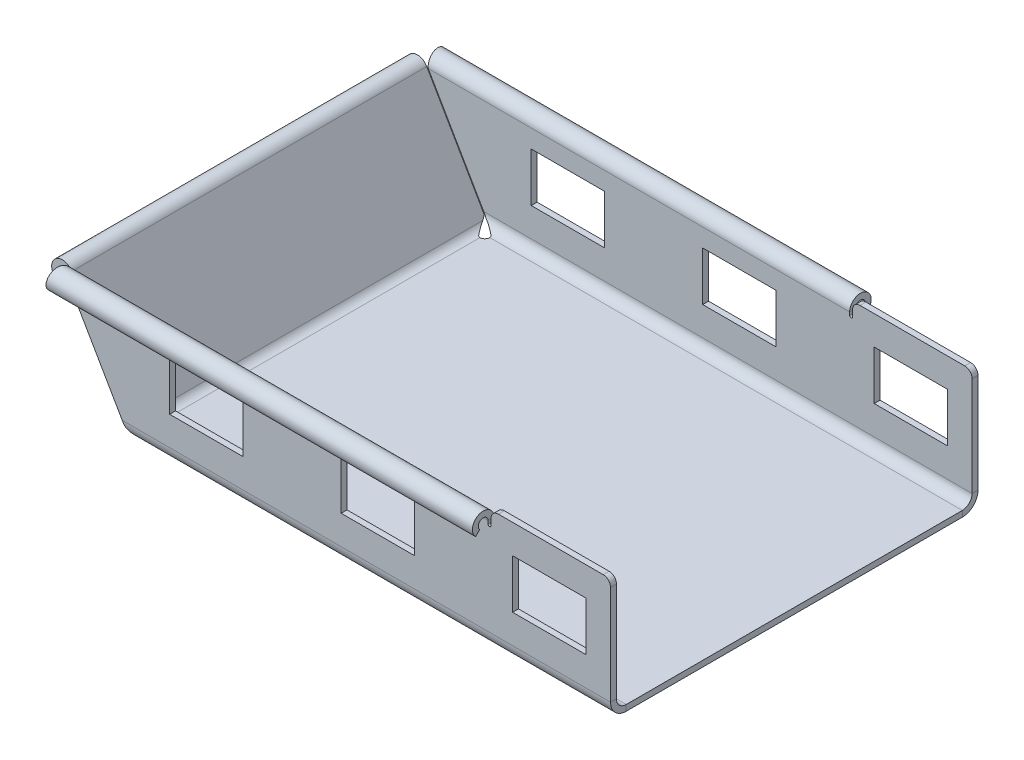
ISO-10303-21;
HEADER;
FILE_DESCRIPTION(('STEP AP214'),'2;1');
FILE_NAME('part.step','',(''),(''),'','','');
FILE_SCHEMA(('AUTOMOTIVE_DESIGN { 1 0 10303 214 1 1 1 1 }'));
ENDSEC;
DATA;
#1=APPLICATION_CONTEXT('core data for automotive mechanical design processes');
#2=APPLICATION_PROTOCOL_DEFINITION('international standard','automotive_design',2000,#1);
#3=PRODUCT_CONTEXT('',#1,'mechanical');
#4=PRODUCT('Part','Part','',(#3));
#5=PRODUCT_RELATED_PRODUCT_CATEGORY('part','',(#4));
#6=PRODUCT_DEFINITION_FORMATION('','',#4);
#7=PRODUCT_DEFINITION_CONTEXT('part definition',#1,'design');
#8=PRODUCT_DEFINITION('design','',#6,#7);
#9=PRODUCT_DEFINITION_SHAPE('','',#8);
#10=(LENGTH_UNIT() NAMED_UNIT(*) SI_UNIT(.MILLI.,.METRE.));
#11=(NAMED_UNIT(*) PLANE_ANGLE_UNIT() SI_UNIT($,.RADIAN.));
#12=(NAMED_UNIT(*) SI_UNIT($,.STERADIAN.) SOLID_ANGLE_UNIT());
#13=UNCERTAINTY_MEASURE_WITH_UNIT(LENGTH_MEASURE(1.E-05),#10,'distance_accuracy_value','');
#14=(GEOMETRIC_REPRESENTATION_CONTEXT(3) GLOBAL_UNCERTAINTY_ASSIGNED_CONTEXT((#13)) GLOBAL_UNIT_ASSIGNED_CONTEXT((#10,
#11,#12)) REPRESENTATION_CONTEXT('',''));
#15=CARTESIAN_POINT('',(0.,0.,0.));
#16=DIRECTION('',(0.,0.,1.));
#17=DIRECTION('',(1.,0.,0.));
#18=AXIS2_PLACEMENT_3D('',#15,#16,#17);
#19=CARTESIAN_POINT('',(-39.9999999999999,19.1,-40.7));
#20=DIRECTION('',(-1.,0.,0.));
#21=DIRECTION('',(0.,0.,1.));
#22=AXIS2_PLACEMENT_3D('',#19,#20,#21);
#23=PLANE('',#22);
#24=DIRECTION('',(0.,1.,0.));
#25=VECTOR('',#24,1.);
#26=CARTESIAN_POINT('',(-39.9999999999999,25.,-37.5));
#27=LINE('',#26,#25);
#28=CARTESIAN_POINT('',(-39.9999999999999,9.09999999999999,-37.5));
#29=VERTEX_POINT('',#28);
#30=CARTESIAN_POINT('',(-39.9999999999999,19.1,-37.5));
#31=VERTEX_POINT('',#30);
#32=EDGE_CURVE('E922',#29,#31,#27,.T.);
#33=ORIENTED_EDGE('',*,*,#32,.T.);
#34=DIRECTION('',(0.,0.,1.));
#35=VECTOR('',#34,1.);
#36=CARTESIAN_POINT('',(-39.9999999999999,19.1,-40.7));
#37=LINE('',#36,#35);
#38=CARTESIAN_POINT('',(-39.9999999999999,19.1,-36.3));
#39=VERTEX_POINT('',#38);
#40=EDGE_CURVE('E893',#31,#39,#37,.T.);
#41=ORIENTED_EDGE('',*,*,#40,.T.);
#42=DIRECTION('',(0.,1.,0.));
#43=VECTOR('',#42,1.);
#44=CARTESIAN_POINT('',(-39.9999999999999,25.,-36.3));
#45=LINE('',#44,#43);
#46=CARTESIAN_POINT('',(-39.9999999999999,9.09999999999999,-36.3));
#47=VERTEX_POINT('',#46);
#48=EDGE_CURVE('E916',#47,#39,#45,.T.);
#49=ORIENTED_EDGE('',*,*,#48,.F.);
#50=DIRECTION('',(0.,0.,1.));
#51=VECTOR('',#50,1.);
#52=CARTESIAN_POINT('',(-39.9999999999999,9.09999999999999,-40.7));
#53=LINE('',#52,#51);
#54=EDGE_CURVE('E905',#29,#47,#53,.T.);
#55=ORIENTED_EDGE('',*,*,#54,.F.);
#56=EDGE_LOOP('',(#33,#41,#49,#55));
#57=FACE_BOUND('',#56,.T.);
#58=ADVANCED_FACE('F148',(#57),#23,.F.);
#59=CARTESIAN_POINT('',(-39.9999999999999,19.1,-40.7));
#60=DIRECTION('',(0.,1.,0.));
#61=DIRECTION('',(0.,0.,1.));
#62=AXIS2_PLACEMENT_3D('',#59,#60,#61);
#63=PLANE('',#62);
#64=DIRECTION('',(1.,0.,0.));
#65=VECTOR('',#64,1.);
#66=CARTESIAN_POINT('',(-20.,19.1,-37.5));
#67=LINE('',#66,#65);
#68=CARTESIAN_POINT('',(-24.9999999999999,19.1,-37.5));
#69=VERTEX_POINT('',#68);
#70=EDGE_CURVE('E925',#31,#69,#67,.T.);
#71=ORIENTED_EDGE('',*,*,#70,.T.);
#72=DIRECTION('',(0.,0.,1.));
#73=VECTOR('',#72,1.);
#74=CARTESIAN_POINT('',(-24.9999999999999,19.1,-40.7));
#75=LINE('',#74,#73);
#76=CARTESIAN_POINT('',(-24.9999999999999,19.1,-36.3));
#77=VERTEX_POINT('',#76);
#78=EDGE_CURVE('E897',#69,#77,#75,.T.);
#79=ORIENTED_EDGE('',*,*,#78,.T.);
#80=DIRECTION('',(1.,0.,0.));
#81=VECTOR('',#80,1.);
#82=CARTESIAN_POINT('',(-20.,19.1,-36.3));
#83=LINE('',#82,#81);
#84=EDGE_CURVE('E913',#39,#77,#83,.T.);
#85=ORIENTED_EDGE('',*,*,#84,.F.);
#86=ORIENTED_EDGE('',*,*,#40,.F.);
#87=EDGE_LOOP('',(#71,#79,#85,#86));
#88=FACE_BOUND('',#87,.T.);
#89=ADVANCED_FACE('F814',(#88),#63,.F.);
#90=CARTESIAN_POINT('',(-24.9999999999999,19.1,-40.7));
#91=DIRECTION('',(1.,0.,0.));
#92=DIRECTION('',(0.,0.,-1.));
#93=AXIS2_PLACEMENT_3D('',#90,#91,#92);
#94=PLANE('',#93);
#95=DIRECTION('',(0.,-1.,0.));
#96=VECTOR('',#95,1.);
#97=CARTESIAN_POINT('',(-24.9999999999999,25.,-37.5));
#98=LINE('',#97,#96);
#99=CARTESIAN_POINT('',(-24.9999999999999,9.09999999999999,-37.5));
#100=VERTEX_POINT('',#99);
#101=EDGE_CURVE('E929',#69,#100,#98,.T.);
#102=ORIENTED_EDGE('',*,*,#101,.T.);
#103=DIRECTION('',(0.,0.,1.));
#104=VECTOR('',#103,1.);
#105=CARTESIAN_POINT('',(-24.9999999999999,9.09999999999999,-40.7));
#106=LINE('',#105,#104);
#107=CARTESIAN_POINT('',(-24.9999999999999,9.09999999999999,-36.3));
#108=VERTEX_POINT('',#107);
#109=EDGE_CURVE('E901',#100,#108,#106,.T.);
#110=ORIENTED_EDGE('',*,*,#109,.T.);
#111=DIRECTION('',(0.,-1.,0.));
#112=VECTOR('',#111,1.);
#113=CARTESIAN_POINT('',(-24.9999999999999,25.,-36.3));
#114=LINE('',#113,#112);
#115=EDGE_CURVE('E909',#77,#108,#114,.T.);
#116=ORIENTED_EDGE('',*,*,#115,.F.);
#117=ORIENTED_EDGE('',*,*,#78,.F.);
#118=EDGE_LOOP('',(#102,#110,#116,#117));
#119=FACE_BOUND('',#118,.T.);
#120=ADVANCED_FACE('F820',(#119),#94,.F.);
#121=CARTESIAN_POINT('',(-39.9999999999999,9.09999999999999,-40.7));
#122=DIRECTION('',(0.,-1.,0.));
#123=DIRECTION('',(0.,0.,-1.));
#124=AXIS2_PLACEMENT_3D('',#121,#122,#123);
#125=PLANE('',#124);
#126=DIRECTION('',(-1.,0.,0.));
#127=VECTOR('',#126,1.);
#128=CARTESIAN_POINT('',(-20.,9.09999999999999,-37.5));
#129=LINE('',#128,#127);
#130=EDGE_CURVE('E933',#100,#29,#129,.T.);
#131=ORIENTED_EDGE('',*,*,#130,.T.);
#132=ORIENTED_EDGE('',*,*,#54,.T.);
#133=DIRECTION('',(-1.,0.,0.));
#134=VECTOR('',#133,1.);
#135=CARTESIAN_POINT('',(-20.,9.09999999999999,-36.3));
#136=LINE('',#135,#134);
#137=EDGE_CURVE('E919',#108,#47,#136,.T.);
#138=ORIENTED_EDGE('',*,*,#137,.F.);
#139=ORIENTED_EDGE('',*,*,#109,.F.);
#140=EDGE_LOOP('',(#131,#132,#138,#139));
#141=FACE_BOUND('',#140,.T.);
#142=ADVANCED_FACE('F1413',(#141),#125,.F.);
#143=CARTESIAN_POINT('',(-39.9999999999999,9.09999999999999,-40.7));
#144=DIRECTION('',(0.,-1.,0.));
#145=DIRECTION('',(0.,0.,-1.));
#146=AXIS2_PLACEMENT_3D('',#143,#144,#145);
#147=PLANE('',#146);
#148=DIRECTION('',(0.,0.,1.));
#149=VECTOR('',#148,1.);
#150=CARTESIAN_POINT('',(-39.9999999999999,9.09999999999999,-40.7));
#151=LINE('',#150,#149);
#152=CARTESIAN_POINT('',(-39.9999999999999,9.09999999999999,36.3));
#153=VERTEX_POINT('',#152);
#154=CARTESIAN_POINT('',(-39.9999999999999,9.09999999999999,37.5));
#155=VERTEX_POINT('',#154);
#156=EDGE_CURVE('E944',#153,#155,#151,.T.);
#157=ORIENTED_EDGE('',*,*,#156,.T.);
#158=DIRECTION('',(1.,0.,0.));
#159=VECTOR('',#158,1.);
#160=CARTESIAN_POINT('',(-39.9999999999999,9.09999999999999,37.5));
#161=LINE('',#160,#159);
#162=CARTESIAN_POINT('',(-24.9999999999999,9.09999999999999,37.5));
#163=VERTEX_POINT('',#162);
#164=EDGE_CURVE('E965',#155,#163,#161,.T.);
#165=ORIENTED_EDGE('',*,*,#164,.T.);
#166=DIRECTION('',(0.,0.,1.));
#167=VECTOR('',#166,1.);
#168=CARTESIAN_POINT('',(-24.9999999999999,9.09999999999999,-40.7));
#169=LINE('',#168,#167);
#170=CARTESIAN_POINT('',(-24.9999999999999,9.09999999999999,36.3));
#171=VERTEX_POINT('',#170);
#172=EDGE_CURVE('E936',#171,#163,#169,.T.);
#173=ORIENTED_EDGE('',*,*,#172,.F.);
#174=DIRECTION('',(1.,0.,0.));
#175=VECTOR('',#174,1.);
#176=CARTESIAN_POINT('',(-19.9999999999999,9.09999999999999,36.3));
#177=LINE('',#176,#175);
#178=EDGE_CURVE('E959',#153,#171,#177,.T.);
#179=ORIENTED_EDGE('',*,*,#178,.F.);
#180=EDGE_LOOP('',(#157,#165,#173,#179));
#181=FACE_BOUND('',#180,.T.);
#182=ADVANCED_FACE('F2963',(#181),#147,.F.);
#183=CARTESIAN_POINT('',(-24.9999999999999,19.1,-40.7));
#184=DIRECTION('',(1.,0.,0.));
#185=DIRECTION('',(0.,0.,-1.));
#186=AXIS2_PLACEMENT_3D('',#183,#184,#185);
#187=PLANE('',#186);
#188=ORIENTED_EDGE('',*,*,#172,.T.);
#189=DIRECTION('',(0.,1.,0.));
#190=VECTOR('',#189,1.);
#191=CARTESIAN_POINT('',(-24.9999999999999,19.1,37.5));
#192=LINE('',#191,#190);
#193=CARTESIAN_POINT('',(-24.9999999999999,19.1,37.5));
#194=VERTEX_POINT('',#193);
#195=EDGE_CURVE('E969',#163,#194,#192,.T.);
#196=ORIENTED_EDGE('',*,*,#195,.T.);
#197=DIRECTION('',(0.,0.,1.));
#198=VECTOR('',#197,1.);
#199=CARTESIAN_POINT('',(-24.9999999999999,19.1,-40.7));
#200=LINE('',#199,#198);
#201=CARTESIAN_POINT('',(-24.9999999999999,19.1,36.3));
#202=VERTEX_POINT('',#201);
#203=EDGE_CURVE('E940',#202,#194,#200,.T.);
#204=ORIENTED_EDGE('',*,*,#203,.F.);
#205=DIRECTION('',(0.,1.,0.));
#206=VECTOR('',#205,1.);
#207=CARTESIAN_POINT('',(-24.9999999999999,25.,36.3));
#208=LINE('',#207,#206);
#209=EDGE_CURVE('E956',#171,#202,#208,.T.);
#210=ORIENTED_EDGE('',*,*,#209,.F.);
#211=EDGE_LOOP('',(#188,#196,#204,#210));
#212=FACE_BOUND('',#211,.T.);
#213=ADVANCED_FACE('F2951',(#212),#187,.F.);
#214=CARTESIAN_POINT('',(-39.9999999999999,19.1,-40.7));
#215=DIRECTION('',(0.,1.,0.));
#216=DIRECTION('',(0.,0.,1.));
#217=AXIS2_PLACEMENT_3D('',#214,#215,#216);
#218=PLANE('',#217);
#219=ORIENTED_EDGE('',*,*,#203,.T.);
#220=DIRECTION('',(-1.,0.,0.));
#221=VECTOR('',#220,1.);
#222=CARTESIAN_POINT('',(-39.9999999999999,19.1,37.5));
#223=LINE('',#222,#221);
#224=CARTESIAN_POINT('',(-39.9999999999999,19.1,37.5));
#225=VERTEX_POINT('',#224);
#226=EDGE_CURVE('E973',#194,#225,#223,.T.);
#227=ORIENTED_EDGE('',*,*,#226,.T.);
#228=DIRECTION('',(0.,0.,1.));
#229=VECTOR('',#228,1.);
#230=CARTESIAN_POINT('',(-39.9999999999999,19.1,-40.7));
#231=LINE('',#230,#229);
#232=CARTESIAN_POINT('',(-39.9999999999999,19.1,36.3));
#233=VERTEX_POINT('',#232);
#234=EDGE_CURVE('E948',#233,#225,#231,.T.);
#235=ORIENTED_EDGE('',*,*,#234,.F.);
#236=DIRECTION('',(-1.,0.,0.));
#237=VECTOR('',#236,1.);
#238=CARTESIAN_POINT('',(-19.9999999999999,19.1,36.3));
#239=LINE('',#238,#237);
#240=EDGE_CURVE('E952',#202,#233,#239,.T.);
#241=ORIENTED_EDGE('',*,*,#240,.F.);
#242=EDGE_LOOP('',(#219,#227,#235,#241));
#243=FACE_BOUND('',#242,.T.);
#244=ADVANCED_FACE('F2939',(#243),#218,.F.);
#245=CARTESIAN_POINT('',(-39.9999999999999,19.1,-40.7));
#246=DIRECTION('',(-1.,0.,0.));
#247=DIRECTION('',(0.,0.,1.));
#248=AXIS2_PLACEMENT_3D('',#245,#246,#247);
#249=PLANE('',#248);
#250=ORIENTED_EDGE('',*,*,#234,.T.);
#251=DIRECTION('',(0.,-1.,0.));
#252=VECTOR('',#251,1.);
#253=CARTESIAN_POINT('',(-39.9999999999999,19.1,37.5));
#254=LINE('',#253,#252);
#255=EDGE_CURVE('E977',#225,#155,#254,.T.);
#256=ORIENTED_EDGE('',*,*,#255,.T.);
#257=ORIENTED_EDGE('',*,*,#156,.F.);
#258=DIRECTION('',(0.,-1.,0.));
#259=VECTOR('',#258,1.);
#260=CARTESIAN_POINT('',(-39.9999999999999,25.,36.3));
#261=LINE('',#260,#259);
#262=EDGE_CURVE('E962',#233,#153,#261,.T.);
#263=ORIENTED_EDGE('',*,*,#262,.F.);
#264=EDGE_LOOP('',(#250,#256,#257,#263));
#265=FACE_BOUND('',#264,.T.);
#266=ADVANCED_FACE('F2444',(#265),#249,.F.);
#267=CARTESIAN_POINT('',(50.,25.,-36.3));
#268=DIRECTION('',(0.,1.,0.));
#269=DIRECTION('',(0.,0.,1.));
#270=AXIS2_PLACEMENT_3D('',#267,#268,#269);
#271=PLANE('',#270);
#272=DIRECTION('',(-1.,0.,0.));
#273=VECTOR('',#272,1.);
#274=CARTESIAN_POINT('',(50.,25.,-37.5));
#275=LINE('',#274,#273);
#276=CARTESIAN_POINT('',(48.5,25.,-37.5));
#277=VERTEX_POINT('',#276);
#278=CARTESIAN_POINT('',(27.1,25.,-37.5));
#279=VERTEX_POINT('',#278);
#280=EDGE_CURVE('E1058',#277,#279,#275,.T.);
#281=ORIENTED_EDGE('',*,*,#280,.T.);
#282=DIRECTION('',(0.,0.,1.));
#283=VECTOR('',#282,1.);
#284=CARTESIAN_POINT('',(27.1,25.,-36.3));
#285=LINE('',#284,#283);
#286=CARTESIAN_POINT('',(27.1,25.,-36.3));
#287=VERTEX_POINT('',#286);
#288=EDGE_CURVE('E885',#279,#287,#285,.T.);
#289=ORIENTED_EDGE('',*,*,#288,.T.);
#290=DIRECTION('',(-1.,0.,0.));
#291=VECTOR('',#290,1.);
#292=CARTESIAN_POINT('',(50.,25.,-36.3));
#293=LINE('',#292,#291);
#294=CARTESIAN_POINT('',(48.5,25.,-36.3));
#295=VERTEX_POINT('',#294);
#296=EDGE_CURVE('E1014',#295,#287,#293,.T.);
#297=ORIENTED_EDGE('',*,*,#296,.F.);
#298=DIRECTION('',(0.,0.,-1.));
#299=VECTOR('',#298,1.);
#300=CARTESIAN_POINT('',(48.5,25.,-37.5));
#301=LINE('',#300,#299);
#302=EDGE_CURVE('E889',#295,#277,#301,.T.);
#303=ORIENTED_EDGE('',*,*,#302,.T.);
#304=EDGE_LOOP('',(#281,#289,#297,#303));
#305=FACE_BOUND('',#304,.T.);
#306=ADVANCED_FACE('F2440',(#305),#271,.T.);
#307=CARTESIAN_POINT('',(1.4868997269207,-85.4365048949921,-37.5));
#308=DIRECTION('',(0.866025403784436,0.500000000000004,0.));
#309=DIRECTION('',(-0.480384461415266,0.832050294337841,0.277350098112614));
#310=AXIS2_PLACEMENT_3D('',#307,#308,#309);
#311=PLANE('',#310);
#312=DIRECTION('',(0.,0.,1.));
#313=VECTOR('',#312,1.);
#314=CARTESIAN_POINT('',(-61.003475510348,22.8,-37.5));
#315=LINE('',#314,#313);
#316=CARTESIAN_POINT('',(-61.003475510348,22.8,-37.5));
#317=VERTEX_POINT('',#316);
#318=CARTESIAN_POINT('',(-61.003475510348,22.8,-36.3));
#319=VERTEX_POINT('',#318);
#320=EDGE_CURVE('E768',#317,#319,#315,.T.);
#321=ORIENTED_EDGE('',*,*,#320,.F.);
#322=DIRECTION('',(-0.500000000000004,0.866025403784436,0.));
#323=VECTOR('',#322,1.);
#324=CARTESIAN_POINT('',(1.4868997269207,-85.4365048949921,-37.5));
#325=LINE('',#324,#323);
#326=CARTESIAN_POINT('',(-49.6874102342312,3.2,-37.5));
#327=VERTEX_POINT('',#326);
#328=EDGE_CURVE('E1052',#327,#317,#325,.T.);
#329=ORIENTED_EDGE('',*,*,#328,.F.);
#330=CARTESIAN_POINT('',(-49.6874102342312,3.20000000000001,-36.3));
#331=CARTESIAN_POINT('',(-49.6874102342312,3.20000000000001,-37.5));
#332=B_SPLINE_CURVE_WITH_KNOTS('',1,(#330,#331),.UNSPECIFIED.,.F.,.F.,(2,2),(0.,1.),.UNSPECIFIED.);
#333=CARTESIAN_POINT('',(-49.6874102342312,3.2,-36.3));
#334=VERTEX_POINT('',#333);
#335=EDGE_CURVE('E1814',#327,#334,#332,.F.);
#336=ORIENTED_EDGE('',*,*,#335,.T.);
#337=DIRECTION('',(0.500000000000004,-0.866025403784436,0.));
#338=VECTOR('',#337,1.);
#339=CARTESIAN_POINT('',(-34.2052345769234,-23.6159148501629,-36.3));
#340=LINE('',#339,#338);
#341=EDGE_CURVE('E1009',#319,#334,#340,.T.);
#342=ORIENTED_EDGE('',*,*,#341,.F.);
#343=EDGE_LOOP('',(#321,#329,#336,#342));
#344=FACE_BOUND('',#343,.T.);
#345=ADVANCED_FACE('F1429',(#344),#311,.F.);
#346=CARTESIAN_POINT('',(-50.2309401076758,1.59999999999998,-36.2292893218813));
#347=DIRECTION('',(0.,0.,-1.));
#348=DIRECTION('',(-1.,0.,0.));
#349=AXIS2_PLACEMENT_3D('',#346,#347,#348);
#350=PLANE('',#349);
#351=DIRECTION('',(-0.500000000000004,0.866025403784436,0.));
#352=VECTOR('',#351,1.);
#353=CARTESIAN_POINT('',(-50.2309401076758,1.59999999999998,-36.2292893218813));
#354=LINE('',#353,#352);
#355=CARTESIAN_POINT('',(-50.5413347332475,2.13761926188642,-36.2292893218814));
#356=VERTEX_POINT('',#355);
#357=CARTESIAN_POINT('',(-62.2945262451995,22.4947441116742,-36.2292893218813));
#358=VERTEX_POINT('',#357);
#359=EDGE_CURVE('E1067',#356,#358,#354,.T.);
#360=ORIENTED_EDGE('',*,*,#359,.T.);
#361=DIRECTION('',(0.866025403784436,0.500000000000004,0.));
#362=VECTOR('',#361,1.);
#363=CARTESIAN_POINT('',(-62.2945262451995,22.4947441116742,-36.2292893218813));
#364=LINE('',#363,#362);
#365=CARTESIAN_POINT('',(-61.2552957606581,23.0947441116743,-36.2292893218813));
#366=VERTEX_POINT('',#365);
#367=EDGE_CURVE('E1180',#358,#366,#364,.T.);
#368=ORIENTED_EDGE('',*,*,#367,.T.);
#369=DIRECTION('',(-0.500000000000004,0.866025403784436,0.));
#370=VECTOR('',#369,1.);
#371=CARTESIAN_POINT('',(-49.1917096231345,2.19999999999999,-36.2292893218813));
#372=LINE('',#371,#370);
#373=CARTESIAN_POINT('',(-49.5021042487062,2.73761926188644,-36.2292893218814));
#374=VERTEX_POINT('',#373);
#375=EDGE_CURVE('E1101',#374,#366,#372,.T.);
#376=ORIENTED_EDGE('',*,*,#375,.F.);
#377=DIRECTION('',(0.866025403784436,0.500000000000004,0.));
#378=VECTOR('',#377,1.);
#379=CARTESIAN_POINT('',(-50.5413347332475,2.13761926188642,-36.2292893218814));
#380=LINE('',#379,#378);
#381=EDGE_CURVE('E1686',#356,#374,#380,.T.);
#382=ORIENTED_EDGE('',*,*,#381,.F.);
#383=EDGE_LOOP('',(#360,#368,#376,#382));
#384=FACE_BOUND('',#383,.T.);
#385=ADVANCED_FACE('F2014',(#384),#350,.T.);
#386=CARTESIAN_POINT('',(50.0000000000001,25.,37.5));
#387=DIRECTION('',(0.,1.,0.));
#388=DIRECTION('',(0.,0.,1.));
#389=AXIS2_PLACEMENT_3D('',#386,#387,#388);
#390=PLANE('',#389);
#391=DIRECTION('',(-1.,0.,0.));
#392=VECTOR('',#391,1.);
#393=CARTESIAN_POINT('',(50.0000000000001,25.,36.3));
#394=LINE('',#393,#392);
#395=CARTESIAN_POINT('',(48.5000000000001,25.,36.3));
#396=VERTEX_POINT('',#395);
#397=CARTESIAN_POINT('',(27.1000000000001,25.,36.3));
#398=VERTEX_POINT('',#397);
#399=EDGE_CURVE('E1100',#396,#398,#394,.T.);
#400=ORIENTED_EDGE('',*,*,#399,.T.);
#401=DIRECTION('',(0.,0.,-1.));
#402=VECTOR('',#401,1.);
#403=CARTESIAN_POINT('',(27.1000000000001,25.,37.5));
#404=LINE('',#403,#402);
#405=CARTESIAN_POINT('',(27.1000000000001,25.,37.5));
#406=VERTEX_POINT('',#405);
#407=EDGE_CURVE('E170',#398,#406,#404,.F.);
#408=ORIENTED_EDGE('',*,*,#407,.T.);
#409=DIRECTION('',(-1.,0.,0.));
#410=VECTOR('',#409,1.);
#411=CARTESIAN_POINT('',(50.0000000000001,25.,37.5));
#412=LINE('',#411,#410);
#413=CARTESIAN_POINT('',(48.5000000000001,25.,37.5));
#414=VERTEX_POINT('',#413);
#415=EDGE_CURVE('E2398',#414,#406,#412,.T.);
#416=ORIENTED_EDGE('',*,*,#415,.F.);
#417=DIRECTION('',(0.,0.,-1.));
#418=VECTOR('',#417,1.);
#419=CARTESIAN_POINT('',(48.5000000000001,25.,37.5));
#420=LINE('',#419,#418);
#421=EDGE_CURVE('E855',#414,#396,#420,.T.);
#422=ORIENTED_EDGE('',*,*,#421,.T.);
#423=EDGE_LOOP('',(#400,#408,#416,#422));
#424=FACE_BOUND('',#423,.T.);
#425=ADVANCED_FACE('F2415',(#424),#390,.T.);
#426=CARTESIAN_POINT('',(1.48689972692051,-85.4365048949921,37.5));
#427=DIRECTION('',(-0.866025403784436,-0.500000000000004,0.));
#428=DIRECTION('',(-0.480384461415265,0.832050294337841,-0.277350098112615));
#429=AXIS2_PLACEMENT_3D('',#426,#427,#428);
#430=PLANE('',#429);
#431=DIRECTION('',(-0.500000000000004,0.866025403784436,0.));
#432=VECTOR('',#431,1.);
#433=CARTESIAN_POINT('',(1.48689972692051,-85.4365048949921,37.5));
#434=LINE('',#433,#432);
#435=CARTESIAN_POINT('',(-49.6874102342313,3.19999999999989,37.5));
#436=VERTEX_POINT('',#435);
#437=CARTESIAN_POINT('',(-61.0034755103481,22.8,37.5));
#438=VERTEX_POINT('',#437);
#439=EDGE_CURVE('E1082',#436,#438,#434,.T.);
#440=ORIENTED_EDGE('',*,*,#439,.T.);
#441=DIRECTION('',(0.,0.,-1.));
#442=VECTOR('',#441,1.);
#443=CARTESIAN_POINT('',(-61.0034755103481,22.8,37.5));
#444=LINE('',#443,#442);
#445=CARTESIAN_POINT('',(-61.0034755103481,22.8,36.3));
#446=VERTEX_POINT('',#445);
#447=EDGE_CURVE('E1161',#438,#446,#444,.T.);
#448=ORIENTED_EDGE('',*,*,#447,.T.);
#449=DIRECTION('',(0.500000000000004,-0.866025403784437,0.));
#450=VECTOR('',#449,1.);
#451=CARTESIAN_POINT('',(-34.2052345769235,-23.6159148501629,36.3));
#452=LINE('',#451,#450);
#453=CARTESIAN_POINT('',(-49.6874102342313,3.19999999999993,36.3));
#454=VERTEX_POINT('',#453);
#455=EDGE_CURVE('E1088',#446,#454,#452,.T.);
#456=ORIENTED_EDGE('',*,*,#455,.T.);
#457=CARTESIAN_POINT('',(-49.6874102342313,3.19999999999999,37.5));
#458=CARTESIAN_POINT('',(-49.6874102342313,3.19999999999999,36.3));
#459=B_SPLINE_CURVE_WITH_KNOTS('',1,(#457,#458),.UNSPECIFIED.,.F.,.F.,(2,2),(0.,1.),.UNSPECIFIED.);
#460=EDGE_CURVE('E2206',#436,#454,#459,.T.);
#461=ORIENTED_EDGE('',*,*,#460,.F.);
#462=EDGE_LOOP('',(#440,#448,#456,#461));
#463=FACE_BOUND('',#462,.T.);
#464=ADVANCED_FACE('F2305',(#463),#430,.T.);
#465=CARTESIAN_POINT('',(50.0000000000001,0.,37.5));
#466=DIRECTION('',(0.,-1.,0.));
#467=DIRECTION('',(0.,0.,-1.));
#468=AXIS2_PLACEMENT_3D('',#465,#466,#467);
#469=PLANE('',#468);
#470=DIRECTION('',(0.,0.,-1.));
#471=VECTOR('',#470,1.);
#472=CARTESIAN_POINT('',(-47.4596588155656,0.,34.3));
#473=LINE('',#472,#471);
#474=CARTESIAN_POINT('',(-47.4596588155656,0.,33.3));
#475=VERTEX_POINT('',#474);
#476=CARTESIAN_POINT('',(-47.4596588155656,0.,-33.3));
#477=VERTEX_POINT('',#476);
#478=EDGE_CURVE('E1026',#475,#477,#473,.T.);
#479=ORIENTED_EDGE('',*,*,#478,.T.);
#480=CARTESIAN_POINT('',(-47.4596588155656,0.,-34.3));
#481=DIRECTION('',(0.,-1.,0.));
#482=DIRECTION('',(0.,0.,-1.));
#483=AXIS2_PLACEMENT_3D('',#480,#481,#482);
#484=CIRCLE('',#483,0.999999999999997);
#485=CARTESIAN_POINT('',(-46.4596588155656,0.,-34.3));
#486=VERTEX_POINT('',#485);
#487=EDGE_CURVE('E1706',#486,#477,#484,.T.);
#488=ORIENTED_EDGE('',*,*,#487,.F.);
#489=DIRECTION('',(-1.,0.,0.));
#490=VECTOR('',#489,1.);
#491=CARTESIAN_POINT('',(50.0000000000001,0.,-34.3));
#492=LINE('',#491,#490);
#493=CARTESIAN_POINT('',(50.,0.,-34.3));
#494=VERTEX_POINT('',#493);
#495=EDGE_CURVE('E1025',#494,#486,#492,.T.);
#496=ORIENTED_EDGE('',*,*,#495,.F.);
#497=DIRECTION('',(0.,0.,1.));
#498=VECTOR('',#497,1.);
#499=CARTESIAN_POINT('',(50.0000000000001,0.,37.5));
#500=LINE('',#499,#498);
#501=CARTESIAN_POINT('',(50.0000000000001,0.,34.3));
#502=VERTEX_POINT('',#501);
#503=EDGE_CURVE('E2388',#494,#502,#500,.T.);
#504=ORIENTED_EDGE('',*,*,#503,.T.);
#505=DIRECTION('',(-1.,0.,0.));
#506=VECTOR('',#505,1.);
#507=CARTESIAN_POINT('',(50.0000000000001,0.,34.3));
#508=LINE('',#507,#506);
#509=CARTESIAN_POINT('',(-46.4596588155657,0.,34.3));
#510=VERTEX_POINT('',#509);
#511=EDGE_CURVE('E2169',#502,#510,#508,.T.);
#512=ORIENTED_EDGE('',*,*,#511,.T.);
#513=CARTESIAN_POINT('',(-47.4596588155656,0.,34.3));
#514=DIRECTION('',(0.,1.,0.));
#515=DIRECTION('',(0.,0.,1.));
#516=AXIS2_PLACEMENT_3D('',#513,#514,#515);
#517=CIRCLE('',#516,0.999999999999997);
#518=EDGE_CURVE('E1884',#510,#475,#517,.T.);
#519=ORIENTED_EDGE('',*,*,#518,.T.);
#520=EDGE_LOOP('',(#479,#488,#496,#504,#512,#519));
#521=FACE_BOUND('',#520,.T.);
#522=ADVANCED_FACE('F2167',(#521),#469,.T.);
#523=CARTESIAN_POINT('',(50.,1.20000000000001,37.5));
#524=DIRECTION('',(0.,-1.,0.));
#525=DIRECTION('',(0.,0.,-1.));
#526=AXIS2_PLACEMENT_3D('',#523,#524,#525);
#527=PLANE('',#526);
#528=DIRECTION('',(-1.,0.,0.));
#529=VECTOR('',#528,1.);
#530=CARTESIAN_POINT('',(50.,1.20000000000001,-34.3));
#531=LINE('',#530,#529);
#532=CARTESIAN_POINT('',(50.,1.20000000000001,-34.3));
#533=VERTEX_POINT('',#532);
#534=CARTESIAN_POINT('',(-46.4596588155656,1.20000000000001,-34.3));
#535=VERTEX_POINT('',#534);
#536=EDGE_CURVE('E1035',#533,#535,#531,.T.);
#537=ORIENTED_EDGE('',*,*,#536,.T.);
#538=CARTESIAN_POINT('',(-47.4596588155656,1.20000000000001,-34.3));
#539=DIRECTION('',(0.,-1.,0.));
#540=DIRECTION('',(0.,0.,-1.));
#541=AXIS2_PLACEMENT_3D('',#538,#539,#540);
#542=CIRCLE('',#541,0.999999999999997);
#543=CARTESIAN_POINT('',(-47.4596588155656,1.2,-33.3));
#544=VERTEX_POINT('',#543);
#545=EDGE_CURVE('E1694',#535,#544,#542,.T.);
#546=ORIENTED_EDGE('',*,*,#545,.T.);
#547=DIRECTION('',(0.,0.,-1.));
#548=VECTOR('',#547,1.);
#549=CARTESIAN_POINT('',(-47.4596588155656,1.20000000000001,34.3));
#550=LINE('',#549,#548);
#551=CARTESIAN_POINT('',(-47.4596588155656,1.2,33.3));
#552=VERTEX_POINT('',#551);
#553=EDGE_CURVE('E1021',#552,#544,#550,.T.);
#554=ORIENTED_EDGE('',*,*,#553,.F.);
#555=CARTESIAN_POINT('',(-47.4596588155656,1.20000000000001,34.3));
#556=DIRECTION('',(0.,1.,0.));
#557=DIRECTION('',(0.,0.,1.));
#558=AXIS2_PLACEMENT_3D('',#555,#556,#557);
#559=CIRCLE('',#558,0.999999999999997);
#560=CARTESIAN_POINT('',(-46.4596588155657,1.19999999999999,34.3));
#561=VERTEX_POINT('',#560);
#562=EDGE_CURVE('E2164',#561,#552,#559,.T.);
#563=ORIENTED_EDGE('',*,*,#562,.F.);
#564=DIRECTION('',(-1.,0.,0.));
#565=VECTOR('',#564,1.);
#566=CARTESIAN_POINT('',(50.,1.20000000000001,34.3));
#567=LINE('',#566,#565);
#568=CARTESIAN_POINT('',(50.,1.20000000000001,34.3));
#569=VERTEX_POINT('',#568);
#570=EDGE_CURVE('E2371',#569,#561,#567,.T.);
#571=ORIENTED_EDGE('',*,*,#570,.F.);
#572=DIRECTION('',(0.,0.,-1.));
#573=VECTOR('',#572,1.);
#574=CARTESIAN_POINT('',(50.,1.20000000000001,37.5));
#575=LINE('',#574,#573);
#576=EDGE_CURVE('E2373',#533,#569,#575,.F.);
#577=ORIENTED_EDGE('',*,*,#576,.F.);
#578=EDGE_LOOP('',(#537,#546,#554,#563,#571,#577));
#579=FACE_BOUND('',#578,.T.);
#580=ADVANCED_FACE('F2368',(#579),#527,.F.);
#581=CARTESIAN_POINT('',(50.,3.20000000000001,-36.3));
#582=DIRECTION('',(1.,0.,0.));
#583=DIRECTION('',(0.,0.,-1.));
#584=AXIS2_PLACEMENT_3D('',#581,#582,#583);
#585=PLANE('',#584);
#586=ORIENTED_EDGE('',*,*,#503,.F.);
#587=DIRECTION('',(0.,1.,0.));
#588=VECTOR('',#587,1.);
#589=CARTESIAN_POINT('',(50.0000000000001,0.,-34.3));
#590=LINE('',#589,#588);
#591=EDGE_CURVE('E1040',#494,#533,#590,.T.);
#592=ORIENTED_EDGE('',*,*,#591,.T.);
#593=ORIENTED_EDGE('',*,*,#576,.T.);
#594=DIRECTION('',(0.,-1.,0.));
#595=VECTOR('',#594,1.);
#596=CARTESIAN_POINT('',(50.,1.20000000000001,34.3));
#597=LINE('',#596,#595);
#598=EDGE_CURVE('E2375',#569,#502,#597,.T.);
#599=ORIENTED_EDGE('',*,*,#598,.T.);
#600=EDGE_LOOP('',(#586,#592,#593,#599));
#601=FACE_BOUND('',#600,.T.);
#602=ADVANCED_FACE('F3373',(#601),#585,.T.);
#603=CARTESIAN_POINT('',(50.,3.2,34.3));
#604=DIRECTION('',(1.,0.,0.));
#605=DIRECTION('',(0.,0.,-1.));
#606=AXIS2_PLACEMENT_3D('',#603,#604,#605);
#607=PLANE('',#606);
#608=CARTESIAN_POINT('',(50.,3.2,34.3));
#609=DIRECTION('',(-1.,0.,0.));
#610=DIRECTION('',(0.,0.,1.));
#611=AXIS2_PLACEMENT_3D('',#608,#609,#610);
#612=CIRCLE('',#611,2.);
#613=CARTESIAN_POINT('',(50.,3.19999999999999,36.3));
#614=VERTEX_POINT('',#613);
#615=EDGE_CURVE('E1087',#569,#614,#612,.T.);
#616=ORIENTED_EDGE('',*,*,#615,.T.);
#617=DIRECTION('',(0.,0.,-1.));
#618=VECTOR('',#617,1.);
#619=CARTESIAN_POINT('',(50.,3.19999999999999,37.5));
#620=LINE('',#619,#618);
#621=CARTESIAN_POINT('',(50.0000000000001,3.19999999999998,37.5));
#622=VERTEX_POINT('',#621);
#623=EDGE_CURVE('E2403',#622,#614,#620,.T.);
#624=ORIENTED_EDGE('',*,*,#623,.F.);
#625=CARTESIAN_POINT('',(50.,3.2,34.3));
#626=DIRECTION('',(-1.,0.,0.));
#627=DIRECTION('',(0.,0.,1.));
#628=AXIS2_PLACEMENT_3D('',#625,#626,#627);
#629=CIRCLE('',#628,3.2);
#630=EDGE_CURVE('E2391',#502,#622,#629,.T.);
#631=ORIENTED_EDGE('',*,*,#630,.F.);
#632=ORIENTED_EDGE('',*,*,#598,.F.);
#633=EDGE_LOOP('',(#616,#624,#631,#632));
#634=FACE_BOUND('',#633,.T.);
#635=ADVANCED_FACE('F2304',(#634),#607,.T.);
#636=CARTESIAN_POINT('',(101.048421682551,3.19999999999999,34.3));
#637=DIRECTION('',(-1.,0.,0.));
#638=DIRECTION('',(0.,0.,1.));
#639=AXIS2_PLACEMENT_3D('',#636,#637,#638);
#640=CYLINDRICAL_SURFACE('',#639,3.2);
#641=DIRECTION('',(-1.,0.,0.));
#642=VECTOR('',#641,1.);
#643=CARTESIAN_POINT('',(50.,3.19999999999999,37.5));
#644=LINE('',#643,#642);
#645=EDGE_CURVE('E1096',#622,#436,#644,.T.);
#646=ORIENTED_EDGE('',*,*,#645,.T.);
#647=CARTESIAN_POINT('',(-49.0834829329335,1.9470258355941,37.2444958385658));
#648=CARTESIAN_POINT('',(-49.2849019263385,2.3421182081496,37.4126198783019));
#649=CARTESIAN_POINT('',(-49.4859912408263,2.77062408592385,37.5));
#650=CARTESIAN_POINT('',(-49.6874102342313,3.19999999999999,37.5));
#651=B_SPLINE_CURVE_WITH_KNOTS('',3,(#647,#648,#649,#650),.UNSPECIFIED.,.F.,.F.,(4,4),(0.,1.),.UNSPECIFIED.);
#652=CARTESIAN_POINT('',(-49.0834817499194,1.94702449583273,37.2444952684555));
#653=VERTEX_POINT('',#652);
#654=EDGE_CURVE('E2171',#436,#653,#651,.F.);
#655=ORIENTED_EDGE('',*,*,#654,.T.);
#656=CARTESIAN_POINT('',(-46.7525520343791,0.117615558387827,35.1595965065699));
#657=CARTESIAN_POINT('',(-47.1411117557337,0.246078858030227,35.620246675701));
#658=CARTESIAN_POINT('',(-47.5295286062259,0.479328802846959,36.0511612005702));
#659=CARTESIAN_POINT('',(-48.3065051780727,1.11004247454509,36.7699584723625));
#660=CARTESIAN_POINT('',(-48.6949220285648,1.50698131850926,37.0572430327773));
#661=CARTESIAN_POINT('',(-49.0834817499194,1.94702449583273,37.2444952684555));
#662=B_SPLINE_CURVE_WITH_KNOTS('',3,(#656,#657,#658,#659,#660,#661),.UNSPECIFIED.,.F.,.F.,(4,2,
4),(5.07528578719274E-07,0.500000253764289,1.),.UNSPECIFIED.);
#663=CARTESIAN_POINT('',(-46.7525520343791,0.117615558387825,35.1595965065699));
#664=VERTEX_POINT('',#663);
#665=EDGE_CURVE('E2176',#653,#664,#662,.F.);
#666=ORIENTED_EDGE('',*,*,#665,.T.);
#667=CARTESIAN_POINT('',(-46.4596588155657,0.,34.3));
#668=CARTESIAN_POINT('',(-46.4596588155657,0.,34.4634706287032));
#669=CARTESIAN_POINT('',(-46.4850323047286,0.0125201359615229,34.6203718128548));
#670=CARTESIAN_POINT('',(-46.5865262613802,0.056678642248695,34.9182206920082));
#671=CARTESIAN_POINT('',(-46.6591319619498,0.0867295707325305,35.0488439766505));
#672=CARTESIAN_POINT('',(-46.7525520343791,0.117615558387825,35.1595965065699));
#673=B_SPLINE_CURVE_WITH_KNOTS('',3,(#667,#668,#669,#670,#671,#672),.UNSPECIFIED.,.F.,.F.,(4,2,
4),(0.,0.5,1.),.UNSPECIFIED.);
#674=EDGE_CURVE('E2321',#664,#510,#673,.F.);
#675=ORIENTED_EDGE('',*,*,#674,.T.);
#676=ORIENTED_EDGE('',*,*,#511,.F.);
#677=ORIENTED_EDGE('',*,*,#630,.T.);
#678=EDGE_LOOP('',(#646,#655,#666,#675,#676,#677));
#679=FACE_BOUND('',#678,.T.);
#680=ADVANCED_FACE('F2281',(#679),#640,.T.);
#681=CARTESIAN_POINT('',(101.048421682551,3.19999999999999,34.3));
#682=DIRECTION('',(-1.,0.,0.));
#683=DIRECTION('',(0.,0.,1.));
#684=AXIS2_PLACEMENT_3D('',#681,#682,#683);
#685=CYLINDRICAL_SURFACE('',#684,2.);
#686=ORIENTED_EDGE('',*,*,#570,.T.);
#687=CARTESIAN_POINT('',(-46.7525520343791,1.27350972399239,34.8372478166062));
#688=CARTESIAN_POINT('',(-46.6590891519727,1.25419713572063,34.7679957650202));
#689=CARTESIAN_POINT('',(-46.5865262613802,1.23542415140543,34.6863879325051));
#690=CARTESIAN_POINT('',(-46.4850323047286,1.20782508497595,34.5002323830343));
#691=CARTESIAN_POINT('',(-46.4596588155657,1.19999999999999,34.4021691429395));
#692=CARTESIAN_POINT('',(-46.4596588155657,1.19999999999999,34.3));
#693=B_SPLINE_CURVE_WITH_KNOTS('',3,(#687,#688,#689,#690,#691,#692),.UNSPECIFIED.,.F.,.F.,(4,2,
4),(0.,0.5,1.),.UNSPECIFIED.);
#694=CARTESIAN_POINT('',(-46.7525520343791,1.27350972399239,34.8372478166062));
#695=VERTEX_POINT('',#694);
#696=EDGE_CURVE('E2183',#695,#561,#693,.T.);
#697=ORIENTED_EDGE('',*,*,#696,.F.);
#698=CARTESIAN_POINT('',(-49.0834817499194,2.41689030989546,36.1403095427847));
#699=CARTESIAN_POINT('',(-48.6949493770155,2.14188268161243,36.0232851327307));
#700=CARTESIAN_POINT('',(-48.3065051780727,1.89377654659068,35.8437240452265));
#701=CARTESIAN_POINT('',(-47.5295286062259,1.49958050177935,35.3944757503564));
#702=CARTESIAN_POINT('',(-47.141084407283,1.35379363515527,35.1251339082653));
#703=CARTESIAN_POINT('',(-46.7525520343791,1.27350972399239,34.8372478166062));
#704=B_SPLINE_CURVE_WITH_KNOTS('',3,(#698,#699,#700,#701,#702,#703),.UNSPECIFIED.,.F.,.F.,(4,2,
4),(5.07528578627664E-07,0.500000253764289,1.),.UNSPECIFIED.);
#705=CARTESIAN_POINT('',(-49.0834817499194,2.41689030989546,36.1403095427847));
#706=VERTEX_POINT('',#705);
#707=EDGE_CURVE('E2188',#706,#695,#704,.T.);
#708=ORIENTED_EDGE('',*,*,#707,.F.);
#709=CARTESIAN_POINT('',(-49.6874102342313,3.19999999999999,36.3));
#710=CARTESIAN_POINT('',(-49.4860121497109,2.93166791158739,36.3));
#711=CARTESIAN_POINT('',(-49.2848810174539,2.66379824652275,36.2453765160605));
#712=CARTESIAN_POINT('',(-49.0834829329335,2.41689114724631,36.1403098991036));
#713=B_SPLINE_CURVE_WITH_KNOTS('',3,(#709,#710,#711,#712),.UNSPECIFIED.,.F.,.F.,(4,4),(0.,1.),.UNSPECIFIED.);
#714=EDGE_CURVE('E2192',#454,#706,#713,.T.);
#715=ORIENTED_EDGE('',*,*,#714,.F.);
#716=DIRECTION('',(-1.,0.,0.));
#717=VECTOR('',#716,1.);
#718=CARTESIAN_POINT('',(50.,3.19999999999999,36.3));
#719=LINE('',#718,#717);
#720=EDGE_CURVE('E1106',#614,#454,#719,.T.);
#721=ORIENTED_EDGE('',*,*,#720,.F.);
#722=ORIENTED_EDGE('',*,*,#615,.F.);
#723=EDGE_LOOP('',(#686,#697,#708,#715,#721,#722));
#724=FACE_BOUND('',#723,.T.);
#725=ADVANCED_FACE('F2303',(#724),#685,.F.);
#726=CARTESIAN_POINT('',(50.0000000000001,25.,37.5));
#727=DIRECTION('',(0.,0.,1.));
#728=DIRECTION('',(1.,0.,0.));
#729=AXIS2_PLACEMENT_3D('',#726,#727,#728);
#730=PLANE('',#729);
#731=DIRECTION('',(0.,-1.,0.));
#732=VECTOR('',#731,1.);
#733=CARTESIAN_POINT('',(-4.99999999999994,19.1,37.5));
#734=LINE('',#733,#732);
#735=CARTESIAN_POINT('',(-4.99999999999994,19.1,37.5));
#736=VERTEX_POINT('',#735);
#737=CARTESIAN_POINT('',(-4.99999999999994,9.09999999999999,37.5));
#738=VERTEX_POINT('',#737);
#739=EDGE_CURVE('E665',#736,#738,#734,.T.);
#740=ORIENTED_EDGE('',*,*,#739,.F.);
#741=DIRECTION('',(-1.,0.,0.));
#742=VECTOR('',#741,1.);
#743=CARTESIAN_POINT('',(-4.99999999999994,19.1,37.5));
#744=LINE('',#743,#742);
#745=CARTESIAN_POINT('',(10.0000000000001,19.1,37.5));
#746=VERTEX_POINT('',#745);
#747=EDGE_CURVE('E654',#746,#736,#744,.T.);
#748=ORIENTED_EDGE('',*,*,#747,.F.);
#749=DIRECTION('',(0.,1.,0.));
#750=VECTOR('',#749,1.);
#751=CARTESIAN_POINT('',(10.0000000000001,19.1,37.5));
#752=LINE('',#751,#750);
#753=CARTESIAN_POINT('',(10.0000000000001,9.09999999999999,37.5));
#754=VERTEX_POINT('',#753);
#755=EDGE_CURVE('E643',#754,#746,#752,.T.);
#756=ORIENTED_EDGE('',*,*,#755,.F.);
#757=DIRECTION('',(1.,0.,0.));
#758=VECTOR('',#757,1.);
#759=CARTESIAN_POINT('',(-4.99999999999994,9.09999999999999,37.5));
#760=LINE('',#759,#758);
#761=EDGE_CURVE('E628',#738,#754,#760,.T.);
#762=ORIENTED_EDGE('',*,*,#761,.F.);
#763=EDGE_LOOP('',(#740,#748,#756,#762));
#764=FACE_BOUND('',#763,.T.);
#765=DIRECTION('',(0.,-1.,0.));
#766=VECTOR('',#765,1.);
#767=CARTESIAN_POINT('',(30.0000000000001,19.1,37.5));
#768=LINE('',#767,#766);
#769=CARTESIAN_POINT('',(30.0000000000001,19.1,37.5));
#770=VERTEX_POINT('',#769);
#771=CARTESIAN_POINT('',(30.0000000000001,9.09999999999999,37.5));
#772=VERTEX_POINT('',#771);
#773=EDGE_CURVE('E672',#770,#772,#768,.T.);
#774=ORIENTED_EDGE('',*,*,#773,.F.);
#775=DIRECTION('',(-1.,0.,0.));
#776=VECTOR('',#775,1.);
#777=CARTESIAN_POINT('',(30.0000000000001,19.1,37.5));
#778=LINE('',#777,#776);
#779=CARTESIAN_POINT('',(45.0000000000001,19.1,37.5));
#780=VERTEX_POINT('',#779);
#781=EDGE_CURVE('E683',#780,#770,#778,.T.);
#782=ORIENTED_EDGE('',*,*,#781,.F.);
#783=DIRECTION('',(0.,1.,0.));
#784=VECTOR('',#783,1.);
#785=CARTESIAN_POINT('',(45.0000000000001,19.1,37.5));
#786=LINE('',#785,#784);
#787=CARTESIAN_POINT('',(45.0000000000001,9.09999999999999,37.5));
#788=VERTEX_POINT('',#787);
#789=EDGE_CURVE('E679',#788,#780,#786,.T.);
#790=ORIENTED_EDGE('',*,*,#789,.F.);
#791=DIRECTION('',(1.,0.,0.));
#792=VECTOR('',#791,1.);
#793=CARTESIAN_POINT('',(30.0000000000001,9.09999999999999,37.5));
#794=LINE('',#793,#792);
#795=EDGE_CURVE('E675',#772,#788,#794,.T.);
#796=ORIENTED_EDGE('',*,*,#795,.F.);
#797=EDGE_LOOP('',(#774,#782,#790,#796));
#798=FACE_BOUND('',#797,.T.);
#799=ORIENTED_EDGE('',*,*,#415,.T.);
#800=CARTESIAN_POINT('',(27.1000000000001,23.5,37.5));
#801=DIRECTION('',(0.,0.,1.));
#802=DIRECTION('',(1.,0.,0.));
#803=AXIS2_PLACEMENT_3D('',#800,#801,#802);
#804=CIRCLE('',#803,1.5);
#805=CARTESIAN_POINT('',(25.6000000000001,23.5,37.5));
#806=VERTEX_POINT('',#805);
#807=EDGE_CURVE('E157',#406,#806,#804,.T.);
#808=ORIENTED_EDGE('',*,*,#807,.T.);
#809=DIRECTION('',(0.,1.,0.));
#810=VECTOR('',#809,1.);
#811=CARTESIAN_POINT('',(25.6000000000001,22.2,37.5));
#812=LINE('',#811,#810);
#813=CARTESIAN_POINT('',(25.6000000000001,22.2,37.5));
#814=VERTEX_POINT('',#813);
#815=EDGE_CURVE('E1136',#814,#806,#812,.T.);
#816=ORIENTED_EDGE('',*,*,#815,.F.);
#817=CARTESIAN_POINT('',(25.3000000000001,22.2,37.5));
#818=DIRECTION('',(0.,0.,1.));
#819=DIRECTION('',(1.,0.,0.));
#820=AXIS2_PLACEMENT_3D('',#817,#818,#819);
#821=CIRCLE('',#820,0.3);
#822=CARTESIAN_POINT('',(25.0000000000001,22.2,37.5));
#823=VERTEX_POINT('',#822);
#824=EDGE_CURVE('E1134',#823,#814,#821,.T.);
#825=ORIENTED_EDGE('',*,*,#824,.F.);
#826=DIRECTION('',(0.,-1.,0.));
#827=VECTOR('',#826,1.);
#828=CARTESIAN_POINT('',(25.0000000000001,22.8,37.5));
#829=LINE('',#828,#827);
#830=CARTESIAN_POINT('',(25.0000000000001,22.8,37.5));
#831=VERTEX_POINT('',#830);
#832=EDGE_CURVE('E1200',#831,#823,#829,.T.);
#833=ORIENTED_EDGE('',*,*,#832,.F.);
#834=DIRECTION('',(-1.,0.,0.));
#835=VECTOR('',#834,1.);
#836=CARTESIAN_POINT('',(-62.2736461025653,22.8,37.5));
#837=LINE('',#836,#835);
#838=EDGE_CURVE('E1184',#438,#831,#837,.F.);
#839=ORIENTED_EDGE('',*,*,#838,.F.);
#840=ORIENTED_EDGE('',*,*,#439,.F.);
#841=ORIENTED_EDGE('',*,*,#645,.F.);
#842=DIRECTION('',(0.,1.,0.));
#843=VECTOR('',#842,1.);
#844=CARTESIAN_POINT('',(50.0000000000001,25.,37.5));
#845=LINE('',#844,#843);
#846=CARTESIAN_POINT('',(50.0000000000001,23.5,37.5));
#847=VERTEX_POINT('',#846);
#848=EDGE_CURVE('E2401',#622,#847,#845,.T.);
#849=ORIENTED_EDGE('',*,*,#848,.T.);
#850=CARTESIAN_POINT('',(48.5000000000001,23.5,37.5));
#851=DIRECTION('',(0.,0.,1.));
#852=DIRECTION('',(1.,0.,0.));
#853=AXIS2_PLACEMENT_3D('',#850,#851,#852);
#854=CIRCLE('',#853,1.5);
#855=EDGE_CURVE('E848',#847,#414,#854,.T.);
#856=ORIENTED_EDGE('',*,*,#855,.T.);
#857=EDGE_LOOP('',(#799,#808,#816,#825,#833,#839,#840,#841,#849,#856));
#858=FACE_BOUND('',#857,.T.);
#859=ORIENTED_EDGE('',*,*,#255,.F.);
#860=ORIENTED_EDGE('',*,*,#226,.F.);
#861=ORIENTED_EDGE('',*,*,#195,.F.);
#862=ORIENTED_EDGE('',*,*,#164,.F.);
#863=EDGE_LOOP('',(#859,#860,#861,#862));
#864=FACE_BOUND('',#863,.T.);
#865=ADVANCED_FACE('F2416',(#764,#798,#858,#864),#730,.T.);
#866=CARTESIAN_POINT('',(50.0000000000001,1.19999999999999,34.3));
#867=DIRECTION('',(1.,0.,0.));
#868=DIRECTION('',(0.,0.,-1.));
#869=AXIS2_PLACEMENT_3D('',#866,#867,#868);
#870=PLANE('',#869);
#871=DIRECTION('',(0.,1.,0.));
#872=VECTOR('',#871,1.);
#873=CARTESIAN_POINT('',(50.0000000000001,25.,36.3));
#874=LINE('',#873,#872);
#875=CARTESIAN_POINT('',(50.0000000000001,23.5,36.3));
#876=VERTEX_POINT('',#875);
#877=EDGE_CURVE('E1077',#614,#876,#874,.T.);
#878=ORIENTED_EDGE('',*,*,#877,.T.);
#879=DIRECTION('',(0.,0.,-1.));
#880=VECTOR('',#879,1.);
#881=CARTESIAN_POINT('',(50.0000000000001,23.5,34.3));
#882=LINE('',#881,#880);
#883=EDGE_CURVE('E15',#876,#847,#882,.F.);
#884=ORIENTED_EDGE('',*,*,#883,.T.);
#885=ORIENTED_EDGE('',*,*,#848,.F.);
#886=ORIENTED_EDGE('',*,*,#623,.T.);
#887=EDGE_LOOP('',(#878,#884,#885,#886));
#888=FACE_BOUND('',#887,.T.);
#889=ADVANCED_FACE('F2418',(#888),#870,.T.);
#890=CARTESIAN_POINT('',(50.0000000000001,25.,36.3));
#891=DIRECTION('',(0.,0.,1.));
#892=DIRECTION('',(1.,0.,0.));
#893=AXIS2_PLACEMENT_3D('',#890,#891,#892);
#894=PLANE('',#893);
#895=DIRECTION('',(-1.,0.,0.));
#896=VECTOR('',#895,1.);
#897=CARTESIAN_POINT('',(15.0000000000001,19.1,36.3));
#898=LINE('',#897,#896);
#899=CARTESIAN_POINT('',(10.0000000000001,19.1,36.3));
#900=VERTEX_POINT('',#899);
#901=CARTESIAN_POINT('',(-4.99999999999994,19.1,36.3));
#902=VERTEX_POINT('',#901);
#903=EDGE_CURVE('E661',#900,#902,#898,.T.);
#904=ORIENTED_EDGE('',*,*,#903,.T.);
#905=DIRECTION('',(0.,-1.,0.));
#906=VECTOR('',#905,1.);
#907=CARTESIAN_POINT('',(-4.99999999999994,25.,36.3));
#908=LINE('',#907,#906);
#909=CARTESIAN_POINT('',(-4.99999999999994,9.09999999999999,36.3));
#910=VERTEX_POINT('',#909);
#911=EDGE_CURVE('E668',#902,#910,#908,.T.);
#912=ORIENTED_EDGE('',*,*,#911,.T.);
#913=DIRECTION('',(1.,0.,0.));
#914=VECTOR('',#913,1.);
#915=CARTESIAN_POINT('',(15.0000000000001,9.09999999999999,36.3));
#916=LINE('',#915,#914);
#917=CARTESIAN_POINT('',(10.0000000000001,9.09999999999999,36.3));
#918=VERTEX_POINT('',#917);
#919=EDGE_CURVE('E631',#910,#918,#916,.T.);
#920=ORIENTED_EDGE('',*,*,#919,.T.);
#921=DIRECTION('',(0.,1.,0.));
#922=VECTOR('',#921,1.);
#923=CARTESIAN_POINT('',(10.0000000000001,25.,36.3));
#924=LINE('',#923,#922);
#925=EDGE_CURVE('E650',#918,#900,#924,.T.);
#926=ORIENTED_EDGE('',*,*,#925,.T.);
#927=EDGE_LOOP('',(#904,#912,#920,#926));
#928=FACE_BOUND('',#927,.T.);
#929=DIRECTION('',(-1.,0.,0.));
#930=VECTOR('',#929,1.);
#931=CARTESIAN_POINT('',(50.0000000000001,19.1,36.3));
#932=LINE('',#931,#930);
#933=CARTESIAN_POINT('',(45.0000000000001,19.1,36.3));
#934=VERTEX_POINT('',#933);
#935=CARTESIAN_POINT('',(30.0000000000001,19.1,36.3));
#936=VERTEX_POINT('',#935);
#937=EDGE_CURVE('E722',#934,#936,#932,.T.);
#938=ORIENTED_EDGE('',*,*,#937,.T.);
#939=DIRECTION('',(0.,-1.,0.));
#940=VECTOR('',#939,1.);
#941=CARTESIAN_POINT('',(30.0000000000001,25.,36.3));
#942=LINE('',#941,#940);
#943=CARTESIAN_POINT('',(30.0000000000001,9.09999999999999,36.3));
#944=VERTEX_POINT('',#943);
#945=EDGE_CURVE('E729',#936,#944,#942,.T.);
#946=ORIENTED_EDGE('',*,*,#945,.T.);
#947=DIRECTION('',(1.,0.,0.));
#948=VECTOR('',#947,1.);
#949=CARTESIAN_POINT('',(50.0000000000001,9.09999999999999,36.3));
#950=LINE('',#949,#948);
#951=CARTESIAN_POINT('',(45.0000000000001,9.09999999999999,36.3));
#952=VERTEX_POINT('',#951);
#953=EDGE_CURVE('E707',#944,#952,#950,.T.);
#954=ORIENTED_EDGE('',*,*,#953,.T.);
#955=DIRECTION('',(0.,1.,0.));
#956=VECTOR('',#955,1.);
#957=CARTESIAN_POINT('',(45.0000000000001,25.,36.3));
#958=LINE('',#957,#956);
#959=EDGE_CURVE('E715',#952,#934,#958,.T.);
#960=ORIENTED_EDGE('',*,*,#959,.T.);
#961=EDGE_LOOP('',(#938,#946,#954,#960));
#962=FACE_BOUND('',#961,.T.);
#963=DIRECTION('',(0.,-1.,0.));
#964=VECTOR('',#963,1.);
#965=CARTESIAN_POINT('',(25.6000000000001,25.,36.3));
#966=LINE('',#965,#964);
#967=CARTESIAN_POINT('',(25.6000000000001,23.5,36.3));
#968=VERTEX_POINT('',#967);
#969=CARTESIAN_POINT('',(25.6000000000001,22.2,36.3));
#970=VERTEX_POINT('',#969);
#971=EDGE_CURVE('E1008',#968,#970,#966,.T.);
#972=ORIENTED_EDGE('',*,*,#971,.F.);
#973=CARTESIAN_POINT('',(27.1000000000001,23.5,36.3));
#974=DIRECTION('',(0.,0.,1.));
#975=DIRECTION('',(1.,0.,0.));
#976=AXIS2_PLACEMENT_3D('',#973,#974,#975);
#977=CIRCLE('',#976,1.5);
#978=EDGE_CURVE('E859',#968,#398,#977,.F.);
#979=ORIENTED_EDGE('',*,*,#978,.T.);
#980=ORIENTED_EDGE('',*,*,#399,.F.);
#981=CARTESIAN_POINT('',(48.5000000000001,23.5,36.3));
#982=DIRECTION('',(0.,0.,1.));
#983=DIRECTION('',(1.,0.,0.));
#984=AXIS2_PLACEMENT_3D('',#981,#982,#983);
#985=CIRCLE('',#984,1.5);
#986=EDGE_CURVE('E862',#396,#876,#985,.F.);
#987=ORIENTED_EDGE('',*,*,#986,.T.);
#988=ORIENTED_EDGE('',*,*,#877,.F.);
#989=ORIENTED_EDGE('',*,*,#720,.T.);
#990=ORIENTED_EDGE('',*,*,#455,.F.);
#991=DIRECTION('',(-1.,0.,0.));
#992=VECTOR('',#991,1.);
#993=CARTESIAN_POINT('',(-62.2736461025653,22.8,36.3));
#994=LINE('',#993,#992);
#995=CARTESIAN_POINT('',(25.0000000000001,22.8,36.3));
#996=VERTEX_POINT('',#995);
#997=EDGE_CURVE('E1143',#446,#996,#994,.F.);
#998=ORIENTED_EDGE('',*,*,#997,.T.);
#999=DIRECTION('',(0.,1.,0.));
#1000=VECTOR('',#999,1.);
#1001=CARTESIAN_POINT('',(25.0000000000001,25.,36.3));
#1002=LINE('',#1001,#1000);
#1003=CARTESIAN_POINT('',(25.0000000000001,22.2,36.3));
#1004=VERTEX_POINT('',#1003);
#1005=EDGE_CURVE('E1046',#1004,#996,#1002,.T.);
#1006=ORIENTED_EDGE('',*,*,#1005,.F.);
#1007=CARTESIAN_POINT('',(25.3000000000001,22.2,36.3));
#1008=DIRECTION('',(0.,0.,1.));
#1009=DIRECTION('',(1.,0.,0.));
#1010=AXIS2_PLACEMENT_3D('',#1007,#1008,#1009);
#1011=CIRCLE('',#1010,0.3);
#1012=EDGE_CURVE('E1117',#970,#1004,#1011,.F.);
#1013=ORIENTED_EDGE('',*,*,#1012,.F.);
#1014=EDGE_LOOP('',(#972,#979,#980,#987,#988,#989,#990,#998,#1006,#1013));
#1015=FACE_BOUND('',#1014,.T.);
#1016=ORIENTED_EDGE('',*,*,#262,.T.);
#1017=ORIENTED_EDGE('',*,*,#178,.T.);
#1018=ORIENTED_EDGE('',*,*,#209,.T.);
#1019=ORIENTED_EDGE('',*,*,#240,.T.);
#1020=EDGE_LOOP('',(#1016,#1017,#1018,#1019));
#1021=FACE_BOUND('',#1020,.T.);
#1022=ADVANCED_FACE('F1139',(#928,#962,#1015,#1021),#894,.F.);
#1023=CARTESIAN_POINT('',(-50.2309401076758,1.59999999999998,36.2292893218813));
#1024=DIRECTION('',(0.,0.,-1.));
#1025=DIRECTION('',(-1.,0.,0.));
#1026=AXIS2_PLACEMENT_3D('',#1023,#1024,#1025);
#1027=PLANE('',#1026);
#1028=DIRECTION('',(-0.500000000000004,0.866025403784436,0.));
#1029=VECTOR('',#1028,1.);
#1030=CARTESIAN_POINT('',(-49.1917096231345,2.19999999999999,36.2292893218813));
#1031=LINE('',#1030,#1029);
#1032=CARTESIAN_POINT('',(-49.5021042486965,2.73761926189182,36.2292893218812));
#1033=VERTEX_POINT('',#1032);
#1034=CARTESIAN_POINT('',(-61.2552957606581,23.0947441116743,36.2292893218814));
#1035=VERTEX_POINT('',#1034);
#1036=EDGE_CURVE('E1878',#1033,#1035,#1031,.T.);
#1037=ORIENTED_EDGE('',*,*,#1036,.T.);
#1038=DIRECTION('',(0.866025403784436,0.500000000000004,0.));
#1039=VECTOR('',#1038,1.);
#1040=CARTESIAN_POINT('',(-62.2945262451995,22.4947441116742,36.2292893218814));
#1041=LINE('',#1040,#1039);
#1042=CARTESIAN_POINT('',(-62.2945262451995,22.4947441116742,36.2292893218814));
#1043=VERTEX_POINT('',#1042);
#1044=EDGE_CURVE('E1255',#1043,#1035,#1041,.T.);
#1045=ORIENTED_EDGE('',*,*,#1044,.F.);
#1046=DIRECTION('',(-0.500000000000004,0.866025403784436,0.));
#1047=VECTOR('',#1046,1.);
#1048=CARTESIAN_POINT('',(-50.2309401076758,1.59999999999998,36.2292893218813));
#1049=LINE('',#1048,#1047);
#1050=CARTESIAN_POINT('',(-50.5413347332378,2.13761926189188,36.2292893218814));
#1051=VERTEX_POINT('',#1050);
#1052=EDGE_CURVE('E2003',#1051,#1043,#1049,.T.);
#1053=ORIENTED_EDGE('',*,*,#1052,.F.);
#1054=DIRECTION('',(0.866025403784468,0.499999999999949,-1.5330870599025E-13));
#1055=VECTOR('',#1054,1.);
#1056=CARTESIAN_POINT('',(-50.5413347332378,2.13761926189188,36.2292893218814));
#1057=LINE('',#1056,#1055);
#1058=EDGE_CURVE('E1972',#1051,#1033,#1057,.T.);
#1059=ORIENTED_EDGE('',*,*,#1058,.T.);
#1060=EDGE_LOOP('',(#1037,#1045,#1053,#1059));
#1061=FACE_BOUND('',#1060,.T.);
#1062=ADVANCED_FACE('F2028',(#1061),#1027,.F.);
#1063=CARTESIAN_POINT('',(-36.6339745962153,-21.9506350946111,0.));
#1064=DIRECTION('',(0.866025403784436,0.500000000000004,0.));
#1065=DIRECTION('',(-0.500000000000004,0.866025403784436,0.));
#1066=AXIS2_PLACEMENT_3D('',#1063,#1064,#1065);
#1067=PLANE('',#1066);
#1068=ORIENTED_EDGE('',*,*,#1052,.T.);
#1069=DIRECTION('',(0.,0.,-1.));
#1070=VECTOR('',#1069,1.);
#1071=CARTESIAN_POINT('',(-62.2945262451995,22.4947441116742,-36.2292893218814));
#1072=LINE('',#1071,#1070);
#1073=EDGE_CURVE('E1287',#358,#1043,#1072,.F.);
#1074=ORIENTED_EDGE('',*,*,#1073,.F.);
#1075=ORIENTED_EDGE('',*,*,#359,.F.);
#1076=DIRECTION('',(-0.353553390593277,0.612372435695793,-0.707106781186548));
#1077=VECTOR('',#1076,1.);
#1078=CARTESIAN_POINT('',(-34.7035374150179,-25.2942503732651,-4.55369468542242));
#1079=LINE('',#1078,#1077);
#1080=CARTESIAN_POINT('',(-50.2309401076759,1.60000000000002,-35.6085000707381));
#1081=VERTEX_POINT('',#1080);
#1082=EDGE_CURVE('E1480',#1081,#356,#1079,.T.);
#1083=ORIENTED_EDGE('',*,*,#1082,.F.);
#1084=DIRECTION('',(0.,0.,-1.));
#1085=VECTOR('',#1084,1.);
#1086=CARTESIAN_POINT('',(-50.2309401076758,1.59999999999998,-34.3));
#1087=LINE('',#1086,#1085);
#1088=CARTESIAN_POINT('',(-50.2309401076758,1.59999999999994,35.608500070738));
#1089=VERTEX_POINT('',#1088);
#1090=EDGE_CURVE('E1068',#1089,#1081,#1087,.T.);
#1091=ORIENTED_EDGE('',*,*,#1090,.F.);
#1092=DIRECTION('',(0.353553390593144,-0.61237243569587,-0.707106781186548));
#1093=VECTOR('',#1092,1.);
#1094=CARTESIAN_POINT('',(-32.4307228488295,-29.2308806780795,0.00806555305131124));
#1095=LINE('',#1094,#1093);
#1096=EDGE_CURVE('E2029',#1051,#1089,#1095,.T.);
#1097=ORIENTED_EDGE('',*,*,#1096,.F.);
#1098=EDGE_LOOP('',(#1068,#1074,#1075,#1083,#1091,#1097));
#1099=FACE_BOUND('',#1098,.T.);
#1100=ADVANCED_FACE('F2018',(#1099),#1067,.F.);
#1101=CARTESIAN_POINT('',(-35.594744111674,-21.3506350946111,0.));
#1102=DIRECTION('',(0.866025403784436,0.500000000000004,0.));
#1103=DIRECTION('',(-0.500000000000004,0.866025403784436,0.));
#1104=AXIS2_PLACEMENT_3D('',#1101,#1102,#1103);
#1105=PLANE('',#1104);
#1106=DIRECTION('',(0.,0.,-1.));
#1107=VECTOR('',#1106,1.);
#1108=CARTESIAN_POINT('',(-61.2552957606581,23.0947441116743,-36.2292893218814));
#1109=LINE('',#1108,#1107);
#1110=EDGE_CURVE('E1267',#366,#1035,#1109,.F.);
#1111=ORIENTED_EDGE('',*,*,#1110,.T.);
#1112=ORIENTED_EDGE('',*,*,#1036,.F.);
#1113=DIRECTION('',(0.353553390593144,-0.61237243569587,-0.707106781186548));
#1114=VECTOR('',#1113,1.);
#1115=CARTESIAN_POINT('',(-31.3914923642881,-28.6308806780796,0.00806555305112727));
#1116=LINE('',#1115,#1114);
#1117=CARTESIAN_POINT('',(-49.191709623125,2.20000000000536,35.6085000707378));
#1118=VERTEX_POINT('',#1117);
#1119=EDGE_CURVE('E1875',#1033,#1118,#1116,.T.);
#1120=ORIENTED_EDGE('',*,*,#1119,.T.);
#1121=DIRECTION('',(0.,0.,1.));
#1122=VECTOR('',#1121,1.);
#1123=CARTESIAN_POINT('',(-49.1917096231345,2.19999999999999,-34.3));
#1124=LINE('',#1123,#1122);
#1125=CARTESIAN_POINT('',(-49.1917096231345,2.20000000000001,-35.6085000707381));
#1126=VERTEX_POINT('',#1125);
#1127=EDGE_CURVE('E1063',#1126,#1118,#1124,.T.);
#1128=ORIENTED_EDGE('',*,*,#1127,.F.);
#1129=DIRECTION('',(-0.353553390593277,0.612372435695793,-0.707106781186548));
#1130=VECTOR('',#1129,1.);
#1131=CARTESIAN_POINT('',(-33.6643069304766,-24.6942503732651,-4.55369468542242));
#1132=LINE('',#1131,#1130);
#1133=EDGE_CURVE('E1487',#1126,#374,#1132,.T.);
#1134=ORIENTED_EDGE('',*,*,#1133,.T.);
#1135=ORIENTED_EDGE('',*,*,#375,.T.);
#1136=EDGE_LOOP('',(#1111,#1112,#1120,#1128,#1134,#1135));
#1137=FACE_BOUND('',#1136,.T.);
#1138=ADVANCED_FACE('F1830',(#1137),#1105,.T.);
#1139=CARTESIAN_POINT('',(-47.4596588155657,3.2,-72.000641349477));
#1140=DIRECTION('',(0.,0.,1.));
#1141=DIRECTION('',(1.,0.,0.));
#1142=AXIS2_PLACEMENT_3D('',#1139,#1140,#1141);
#1143=CYLINDRICAL_SURFACE('',#1142,3.2);
#1144=ORIENTED_EDGE('',*,*,#1090,.T.);
#1145=CARTESIAN_POINT('',(-48.3192553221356,0.117615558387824,-33.5928932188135));
#1146=CARTESIAN_POINT('',(-48.7175576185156,0.228691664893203,-33.928862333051));
#1147=CARTESIAN_POINT('',(-49.0938382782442,0.417841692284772,-34.264762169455));
#1148=CARTESIAN_POINT('',(-49.7473076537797,0.924563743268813,-34.9366311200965));
#1149=CARTESIAN_POINT('',(-50.0241898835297,1.24189810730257,-35.2725309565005));
#1150=CARTESIAN_POINT('',(-50.2309401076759,1.60000000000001,-35.6085000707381));
#1151=B_SPLINE_CURVE_WITH_KNOTS('',3,(#1145,#1146,#1147,#1148,#1149,#1150),.UNSPECIFIED.,.F.,
.F.,(4,2,4),(0.,0.5,1.),.UNSPECIFIED.);
#1152=CARTESIAN_POINT('',(-48.3192553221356,0.11761555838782,-33.5928932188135));
#1153=VERTEX_POINT('',#1152);
#1154=EDGE_CURVE('E1709',#1081,#1153,#1151,.F.);
#1155=ORIENTED_EDGE('',*,*,#1154,.T.);
#1156=CARTESIAN_POINT('',(-47.4596588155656,0.,-33.3));
#1157=CARTESIAN_POINT('',(-47.6231294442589,0.,-33.3));
#1158=CARTESIAN_POINT('',(-47.7800306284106,0.0125201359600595,-33.3253734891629));
#1159=CARTESIAN_POINT('',(-48.0778795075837,0.0566786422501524,-33.4268674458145));
#1160=CARTESIAN_POINT('',(-48.2085027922,0.0867295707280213,-33.4994731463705));
#1161=CARTESIAN_POINT('',(-48.3192553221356,0.11761555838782,-33.5928932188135));
#1162=B_SPLINE_CURVE_WITH_KNOTS('',3,(#1156,#1157,#1158,#1159,#1160,#1161),.UNSPECIFIED.,.F.,
.F.,(4,2,4),(0.,0.5,1.),.UNSPECIFIED.);
#1163=EDGE_CURVE('E1484',#1153,#477,#1162,.F.);
#1164=ORIENTED_EDGE('',*,*,#1163,.T.);
#1165=ORIENTED_EDGE('',*,*,#478,.F.);
#1166=CARTESIAN_POINT('',(-48.3192553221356,0.117615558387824,33.5928932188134));
#1167=CARTESIAN_POINT('',(-48.2079617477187,0.0865786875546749,33.4990167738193));
#1168=CARTESIAN_POINT('',(-48.0779473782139,0.0566887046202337,33.4267328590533));
#1169=CARTESIAN_POINT('',(-47.7799627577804,0.0125100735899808,33.3255080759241));
#1170=CARTESIAN_POINT('',(-47.6223609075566,0.,33.3));
#1171=CARTESIAN_POINT('',(-47.4596588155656,0.,33.3));
#1172=B_SPLINE_CURVE_WITH_KNOTS('',3,(#1166,#1167,#1168,#1169,#1170,#1171),.UNSPECIFIED.,.F.,
.F.,(4,2,4),(0.,0.5,1.),.UNSPECIFIED.);
#1173=CARTESIAN_POINT('',(-48.3192586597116,0.117616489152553,33.5928960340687));
#1174=VERTEX_POINT('',#1173);
#1175=EDGE_CURVE('E2035',#475,#1174,#1172,.F.);
#1176=ORIENTED_EDGE('',*,*,#1175,.T.);
#1177=CARTESIAN_POINT('',(-50.2309401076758,1.59999999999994,35.608500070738));
#1178=CARTESIAN_POINT('',(-50.0241901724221,1.24189860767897,35.2725314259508));
#1179=CARTESIAN_POINT('',(-49.7473084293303,0.924564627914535,34.9366320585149));
#1180=CARTESIAN_POINT('',(-49.0938402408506,0.417842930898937,34.2647640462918));
#1181=CARTESIAN_POINT('',(-48.7175602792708,0.228692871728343,33.928864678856));
#1182=CARTESIAN_POINT('',(-48.3192586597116,0.117616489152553,33.5928960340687));
#1183=B_SPLINE_CURVE_WITH_KNOTS('',3,(#1177,#1178,#1179,#1180,#1181,#1182),.UNSPECIFIED.,.F.,
.F.,(4,2,4),(1.39672837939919E-06,0.50000069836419,1.),.UNSPECIFIED.);
#1184=EDGE_CURVE('E2031',#1174,#1089,#1183,.F.);
#1185=ORIENTED_EDGE('',*,*,#1184,.T.);
#1186=EDGE_LOOP('',(#1144,#1155,#1164,#1165,#1176,#1185));
#1187=FACE_BOUND('',#1186,.T.);
#1188=ADVANCED_FACE('F1820',(#1187),#1143,.T.);
#1189=CARTESIAN_POINT('',(-47.4596588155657,3.2,-72.000641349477));
#1190=DIRECTION('',(0.,0.,1.));
#1191=DIRECTION('',(1.,0.,0.));
#1192=AXIS2_PLACEMENT_3D('',#1189,#1190,#1191);
#1193=CYLINDRICAL_SURFACE('',#1192,2.);
#1194=ORIENTED_EDGE('',*,*,#553,.T.);
#1195=CARTESIAN_POINT('',(-47.9969066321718,1.27350972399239,-33.5928932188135));
#1196=CARTESIAN_POINT('',(-47.9276545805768,1.2541971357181,-33.4994303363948));
#1197=CARTESIAN_POINT('',(-47.8460467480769,1.23542415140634,-33.4268674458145));
#1198=CARTESIAN_POINT('',(-47.6598911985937,1.20782508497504,-33.3253734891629));
#1199=CARTESIAN_POINT('',(-47.5618279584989,1.2,-33.3));
#1200=CARTESIAN_POINT('',(-47.4596588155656,1.2,-33.3));
#1201=B_SPLINE_CURVE_WITH_KNOTS('',3,(#1195,#1196,#1197,#1198,#1199,#1200),.UNSPECIFIED.,.F.,
.F.,(4,2,4),(0.,0.5,1.),.UNSPECIFIED.);
#1202=CARTESIAN_POINT('',(-47.9969066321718,1.27350972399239,-33.5928932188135));
#1203=VERTEX_POINT('',#1202);
#1204=EDGE_CURVE('E1491',#1203,#544,#1201,.T.);
#1205=ORIENTED_EDGE('',*,*,#1204,.F.);
#1206=CARTESIAN_POINT('',(-49.1917096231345,2.2,-35.6085000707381));
#1207=CARTESIAN_POINT('',(-49.062495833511,1.97619515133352,-35.2725442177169));
#1208=CARTESIAN_POINT('',(-48.8894393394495,1.77785233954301,-34.9366311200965));
#1209=CARTESIAN_POINT('',(-48.4810209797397,1.46115105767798,-34.264762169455));
#1210=CARTESIAN_POINT('',(-48.2458357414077,1.34292955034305,-33.9288490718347));
#1211=CARTESIAN_POINT('',(-47.9969066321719,1.27350972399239,-33.5928932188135));
#1212=B_SPLINE_CURVE_WITH_KNOTS('',3,(#1206,#1207,#1208,#1209,#1210,#1211),.UNSPECIFIED.,.F.,
.F.,(4,2,4),(0.,0.5,1.),.UNSPECIFIED.);
#1213=EDGE_CURVE('E1500',#1126,#1203,#1212,.T.);
#1214=ORIENTED_EDGE('',*,*,#1213,.F.);
#1215=ORIENTED_EDGE('',*,*,#1127,.T.);
#1216=CARTESIAN_POINT('',(-47.9969087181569,1.27351030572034,33.5928960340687));
#1217=CARTESIAN_POINT('',(-48.2458374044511,1.34293030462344,33.9288514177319));
#1218=CARTESIAN_POINT('',(-48.4810222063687,1.46115183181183,34.2647640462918));
#1219=CARTESIAN_POINT('',(-48.8894398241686,1.77785289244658,34.9366320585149));
#1220=CARTESIAN_POINT('',(-49.0624960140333,1.97619546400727,35.2725446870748));
#1221=CARTESIAN_POINT('',(-49.1917096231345,2.19999999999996,35.608500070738));
#1222=B_SPLINE_CURVE_WITH_KNOTS('',3,(#1216,#1217,#1218,#1219,#1220,#1221),.UNSPECIFIED.,.F.,
.F.,(4,2,4),(1.39672837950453E-06,0.50000069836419,1.),.UNSPECIFIED.);
#1223=CARTESIAN_POINT('',(-47.9969087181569,1.27351030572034,33.5928960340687));
#1224=VERTEX_POINT('',#1223);
#1225=EDGE_CURVE('E1883',#1224,#1118,#1222,.T.);
#1226=ORIENTED_EDGE('',*,*,#1225,.F.);
#1227=CARTESIAN_POINT('',(-47.4596588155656,1.2,33.3));
#1228=CARTESIAN_POINT('',(-47.56134762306,1.2,33.3));
#1229=CARTESIAN_POINT('',(-47.6598487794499,1.20781879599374,33.3255080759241));
#1230=CARTESIAN_POINT('',(-47.8460891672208,1.23543044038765,33.4267328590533));
#1231=CARTESIAN_POINT('',(-47.9273406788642,1.2541095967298,33.499006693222));
#1232=CARTESIAN_POINT('',(-47.9969066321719,1.27350972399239,33.5928932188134));
#1233=B_SPLINE_CURVE_WITH_KNOTS('',3,(#1227,#1228,#1229,#1230,#1231,#1232),.UNSPECIFIED.,.F.,
.F.,(4,2,4),(0.,0.5,1.),.UNSPECIFIED.);
#1234=EDGE_CURVE('E1899',#552,#1224,#1233,.T.);
#1235=ORIENTED_EDGE('',*,*,#1234,.F.);
#1236=EDGE_LOOP('',(#1194,#1205,#1214,#1215,#1226,#1235));
#1237=FACE_BOUND('',#1236,.T.);
#1238=ADVANCED_FACE('F1829',(#1237),#1193,.F.);
#1239=CARTESIAN_POINT('',(50.,3.20000000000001,-34.3));
#1240=DIRECTION('',(1.,0.,0.));
#1241=DIRECTION('',(0.,0.,-1.));
#1242=AXIS2_PLACEMENT_3D('',#1239,#1240,#1241);
#1243=PLANE('',#1242);
#1244=DIRECTION('',(0.,0.,-1.));
#1245=VECTOR('',#1244,1.);
#1246=CARTESIAN_POINT('',(50.,3.19999999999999,-36.3));
#1247=LINE('',#1246,#1245);
#1248=CARTESIAN_POINT('',(50.,3.19999999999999,-36.3));
#1249=VERTEX_POINT('',#1248);
#1250=CARTESIAN_POINT('',(50.,3.20000000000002,-37.5));
#1251=VERTEX_POINT('',#1250);
#1252=EDGE_CURVE('E1981',#1249,#1251,#1247,.T.);
#1253=ORIENTED_EDGE('',*,*,#1252,.F.);
#1254=CARTESIAN_POINT('',(50.,3.20000000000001,-34.3));
#1255=DIRECTION('',(1.,0.,0.));
#1256=DIRECTION('',(0.,0.,-1.));
#1257=AXIS2_PLACEMENT_3D('',#1254,#1255,#1256);
#1258=CIRCLE('',#1257,2.);
#1259=EDGE_CURVE('E1985',#1249,#533,#1258,.F.);
#1260=ORIENTED_EDGE('',*,*,#1259,.T.);
#1261=ORIENTED_EDGE('',*,*,#591,.F.);
#1262=CARTESIAN_POINT('',(50.,3.20000000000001,-34.3));
#1263=DIRECTION('',(-1.,0.,0.));
#1264=DIRECTION('',(0.,0.,1.));
#1265=AXIS2_PLACEMENT_3D('',#1262,#1263,#1264);
#1266=CIRCLE('',#1265,3.2);
#1267=EDGE_CURVE('E1081',#1251,#494,#1266,.T.);
#1268=ORIENTED_EDGE('',*,*,#1267,.F.);
#1269=EDGE_LOOP('',(#1253,#1260,#1261,#1268));
#1270=FACE_BOUND('',#1269,.T.);
#1271=ADVANCED_FACE('F1435',(#1270),#1243,.T.);
#1272=CARTESIAN_POINT('',(-98.5080804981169,3.20000000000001,-34.3));
#1273=DIRECTION('',(1.,0.,0.));
#1274=DIRECTION('',(0.,0.,-1.));
#1275=AXIS2_PLACEMENT_3D('',#1272,#1273,#1274);
#1276=CYLINDRICAL_SURFACE('',#1275,3.2);
#1277=ORIENTED_EDGE('',*,*,#495,.T.);
#1278=CARTESIAN_POINT('',(-46.7525520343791,0.117615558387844,-35.15959650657));
#1279=CARTESIAN_POINT('',(-46.6586755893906,0.0865786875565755,-35.0483029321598));
#1280=CARTESIAN_POINT('',(-46.5863916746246,0.0566887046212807,-34.9182885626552));
#1281=CARTESIAN_POINT('',(-46.4851668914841,0.0125100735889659,-34.6203039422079));
#1282=CARTESIAN_POINT('',(-46.4596588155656,0.,-34.4627020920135));
#1283=CARTESIAN_POINT('',(-46.4596588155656,0.,-34.3));
#1284=B_SPLINE_CURVE_WITH_KNOTS('',3,(#1278,#1279,#1280,#1281,#1282,#1283),.UNSPECIFIED.,.F.,
.F.,(4,2,4),(0.,0.5,1.),.UNSPECIFIED.);
#1285=CARTESIAN_POINT('',(-46.7525548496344,0.117616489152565,-35.159599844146));
#1286=VERTEX_POINT('',#1285);
#1287=EDGE_CURVE('E1471',#486,#1286,#1284,.F.);
#1288=ORIENTED_EDGE('',*,*,#1287,.T.);
#1289=CARTESIAN_POINT('',(-49.0834829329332,1.94702583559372,-37.2444958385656));
#1290=CARTESIAN_POINT('',(-48.6949234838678,1.50698288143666,-37.0572439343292));
#1291=CARTESIAN_POINT('',(-48.3065069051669,1.11004415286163,-36.7699598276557));
#1292=CARTESIAN_POINT('',(-47.5295308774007,0.479330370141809,-36.051163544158));
#1293=CARTESIAN_POINT('',(-47.1411142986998,0.246080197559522,-35.6202495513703));
#1294=CARTESIAN_POINT('',(-46.7525548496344,0.117616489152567,-35.159599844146));
#1295=B_SPLINE_CURVE_WITH_KNOTS('',3,(#1289,#1290,#1291,#1292,#1293,#1294),.UNSPECIFIED.,.F.,
.F.,(4,2,4),(1.20778153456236E-06,0.500000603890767,1.),.UNSPECIFIED.);
#1296=CARTESIAN_POINT('',(-49.0834836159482,1.94702717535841,-37.2444964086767));
#1297=VERTEX_POINT('',#1296);
#1298=EDGE_CURVE('E1463',#1286,#1297,#1295,.F.);
#1299=ORIENTED_EDGE('',*,*,#1298,.T.);
#1300=CARTESIAN_POINT('',(-49.6874102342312,3.20000000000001,-37.5));
#1301=CARTESIAN_POINT('',(-49.4859914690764,2.77062457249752,-37.5));
#1302=CARTESIAN_POINT('',(-49.2849023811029,2.34211917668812,-37.4126200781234));
#1303=CARTESIAN_POINT('',(-49.0834836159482,1.94702717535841,-37.2444964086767));
#1304=B_SPLINE_CURVE_WITH_KNOTS('',3,(#1300,#1301,#1302,#1303),.UNSPECIFIED.,.F.,.F.,(4,4),
(1.13095567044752E-06,1.),.UNSPECIFIED.);
#1305=EDGE_CURVE('E1458',#1297,#327,#1304,.F.);
#1306=ORIENTED_EDGE('',*,*,#1305,.T.);
#1307=DIRECTION('',(-1.,0.,0.));
#1308=VECTOR('',#1307,1.);
#1309=CARTESIAN_POINT('',(50.,3.19999999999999,-37.5));
#1310=LINE('',#1309,#1308);
#1311=EDGE_CURVE('E1049',#1251,#327,#1310,.T.);
#1312=ORIENTED_EDGE('',*,*,#1311,.F.);
#1313=ORIENTED_EDGE('',*,*,#1267,.T.);
#1314=EDGE_LOOP('',(#1277,#1288,#1299,#1306,#1312,#1313));
#1315=FACE_BOUND('',#1314,.T.);
#1316=ADVANCED_FACE('F1431',(#1315),#1276,.T.);
#1317=CARTESIAN_POINT('',(-98.5080804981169,3.20000000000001,-34.3));
#1318=DIRECTION('',(1.,0.,0.));
#1319=DIRECTION('',(0.,0.,-1.));
#1320=AXIS2_PLACEMENT_3D('',#1317,#1318,#1319);
#1321=CYLINDRICAL_SURFACE('',#1320,2.);
#1322=DIRECTION('',(-1.,0.,0.));
#1323=VECTOR('',#1322,1.);
#1324=CARTESIAN_POINT('',(50.,3.19999999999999,-36.3));
#1325=LINE('',#1324,#1323);
#1326=EDGE_CURVE('E1980',#1249,#334,#1325,.T.);
#1327=ORIENTED_EDGE('',*,*,#1326,.T.);
#1328=CARTESIAN_POINT('',(-49.0834836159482,2.41689198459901,-36.1403102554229));
#1329=CARTESIAN_POINT('',(-49.2848814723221,2.6637988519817,-36.2453766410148));
#1330=CARTESIAN_POINT('',(-49.4860123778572,2.93166821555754,-36.3));
#1331=CARTESIAN_POINT('',(-49.6874102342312,3.20000000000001,-36.3));
#1332=B_SPLINE_CURVE_WITH_KNOTS('',3,(#1328,#1329,#1330,#1331),.UNSPECIFIED.,.F.,.F.,(4,4),
(1.13095567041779E-06,1.),.UNSPECIFIED.);
#1333=CARTESIAN_POINT('',(-49.0834836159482,2.41689198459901,-36.1403102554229));
#1334=VERTEX_POINT('',#1333);
#1335=EDGE_CURVE('E1675',#1334,#334,#1332,.T.);
#1336=ORIENTED_EDGE('',*,*,#1335,.F.);
#1337=CARTESIAN_POINT('',(-46.7525548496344,1.27351030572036,-34.8372499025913));
#1338=CARTESIAN_POINT('',(-47.1410869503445,1.35379447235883,-35.1251357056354));
#1339=CARTESIAN_POINT('',(-47.5295308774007,1.49958148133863,-35.3944772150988));
#1340=CARTESIAN_POINT('',(-48.3065069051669,1.89377759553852,-35.8437248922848));
#1341=CARTESIAN_POINT('',(-48.6949508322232,2.14188365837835,-36.0232856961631));
#1342=CARTESIAN_POINT('',(-49.0834829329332,2.41689114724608,-36.1403098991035));
#1343=B_SPLINE_CURVE_WITH_KNOTS('',3,(#1337,#1338,#1339,#1340,#1341,#1342),.UNSPECIFIED.,.F.,
.F.,(4,2,4),(1.2077815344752E-06,0.500000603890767,1.),.UNSPECIFIED.);
#1344=CARTESIAN_POINT('',(-46.7525548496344,1.27351030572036,-34.8372499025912));
#1345=VERTEX_POINT('',#1344);
#1346=EDGE_CURVE('E1754',#1345,#1334,#1343,.T.);
#1347=ORIENTED_EDGE('',*,*,#1346,.F.);
#1348=CARTESIAN_POINT('',(-46.4596588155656,1.20000000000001,-34.3));
#1349=CARTESIAN_POINT('',(-46.4596588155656,1.20000000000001,-34.4016888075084));
#1350=CARTESIAN_POINT('',(-46.4851668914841,1.20781879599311,-34.5001899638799));
#1351=CARTESIAN_POINT('',(-46.5863916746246,1.2354304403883,-34.6864303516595));
#1352=CARTESIAN_POINT('',(-46.6586655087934,1.25410959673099,-34.7676818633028));
#1353=CARTESIAN_POINT('',(-46.7525520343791,1.27350972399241,-34.8372478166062));
#1354=B_SPLINE_CURVE_WITH_KNOTS('',3,(#1348,#1349,#1350,#1351,#1352,#1353),.UNSPECIFIED.,.F.,
.F.,(4,2,4),(0.,0.5,1.),.UNSPECIFIED.);
#1355=EDGE_CURVE('E1492',#535,#1345,#1354,.T.);
#1356=ORIENTED_EDGE('',*,*,#1355,.F.);
#1357=ORIENTED_EDGE('',*,*,#536,.F.);
#1358=ORIENTED_EDGE('',*,*,#1259,.F.);
#1359=EDGE_LOOP('',(#1327,#1336,#1347,#1356,#1357,#1358));
#1360=FACE_BOUND('',#1359,.T.);
#1361=ADVANCED_FACE('F1400',(#1360),#1321,.F.);
#1362=CARTESIAN_POINT('',(50.,25.,-37.5));
#1363=DIRECTION('',(0.,0.,-1.));
#1364=DIRECTION('',(-1.,0.,0.));
#1365=AXIS2_PLACEMENT_3D('',#1362,#1363,#1364);
#1366=PLANE('',#1365);
#1367=DIRECTION('',(-1.,0.,0.));
#1368=VECTOR('',#1367,1.);
#1369=CARTESIAN_POINT('',(15.,9.09999999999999,-37.5));
#1370=LINE('',#1369,#1368);
#1371=CARTESIAN_POINT('',(10.0000000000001,9.09999999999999,-37.5));
#1372=VERTEX_POINT('',#1371);
#1373=CARTESIAN_POINT('',(-4.99999999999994,9.1,-37.5));
#1374=VERTEX_POINT('',#1373);
#1375=EDGE_CURVE('E621',#1372,#1374,#1370,.T.);
#1376=ORIENTED_EDGE('',*,*,#1375,.F.);
#1377=DIRECTION('',(0.,-1.,0.));
#1378=VECTOR('',#1377,1.);
#1379=CARTESIAN_POINT('',(10.0000000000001,25.,-37.5));
#1380=LINE('',#1379,#1378);
#1381=CARTESIAN_POINT('',(10.0000000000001,19.1,-37.5));
#1382=VERTEX_POINT('',#1381);
#1383=EDGE_CURVE('E600',#1382,#1372,#1380,.T.);
#1384=ORIENTED_EDGE('',*,*,#1383,.F.);
#1385=DIRECTION('',(1.,0.,0.));
#1386=VECTOR('',#1385,1.);
#1387=CARTESIAN_POINT('',(15.,19.1,-37.5));
#1388=LINE('',#1387,#1386);
#1389=CARTESIAN_POINT('',(-4.99999999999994,19.1,-37.5));
#1390=VERTEX_POINT('',#1389);
#1391=EDGE_CURVE('E591',#1390,#1382,#1388,.T.);
#1392=ORIENTED_EDGE('',*,*,#1391,.F.);
#1393=DIRECTION('',(0.,1.,0.));
#1394=VECTOR('',#1393,1.);
#1395=CARTESIAN_POINT('',(-4.99999999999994,25.,-37.5));
#1396=LINE('',#1395,#1394);
#1397=EDGE_CURVE('E576',#1374,#1390,#1396,.T.);
#1398=ORIENTED_EDGE('',*,*,#1397,.F.);
#1399=EDGE_LOOP('',(#1376,#1384,#1392,#1398));
#1400=FACE_BOUND('',#1399,.T.);
#1401=DIRECTION('',(0.,1.,0.));
#1402=VECTOR('',#1401,1.);
#1403=CARTESIAN_POINT('',(30.0000000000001,25.,-37.5));
#1404=LINE('',#1403,#1402);
#1405=CARTESIAN_POINT('',(30.0000000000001,9.09999999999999,-37.5));
#1406=VERTEX_POINT('',#1405);
#1407=CARTESIAN_POINT('',(30.0000000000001,19.1,-37.5));
#1408=VERTEX_POINT('',#1407);
#1409=EDGE_CURVE('E726',#1406,#1408,#1404,.T.);
#1410=ORIENTED_EDGE('',*,*,#1409,.F.);
#1411=DIRECTION('',(-1.,0.,0.));
#1412=VECTOR('',#1411,1.);
#1413=CARTESIAN_POINT('',(50.,9.09999999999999,-37.5));
#1414=LINE('',#1413,#1412);
#1415=CARTESIAN_POINT('',(45.0000000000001,9.09999999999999,-37.5));
#1416=VERTEX_POINT('',#1415);
#1417=EDGE_CURVE('E704',#1416,#1406,#1414,.T.);
#1418=ORIENTED_EDGE('',*,*,#1417,.F.);
#1419=DIRECTION('',(0.,-1.,0.));
#1420=VECTOR('',#1419,1.);
#1421=CARTESIAN_POINT('',(45.0000000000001,25.,-37.5));
#1422=LINE('',#1421,#1420);
#1423=CARTESIAN_POINT('',(45.0000000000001,19.1,-37.5));
#1424=VERTEX_POINT('',#1423);
#1425=EDGE_CURVE('E711',#1424,#1416,#1422,.T.);
#1426=ORIENTED_EDGE('',*,*,#1425,.F.);
#1427=DIRECTION('',(1.,0.,0.));
#1428=VECTOR('',#1427,1.);
#1429=CARTESIAN_POINT('',(50.,19.1,-37.5));
#1430=LINE('',#1429,#1428);
#1431=EDGE_CURVE('E719',#1408,#1424,#1430,.T.);
#1432=ORIENTED_EDGE('',*,*,#1431,.F.);
#1433=EDGE_LOOP('',(#1410,#1418,#1426,#1432));
#1434=FACE_BOUND('',#1433,.T.);
#1435=DIRECTION('',(0.,-1.,0.));
#1436=VECTOR('',#1435,1.);
#1437=CARTESIAN_POINT('',(25.6,25.,-37.5));
#1438=LINE('',#1437,#1436);
#1439=CARTESIAN_POINT('',(25.6,23.5,-37.5));
#1440=VERTEX_POINT('',#1439);
#1441=CARTESIAN_POINT('',(25.6,22.2,-37.5));
#1442=VERTEX_POINT('',#1441);
#1443=EDGE_CURVE('E762',#1440,#1442,#1438,.T.);
#1444=ORIENTED_EDGE('',*,*,#1443,.F.);
#1445=CARTESIAN_POINT('',(27.1,23.5,-37.5));
#1446=DIRECTION('',(0.,0.,-1.));
#1447=DIRECTION('',(-1.,0.,0.));
#1448=AXIS2_PLACEMENT_3D('',#1445,#1446,#1447);
#1449=CIRCLE('',#1448,1.5);
#1450=EDGE_CURVE('E870',#1440,#279,#1449,.T.);
#1451=ORIENTED_EDGE('',*,*,#1450,.T.);
#1452=ORIENTED_EDGE('',*,*,#280,.F.);
#1453=CARTESIAN_POINT('',(48.5,23.5,-37.5));
#1454=DIRECTION('',(0.,0.,-1.));
#1455=DIRECTION('',(-1.,0.,0.));
#1456=AXIS2_PLACEMENT_3D('',#1453,#1454,#1455);
#1457=CIRCLE('',#1456,1.5);
#1458=CARTESIAN_POINT('',(50.,23.5,-37.5));
#1459=VERTEX_POINT('',#1458);
#1460=EDGE_CURVE('E873',#277,#1459,#1457,.T.);
#1461=ORIENTED_EDGE('',*,*,#1460,.T.);
#1462=DIRECTION('',(0.,-1.,0.));
#1463=VECTOR('',#1462,1.);
#1464=CARTESIAN_POINT('',(50.,25.,-37.5));
#1465=LINE('',#1464,#1463);
#1466=EDGE_CURVE('E1057',#1459,#1251,#1465,.T.);
#1467=ORIENTED_EDGE('',*,*,#1466,.T.);
#1468=ORIENTED_EDGE('',*,*,#1311,.T.);
#1469=ORIENTED_EDGE('',*,*,#328,.T.);
#1470=DIRECTION('',(1.,0.,0.));
#1471=VECTOR('',#1470,1.);
#1472=CARTESIAN_POINT('',(25.,22.8,-37.5));
#1473=LINE('',#1472,#1471);
#1474=CARTESIAN_POINT('',(25.,22.8,-37.5));
#1475=VERTEX_POINT('',#1474);
#1476=EDGE_CURVE('E744',#1475,#317,#1473,.F.);
#1477=ORIENTED_EDGE('',*,*,#1476,.F.);
#1478=DIRECTION('',(0.,1.,0.));
#1479=VECTOR('',#1478,1.);
#1480=CARTESIAN_POINT('',(25.,22.2,-37.5));
#1481=LINE('',#1480,#1479);
#1482=CARTESIAN_POINT('',(25.,22.2,-37.5));
#1483=VERTEX_POINT('',#1482);
#1484=EDGE_CURVE('E1300',#1483,#1475,#1481,.T.);
#1485=ORIENTED_EDGE('',*,*,#1484,.F.);
#1486=CARTESIAN_POINT('',(25.3,22.2,-37.5));
#1487=DIRECTION('',(0.,0.,-1.));
#1488=DIRECTION('',(-1.,0.,0.));
#1489=AXIS2_PLACEMENT_3D('',#1486,#1487,#1488);
#1490=CIRCLE('',#1489,0.3);
#1491=EDGE_CURVE('E1309',#1442,#1483,#1490,.T.);
#1492=ORIENTED_EDGE('',*,*,#1491,.F.);
#1493=EDGE_LOOP('',(#1444,#1451,#1452,#1461,#1467,#1468,#1469,#1477,#1485,#1492));
#1494=FACE_BOUND('',#1493,.T.);
#1495=ORIENTED_EDGE('',*,*,#130,.F.);
#1496=ORIENTED_EDGE('',*,*,#101,.F.);
#1497=ORIENTED_EDGE('',*,*,#70,.F.);
#1498=ORIENTED_EDGE('',*,*,#32,.F.);
#1499=EDGE_LOOP('',(#1495,#1496,#1497,#1498));
#1500=FACE_BOUND('',#1499,.T.);
#1501=ADVANCED_FACE('F598',(#1400,#1434,#1494,#1500),#1366,.T.);
#1502=CARTESIAN_POINT('',(50.,25.,-36.3));
#1503=DIRECTION('',(0.,0.,-1.));
#1504=DIRECTION('',(-1.,0.,0.));
#1505=AXIS2_PLACEMENT_3D('',#1502,#1503,#1504);
#1506=PLANE('',#1505);
#1507=DIRECTION('',(0.,-1.,0.));
#1508=VECTOR('',#1507,1.);
#1509=CARTESIAN_POINT('',(10.0000000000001,25.,-36.3));
#1510=LINE('',#1509,#1508);
#1511=CARTESIAN_POINT('',(10.0000000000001,19.1,-36.3));
#1512=VERTEX_POINT('',#1511);
#1513=CARTESIAN_POINT('',(10.0000000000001,9.09999999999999,-36.3));
#1514=VERTEX_POINT('',#1513);
#1515=EDGE_CURVE('E617',#1512,#1514,#1510,.T.);
#1516=ORIENTED_EDGE('',*,*,#1515,.T.);
#1517=DIRECTION('',(-1.,0.,0.));
#1518=VECTOR('',#1517,1.);
#1519=CARTESIAN_POINT('',(15.,9.09999999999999,-36.3));
#1520=LINE('',#1519,#1518);
#1521=CARTESIAN_POINT('',(-4.99999999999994,9.09999999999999,-36.3));
#1522=VERTEX_POINT('',#1521);
#1523=EDGE_CURVE('E624',#1514,#1522,#1520,.T.);
#1524=ORIENTED_EDGE('',*,*,#1523,.T.);
#1525=DIRECTION('',(0.,1.,0.));
#1526=VECTOR('',#1525,1.);
#1527=CARTESIAN_POINT('',(-4.99999999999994,25.,-36.3));
#1528=LINE('',#1527,#1526);
#1529=CARTESIAN_POINT('',(-4.99999999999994,19.1,-36.3));
#1530=VERTEX_POINT('',#1529);
#1531=EDGE_CURVE('E587',#1522,#1530,#1528,.T.);
#1532=ORIENTED_EDGE('',*,*,#1531,.T.);
#1533=DIRECTION('',(1.,0.,0.));
#1534=VECTOR('',#1533,1.);
#1535=CARTESIAN_POINT('',(15.,19.1,-36.3));
#1536=LINE('',#1535,#1534);
#1537=EDGE_CURVE('E594',#1530,#1512,#1536,.T.);
#1538=ORIENTED_EDGE('',*,*,#1537,.T.);
#1539=EDGE_LOOP('',(#1516,#1524,#1532,#1538));
#1540=FACE_BOUND('',#1539,.T.);
#1541=DIRECTION('',(-1.,0.,0.));
#1542=VECTOR('',#1541,1.);
#1543=CARTESIAN_POINT('',(50.,9.09999999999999,-36.3));
#1544=LINE('',#1543,#1542);
#1545=CARTESIAN_POINT('',(45.0000000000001,9.09999999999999,-36.3));
#1546=VERTEX_POINT('',#1545);
#1547=CARTESIAN_POINT('',(30.0000000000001,9.09999999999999,-36.3));
#1548=VERTEX_POINT('',#1547);
#1549=EDGE_CURVE('E992',#1546,#1548,#1544,.T.);
#1550=ORIENTED_EDGE('',*,*,#1549,.T.);
#1551=DIRECTION('',(0.,1.,0.));
#1552=VECTOR('',#1551,1.);
#1553=CARTESIAN_POINT('',(30.0000000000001,25.,-36.3));
#1554=LINE('',#1553,#1552);
#1555=CARTESIAN_POINT('',(30.0000000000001,19.1,-36.3));
#1556=VERTEX_POINT('',#1555);
#1557=EDGE_CURVE('E980',#1548,#1556,#1554,.T.);
#1558=ORIENTED_EDGE('',*,*,#1557,.T.);
#1559=DIRECTION('',(1.,0.,0.));
#1560=VECTOR('',#1559,1.);
#1561=CARTESIAN_POINT('',(50.,19.1,-36.3));
#1562=LINE('',#1561,#1560);
#1563=CARTESIAN_POINT('',(45.0000000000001,19.1,-36.3));
#1564=VERTEX_POINT('',#1563);
#1565=EDGE_CURVE('E984',#1556,#1564,#1562,.T.);
#1566=ORIENTED_EDGE('',*,*,#1565,.T.);
#1567=DIRECTION('',(0.,-1.,0.));
#1568=VECTOR('',#1567,1.);
#1569=CARTESIAN_POINT('',(45.0000000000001,25.,-36.3));
#1570=LINE('',#1569,#1568);
#1571=EDGE_CURVE('E988',#1564,#1546,#1570,.T.);
#1572=ORIENTED_EDGE('',*,*,#1571,.T.);
#1573=EDGE_LOOP('',(#1550,#1558,#1566,#1572));
#1574=FACE_BOUND('',#1573,.T.);
#1575=ORIENTED_EDGE('',*,*,#296,.T.);
#1576=CARTESIAN_POINT('',(27.1,23.5,-36.3));
#1577=DIRECTION('',(0.,0.,-1.));
#1578=DIRECTION('',(-1.,0.,0.));
#1579=AXIS2_PLACEMENT_3D('',#1576,#1577,#1578);
#1580=CIRCLE('',#1579,1.5);
#1581=CARTESIAN_POINT('',(25.6,23.5,-36.3));
#1582=VERTEX_POINT('',#1581);
#1583=EDGE_CURVE('E879',#287,#1582,#1580,.F.);
#1584=ORIENTED_EDGE('',*,*,#1583,.T.);
#1585=DIRECTION('',(0.,1.,0.));
#1586=VECTOR('',#1585,1.);
#1587=CARTESIAN_POINT('',(25.6,25.,-36.3));
#1588=LINE('',#1587,#1586);
#1589=CARTESIAN_POINT('',(25.6,22.2,-36.3));
#1590=VERTEX_POINT('',#1589);
#1591=EDGE_CURVE('E1004',#1590,#1582,#1588,.T.);
#1592=ORIENTED_EDGE('',*,*,#1591,.F.);
#1593=CARTESIAN_POINT('',(25.3,22.2,-36.3));
#1594=DIRECTION('',(0.,0.,-1.));
#1595=DIRECTION('',(-1.,0.,0.));
#1596=AXIS2_PLACEMENT_3D('',#1593,#1594,#1595);
#1597=CIRCLE('',#1596,0.3);
#1598=CARTESIAN_POINT('',(25.,22.2,-36.3));
#1599=VERTEX_POINT('',#1598);
#1600=EDGE_CURVE('E1000',#1599,#1590,#1597,.F.);
#1601=ORIENTED_EDGE('',*,*,#1600,.F.);
#1602=DIRECTION('',(0.,-1.,0.));
#1603=VECTOR('',#1602,1.);
#1604=CARTESIAN_POINT('',(25.,25.,-36.3));
#1605=LINE('',#1604,#1603);
#1606=CARTESIAN_POINT('',(25.,22.8,-36.3));
#1607=VERTEX_POINT('',#1606);
#1608=EDGE_CURVE('E996',#1607,#1599,#1605,.T.);
#1609=ORIENTED_EDGE('',*,*,#1608,.F.);
#1610=DIRECTION('',(1.,0.,0.));
#1611=VECTOR('',#1610,1.);
#1612=CARTESIAN_POINT('',(25.,22.8,-36.3));
#1613=LINE('',#1612,#1611);
#1614=EDGE_CURVE('E738',#1607,#319,#1613,.F.);
#1615=ORIENTED_EDGE('',*,*,#1614,.T.);
#1616=ORIENTED_EDGE('',*,*,#341,.T.);
#1617=ORIENTED_EDGE('',*,*,#1326,.F.);
#1618=DIRECTION('',(0.,1.,0.));
#1619=VECTOR('',#1618,1.);
#1620=CARTESIAN_POINT('',(50.,25.,-36.3));
#1621=LINE('',#1620,#1619);
#1622=CARTESIAN_POINT('',(50.,23.5,-36.3));
#1623=VERTEX_POINT('',#1622);
#1624=EDGE_CURVE('E1013',#1623,#1249,#1621,.F.);
#1625=ORIENTED_EDGE('',*,*,#1624,.F.);
#1626=CARTESIAN_POINT('',(48.5,23.5,-36.3));
#1627=DIRECTION('',(0.,0.,-1.));
#1628=DIRECTION('',(-1.,0.,0.));
#1629=AXIS2_PLACEMENT_3D('',#1626,#1627,#1628);
#1630=CIRCLE('',#1629,1.5);
#1631=EDGE_CURVE('E882',#1623,#295,#1630,.F.);
#1632=ORIENTED_EDGE('',*,*,#1631,.T.);
#1633=EDGE_LOOP('',(#1575,#1584,#1592,#1601,#1609,#1615,#1616,#1617,#1625,#1632));
#1634=FACE_BOUND('',#1633,.T.);
#1635=ORIENTED_EDGE('',*,*,#137,.T.);
#1636=ORIENTED_EDGE('',*,*,#48,.T.);
#1637=ORIENTED_EDGE('',*,*,#84,.T.);
#1638=ORIENTED_EDGE('',*,*,#115,.T.);
#1639=EDGE_LOOP('',(#1635,#1636,#1637,#1638));
#1640=FACE_BOUND('',#1639,.T.);
#1641=ADVANCED_FACE('F1390',(#1540,#1574,#1634,#1640),#1506,.F.);
#1642=CARTESIAN_POINT('',(50.,3.19999999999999,34.3));
#1643=DIRECTION('',(-1.,0.,0.));
#1644=DIRECTION('',(0.,0.,1.));
#1645=AXIS2_PLACEMENT_3D('',#1642,#1643,#1644);
#1646=PLANE('',#1645);
#1647=ORIENTED_EDGE('',*,*,#1466,.F.);
#1648=DIRECTION('',(0.,0.,-1.));
#1649=VECTOR('',#1648,1.);
#1650=CARTESIAN_POINT('',(50.,23.5,-36.3));
#1651=LINE('',#1650,#1649);
#1652=EDGE_CURVE('E867',#1459,#1623,#1651,.F.);
#1653=ORIENTED_EDGE('',*,*,#1652,.T.);
#1654=ORIENTED_EDGE('',*,*,#1624,.T.);
#1655=ORIENTED_EDGE('',*,*,#1252,.T.);
#1656=EDGE_LOOP('',(#1647,#1653,#1654,#1655));
#1657=FACE_BOUND('',#1656,.T.);
#1658=ADVANCED_FACE('F1419',(#1657),#1646,.F.);
#1659=CARTESIAN_POINT('',(-32.4307228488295,-29.2308806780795,0.00806555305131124));
#1660=DIRECTION('',(-0.353553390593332,0.612372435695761,-0.707106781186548));
#1661=DIRECTION('',(0.353553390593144,-0.61237243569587,-0.707106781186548));
#1662=AXIS2_PLACEMENT_3D('',#1659,#1660,#1661);
#1663=PLANE('',#1662);
#1664=ORIENTED_EDGE('',*,*,#1058,.F.);
#1665=ORIENTED_EDGE('',*,*,#1096,.T.);
#1666=CARTESIAN_POINT('',(-49.1917096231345,2.19999999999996,35.608500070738));
#1667=CARTESIAN_POINT('',(-50.2309401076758,1.59999999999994,35.608500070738));
#1668=B_SPLINE_CURVE_WITH_KNOTS('',1,(#1666,#1667),.UNSPECIFIED.,.F.,.F.,(2,2),(0.,1.),.UNSPECIFIED.);
#1669=EDGE_CURVE('E1891',#1089,#1118,#1668,.F.);
#1670=ORIENTED_EDGE('',*,*,#1669,.T.);
#1671=ORIENTED_EDGE('',*,*,#1119,.F.);
#1672=EDGE_LOOP('',(#1664,#1665,#1670,#1671));
#1673=FACE_BOUND('',#1672,.T.);
#1674=ADVANCED_FACE('F1425',(#1673),#1663,.F.);
#1675=CARTESIAN_POINT('',(-48.3192586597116,0.117616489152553,33.5928960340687));
#1676=CARTESIAN_POINT('',(-48.7175602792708,0.228692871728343,33.928864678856));
#1677=CARTESIAN_POINT('',(-49.0938402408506,0.417842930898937,34.2647640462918));
#1678=CARTESIAN_POINT('',(-49.7473084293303,0.924564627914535,34.9366320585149));
#1679=CARTESIAN_POINT('',(-50.0241901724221,1.24189860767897,35.2725314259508));
#1680=CARTESIAN_POINT('',(-50.2309401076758,1.59999999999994,35.608500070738));
#1681=CARTESIAN_POINT('',(-47.9969087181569,1.27351030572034,33.5928960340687));
#1682=CARTESIAN_POINT('',(-48.2458374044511,1.34293030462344,33.9288514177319));
#1683=CARTESIAN_POINT('',(-48.4810222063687,1.46115183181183,34.2647640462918));
#1684=CARTESIAN_POINT('',(-48.8894398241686,1.77785289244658,34.9366320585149));
#1685=CARTESIAN_POINT('',(-49.0624960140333,1.97619546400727,35.2725446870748));
#1686=CARTESIAN_POINT('',(-49.1917096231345,2.19999999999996,35.608500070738));
#1687=B_SPLINE_SURFACE_WITH_KNOTS('',1,3,((#1675,#1676,#1677,#1678,#1679,#1680),(#1681,#1682,
#1683,#1684,#1685,#1686)),.UNSPECIFIED.,.F.,.F.,.F.,(2,2),(4,2,4),(0.,1.),(1.39672837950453E-06,
0.50000069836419,1.),.UNSPECIFIED.);
#1688=CARTESIAN_POINT('',(-48.3192586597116,0.117616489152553,33.5928960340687));
#1689=CARTESIAN_POINT('',(-47.9969087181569,1.27351030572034,33.5928960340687));
#1690=B_SPLINE_CURVE_WITH_KNOTS('',1,(#1688,#1689),.UNSPECIFIED.,.F.,.F.,(2,2),(0.,1.),.UNSPECIFIED.);
#1691=EDGE_CURVE('E1894',#1174,#1224,#1690,.T.);
#1692=ORIENTED_EDGE('',*,*,#1669,.F.);
#1693=ORIENTED_EDGE('',*,*,#1184,.F.);
#1694=ORIENTED_EDGE('',*,*,#1691,.T.);
#1695=ORIENTED_EDGE('',*,*,#1225,.T.);
#1696=EDGE_LOOP('',(#1692,#1693,#1694,#1695));
#1697=FACE_BOUND('',#1696,.T.);
#1698=ADVANCED_FACE('F1889',(#1697),#1687,.T.);
#1699=CARTESIAN_POINT('',(-47.4596588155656,0.,33.3));
#1700=CARTESIAN_POINT('',(-47.6223609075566,0.,33.3));
#1701=CARTESIAN_POINT('',(-47.7799627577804,0.0125100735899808,33.3255080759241));
#1702=CARTESIAN_POINT('',(-48.0779473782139,0.0566887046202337,33.4267328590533));
#1703=CARTESIAN_POINT('',(-48.2079617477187,0.0865786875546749,33.4990167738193));
#1704=CARTESIAN_POINT('',(-48.3192553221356,0.117615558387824,33.5928932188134));
#1705=CARTESIAN_POINT('',(-47.4596588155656,1.2,33.3));
#1706=CARTESIAN_POINT('',(-47.56134762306,1.2,33.3));
#1707=CARTESIAN_POINT('',(-47.6598487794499,1.20781879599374,33.3255080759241));
#1708=CARTESIAN_POINT('',(-47.8460891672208,1.23543044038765,33.4267328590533));
#1709=CARTESIAN_POINT('',(-47.9273406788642,1.2541095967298,33.499006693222));
#1710=CARTESIAN_POINT('',(-47.9969066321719,1.27350972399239,33.5928932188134));
#1711=B_SPLINE_SURFACE_WITH_KNOTS('',1,3,((#1699,#1700,#1701,#1702,#1703,#1704),(#1705,#1706,
#1707,#1708,#1709,#1710)),.UNSPECIFIED.,.F.,.F.,.F.,(2,2),(4,2,4),(0.,1.),(0.,0.5,1.),.UNSPECIFIED.);
#1712=CARTESIAN_POINT('',(-47.4596588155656,0.,33.3));
#1713=CARTESIAN_POINT('',(-47.4596588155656,1.2,33.3));
#1714=B_SPLINE_CURVE_WITH_KNOTS('',1,(#1712,#1713),.UNSPECIFIED.,.F.,.F.,(2,2),(0.,1.),.UNSPECIFIED.);
#1715=EDGE_CURVE('E2147',#475,#552,#1714,.T.);
#1716=ORIENTED_EDGE('',*,*,#1691,.F.);
#1717=ORIENTED_EDGE('',*,*,#1175,.F.);
#1718=ORIENTED_EDGE('',*,*,#1715,.T.);
#1719=ORIENTED_EDGE('',*,*,#1234,.T.);
#1720=EDGE_LOOP('',(#1716,#1717,#1718,#1719));
#1721=FACE_BOUND('',#1720,.T.);
#1722=ADVANCED_FACE('F1920',(#1721),#1711,.T.);
#1723=CARTESIAN_POINT('',(-47.4596588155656,0.,34.3));
#1724=DIRECTION('',(0.,1.,0.));
#1725=DIRECTION('',(0.,0.,1.));
#1726=AXIS2_PLACEMENT_3D('',#1723,#1724,#1725);
#1727=CYLINDRICAL_SURFACE('',#1726,0.999999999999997);
#1728=ORIENTED_EDGE('',*,*,#1715,.F.);
#1729=ORIENTED_EDGE('',*,*,#518,.F.);
#1730=CARTESIAN_POINT('',(-46.4596588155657,1.19999999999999,34.3));
#1731=CARTESIAN_POINT('',(-46.4596588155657,0.,34.3));
#1732=B_SPLINE_CURVE_WITH_KNOTS('',1,(#1730,#1731),.UNSPECIFIED.,.F.,.F.,(2,2),(0.,1.),.UNSPECIFIED.);
#1733=EDGE_CURVE('E2125',#510,#561,#1732,.F.);
#1734=ORIENTED_EDGE('',*,*,#1733,.T.);
#1735=ORIENTED_EDGE('',*,*,#562,.T.);
#1736=EDGE_LOOP('',(#1728,#1729,#1734,#1735));
#1737=FACE_BOUND('',#1736,.T.);
#1738=ADVANCED_FACE('F2076',(#1737),#1727,.F.);
#1739=CARTESIAN_POINT('',(-46.7525520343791,0.117615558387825,35.1595965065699));
#1740=CARTESIAN_POINT('',(-46.6591319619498,0.0867295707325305,35.0488439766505));
#1741=CARTESIAN_POINT('',(-46.5865262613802,0.056678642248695,34.9182206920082));
#1742=CARTESIAN_POINT('',(-46.4850323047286,0.0125201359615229,34.6203718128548));
#1743=CARTESIAN_POINT('',(-46.4596588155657,0.,34.4634706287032));
#1744=CARTESIAN_POINT('',(-46.4596588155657,0.,34.3));
#1745=CARTESIAN_POINT('',(-46.7525520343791,1.27350972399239,34.8372478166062));
#1746=CARTESIAN_POINT('',(-46.6590891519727,1.25419713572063,34.7679957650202));
#1747=CARTESIAN_POINT('',(-46.5865262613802,1.23542415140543,34.6863879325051));
#1748=CARTESIAN_POINT('',(-46.4850323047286,1.20782508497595,34.5002323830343));
#1749=CARTESIAN_POINT('',(-46.4596588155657,1.19999999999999,34.4021691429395));
#1750=CARTESIAN_POINT('',(-46.4596588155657,1.19999999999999,34.3));
#1751=B_SPLINE_SURFACE_WITH_KNOTS('',1,3,((#1739,#1740,#1741,#1742,#1743,#1744),(#1745,#1746,
#1747,#1748,#1749,#1750)),.UNSPECIFIED.,.F.,.F.,.F.,(2,2),(4,2,4),(0.,1.),(0.,0.5,1.),.UNSPECIFIED.);
#1752=CARTESIAN_POINT('',(-46.7525520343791,0.117615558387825,35.1595965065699));
#1753=CARTESIAN_POINT('',(-46.7525520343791,1.27350972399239,34.8372478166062));
#1754=B_SPLINE_CURVE_WITH_KNOTS('',1,(#1752,#1753),.UNSPECIFIED.,.F.,.F.,(2,2),(0.,1.),.UNSPECIFIED.);
#1755=EDGE_CURVE('E2109',#664,#695,#1754,.T.);
#1756=ORIENTED_EDGE('',*,*,#1733,.F.);
#1757=ORIENTED_EDGE('',*,*,#674,.F.);
#1758=ORIENTED_EDGE('',*,*,#1755,.T.);
#1759=ORIENTED_EDGE('',*,*,#696,.T.);
#1760=EDGE_LOOP('',(#1756,#1757,#1758,#1759));
#1761=FACE_BOUND('',#1760,.T.);
#1762=ADVANCED_FACE('F2064',(#1761),#1751,.T.);
#1763=CARTESIAN_POINT('',(-49.0834817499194,1.94702449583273,37.2444952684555));
#1764=CARTESIAN_POINT('',(-48.6949220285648,1.50698131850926,37.0572430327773));
#1765=CARTESIAN_POINT('',(-48.3065051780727,1.11004247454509,36.7699584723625));
#1766=CARTESIAN_POINT('',(-47.5295286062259,0.479328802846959,36.0511612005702));
#1767=CARTESIAN_POINT('',(-47.1411117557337,0.246078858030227,35.620246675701));
#1768=CARTESIAN_POINT('',(-46.7525520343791,0.117615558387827,35.1595965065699));
#1769=CARTESIAN_POINT('',(-49.0834817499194,2.41689030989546,36.1403095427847));
#1770=CARTESIAN_POINT('',(-48.6949493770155,2.14188268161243,36.0232851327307));
#1771=CARTESIAN_POINT('',(-48.3065051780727,1.89377654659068,35.8437240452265));
#1772=CARTESIAN_POINT('',(-47.5295286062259,1.49958050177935,35.3944757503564));
#1773=CARTESIAN_POINT('',(-47.141084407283,1.35379363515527,35.1251339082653));
#1774=CARTESIAN_POINT('',(-46.7525520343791,1.27350972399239,34.8372478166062));
#1775=B_SPLINE_SURFACE_WITH_KNOTS('',1,3,((#1763,#1764,#1765,#1766,#1767,#1768),(#1769,#1770,
#1771,#1772,#1773,#1774)),.UNSPECIFIED.,.F.,.F.,.F.,(2,2),(4,2,4),(0.,1.),(5.07528578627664E-07,
0.500000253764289,1.),.UNSPECIFIED.);
#1776=CARTESIAN_POINT('',(-49.0834817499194,1.94702449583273,37.2444952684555));
#1777=CARTESIAN_POINT('',(-49.0834817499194,2.41689030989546,36.1403095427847));
#1778=B_SPLINE_CURVE_WITH_KNOTS('',1,(#1776,#1777),.UNSPECIFIED.,.F.,.F.,(2,2),(0.,1.),.UNSPECIFIED.);
#1779=EDGE_CURVE('E2209',#653,#706,#1778,.T.);
#1780=ORIENTED_EDGE('',*,*,#1755,.F.);
#1781=ORIENTED_EDGE('',*,*,#665,.F.);
#1782=ORIENTED_EDGE('',*,*,#1779,.T.);
#1783=ORIENTED_EDGE('',*,*,#707,.T.);
#1784=EDGE_LOOP('',(#1780,#1781,#1782,#1783));
#1785=FACE_BOUND('',#1784,.T.);
#1786=ADVANCED_FACE('F2075',(#1785),#1775,.T.);
#1787=CARTESIAN_POINT('',(-49.6874102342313,3.19999999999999,37.5));
#1788=CARTESIAN_POINT('',(-49.4859912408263,2.77062408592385,37.5));
#1789=CARTESIAN_POINT('',(-49.2849019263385,2.3421182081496,37.4126198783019));
#1790=CARTESIAN_POINT('',(-49.0834829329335,1.9470258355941,37.2444958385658));
#1791=CARTESIAN_POINT('',(-49.6874102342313,3.19999999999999,36.3));
#1792=CARTESIAN_POINT('',(-49.4860121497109,2.93166791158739,36.3));
#1793=CARTESIAN_POINT('',(-49.2848810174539,2.66379824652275,36.2453765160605));
#1794=CARTESIAN_POINT('',(-49.0834829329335,2.41689114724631,36.1403098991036));
#1795=B_SPLINE_SURFACE_WITH_KNOTS('',1,3,((#1787,#1788,#1789,#1790),(#1791,#1792,#1793,#1794)),
.UNSPECIFIED.,.F.,.F.,.F.,(2,2),(4,4),(0.,1.),(0.,1.),.UNSPECIFIED.);
#1796=ORIENTED_EDGE('',*,*,#1779,.F.);
#1797=ORIENTED_EDGE('',*,*,#654,.F.);
#1798=ORIENTED_EDGE('',*,*,#460,.T.);
#1799=ORIENTED_EDGE('',*,*,#714,.T.);
#1800=EDGE_LOOP('',(#1796,#1797,#1798,#1799));
#1801=FACE_BOUND('',#1800,.T.);
#1802=ADVANCED_FACE('F2233',(#1801),#1795,.T.);
#1803=CARTESIAN_POINT('',(-49.0834836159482,1.94702717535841,-37.2444964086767));
#1804=CARTESIAN_POINT('',(-49.2849023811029,2.34211917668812,-37.4126200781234));
#1805=CARTESIAN_POINT('',(-49.4859914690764,2.77062457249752,-37.5));
#1806=CARTESIAN_POINT('',(-49.6874102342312,3.20000000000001,-37.5));
#1807=CARTESIAN_POINT('',(-49.0834836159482,2.41689198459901,-36.1403102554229));
#1808=CARTESIAN_POINT('',(-49.2848814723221,2.6637988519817,-36.2453766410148));
#1809=CARTESIAN_POINT('',(-49.4860123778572,2.93166821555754,-36.3));
#1810=CARTESIAN_POINT('',(-49.6874102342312,3.20000000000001,-36.3));
#1811=B_SPLINE_SURFACE_WITH_KNOTS('',1,3,((#1803,#1804,#1805,#1806),(#1807,#1808,#1809,#1810)),
.UNSPECIFIED.,.F.,.F.,.F.,(2,2),(4,4),(0.,1.),(1.13095567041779E-06,1.),.UNSPECIFIED.);
#1812=CARTESIAN_POINT('',(-49.0834836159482,1.94702717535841,-37.2444964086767));
#1813=CARTESIAN_POINT('',(-49.0834836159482,2.41689198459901,-36.1403102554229));
#1814=B_SPLINE_CURVE_WITH_KNOTS('',1,(#1812,#1813),.UNSPECIFIED.,.F.,.F.,(2,2),(0.,1.),.UNSPECIFIED.);
#1815=EDGE_CURVE('E1755',#1297,#1334,#1814,.T.);
#1816=ORIENTED_EDGE('',*,*,#335,.F.);
#1817=ORIENTED_EDGE('',*,*,#1305,.F.);
#1818=ORIENTED_EDGE('',*,*,#1815,.T.);
#1819=ORIENTED_EDGE('',*,*,#1335,.T.);
#1820=EDGE_LOOP('',(#1816,#1817,#1818,#1819));
#1821=FACE_BOUND('',#1820,.T.);
#1822=ADVANCED_FACE('F1644',(#1821),#1811,.T.);
#1823=CARTESIAN_POINT('',(-46.7525548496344,0.117616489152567,-35.159599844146));
#1824=CARTESIAN_POINT('',(-47.1411142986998,0.246080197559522,-35.6202495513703));
#1825=CARTESIAN_POINT('',(-47.5295308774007,0.479330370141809,-36.051163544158));
#1826=CARTESIAN_POINT('',(-48.3065069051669,1.11004415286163,-36.7699598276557));
#1827=CARTESIAN_POINT('',(-48.6949234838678,1.50698288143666,-37.0572439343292));
#1828=CARTESIAN_POINT('',(-49.0834829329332,1.94702583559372,-37.2444958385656));
#1829=CARTESIAN_POINT('',(-46.7525548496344,1.27351030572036,-34.8372499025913));
#1830=CARTESIAN_POINT('',(-47.1410869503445,1.35379447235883,-35.1251357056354));
#1831=CARTESIAN_POINT('',(-47.5295308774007,1.49958148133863,-35.3944772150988));
#1832=CARTESIAN_POINT('',(-48.3065069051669,1.89377759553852,-35.8437248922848));
#1833=CARTESIAN_POINT('',(-48.6949508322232,2.14188365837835,-36.0232856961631));
#1834=CARTESIAN_POINT('',(-49.0834829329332,2.41689114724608,-36.1403098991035));
#1835=B_SPLINE_SURFACE_WITH_KNOTS('',1,3,((#1823,#1824,#1825,#1826,#1827,#1828),(#1829,#1830,
#1831,#1832,#1833,#1834)),.UNSPECIFIED.,.F.,.F.,.F.,(2,2),(4,2,4),(0.,1.),(1.2077815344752E-06,
0.500000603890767,1.),.UNSPECIFIED.);
#1836=CARTESIAN_POINT('',(-46.7525548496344,0.117616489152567,-35.159599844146));
#1837=CARTESIAN_POINT('',(-46.7525548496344,1.27351030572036,-34.8372499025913));
#1838=B_SPLINE_CURVE_WITH_KNOTS('',1,(#1836,#1837),.UNSPECIFIED.,.F.,.F.,(2,2),(0.,1.),.UNSPECIFIED.);
#1839=EDGE_CURVE('E1627',#1286,#1345,#1838,.T.);
#1840=ORIENTED_EDGE('',*,*,#1815,.F.);
#1841=ORIENTED_EDGE('',*,*,#1298,.F.);
#1842=ORIENTED_EDGE('',*,*,#1839,.T.);
#1843=ORIENTED_EDGE('',*,*,#1346,.T.);
#1844=EDGE_LOOP('',(#1840,#1841,#1842,#1843));
#1845=FACE_BOUND('',#1844,.T.);
#1846=ADVANCED_FACE('F1633',(#1845),#1835,.T.);
#1847=CARTESIAN_POINT('',(-46.4596588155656,0.,-34.3));
#1848=CARTESIAN_POINT('',(-46.4596588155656,0.,-34.4627020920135));
#1849=CARTESIAN_POINT('',(-46.4851668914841,0.0125100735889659,-34.6203039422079));
#1850=CARTESIAN_POINT('',(-46.5863916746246,0.0566887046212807,-34.9182885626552));
#1851=CARTESIAN_POINT('',(-46.6586755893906,0.0865786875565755,-35.0483029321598));
#1852=CARTESIAN_POINT('',(-46.7525520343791,0.117615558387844,-35.15959650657));
#1853=CARTESIAN_POINT('',(-46.4596588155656,1.20000000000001,-34.3));
#1854=CARTESIAN_POINT('',(-46.4596588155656,1.20000000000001,-34.4016888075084));
#1855=CARTESIAN_POINT('',(-46.4851668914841,1.20781879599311,-34.5001899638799));
#1856=CARTESIAN_POINT('',(-46.5863916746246,1.2354304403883,-34.6864303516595));
#1857=CARTESIAN_POINT('',(-46.6586655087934,1.25410959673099,-34.7676818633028));
#1858=CARTESIAN_POINT('',(-46.7525520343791,1.27350972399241,-34.8372478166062));
#1859=B_SPLINE_SURFACE_WITH_KNOTS('',1,3,((#1847,#1848,#1849,#1850,#1851,#1852),(#1853,#1854,
#1855,#1856,#1857,#1858)),.UNSPECIFIED.,.F.,.F.,.F.,(2,2),(4,2,4),(0.,1.),(0.,0.5,1.),.UNSPECIFIED.);
#1860=CARTESIAN_POINT('',(-46.4596588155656,0.,-34.3));
#1861=CARTESIAN_POINT('',(-46.4596588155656,1.20000000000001,-34.3));
#1862=B_SPLINE_CURVE_WITH_KNOTS('',1,(#1860,#1861),.UNSPECIFIED.,.F.,.F.,(2,2),(0.,1.),.UNSPECIFIED.);
#1863=EDGE_CURVE('E2479',#486,#535,#1862,.T.);
#1864=ORIENTED_EDGE('',*,*,#1839,.F.);
#1865=ORIENTED_EDGE('',*,*,#1287,.F.);
#1866=ORIENTED_EDGE('',*,*,#1863,.T.);
#1867=ORIENTED_EDGE('',*,*,#1355,.T.);
#1868=EDGE_LOOP('',(#1864,#1865,#1866,#1867));
#1869=FACE_BOUND('',#1868,.T.);
#1870=ADVANCED_FACE('F1606',(#1869),#1859,.T.);
#1871=CARTESIAN_POINT('',(-47.4596588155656,0.,-34.3));
#1872=DIRECTION('',(0.,-1.,0.));
#1873=DIRECTION('',(0.,0.,-1.));
#1874=AXIS2_PLACEMENT_3D('',#1871,#1872,#1873);
#1875=CYLINDRICAL_SURFACE('',#1874,0.999999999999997);
#1876=ORIENTED_EDGE('',*,*,#1863,.F.);
#1877=ORIENTED_EDGE('',*,*,#487,.T.);
#1878=CARTESIAN_POINT('',(-47.4596588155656,1.2,-33.3));
#1879=CARTESIAN_POINT('',(-47.4596588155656,0.,-33.3));
#1880=B_SPLINE_CURVE_WITH_KNOTS('',1,(#1878,#1879),.UNSPECIFIED.,.F.,.F.,(2,2),(0.,1.),.UNSPECIFIED.);
#1881=EDGE_CURVE('E1592',#477,#544,#1880,.F.);
#1882=ORIENTED_EDGE('',*,*,#1881,.T.);
#1883=ORIENTED_EDGE('',*,*,#545,.F.);
#1884=EDGE_LOOP('',(#1876,#1877,#1882,#1883));
#1885=FACE_BOUND('',#1884,.T.);
#1886=ADVANCED_FACE('F1597',(#1885),#1875,.F.);
#1887=CARTESIAN_POINT('',(-48.3192553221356,0.11761555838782,-33.5928932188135));
#1888=CARTESIAN_POINT('',(-48.2085027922,0.0867295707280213,-33.4994731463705));
#1889=CARTESIAN_POINT('',(-48.0778795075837,0.0566786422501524,-33.4268674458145));
#1890=CARTESIAN_POINT('',(-47.7800306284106,0.0125201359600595,-33.3253734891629));
#1891=CARTESIAN_POINT('',(-47.6231294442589,0.,-33.3));
#1892=CARTESIAN_POINT('',(-47.4596588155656,0.,-33.3));
#1893=CARTESIAN_POINT('',(-47.9969066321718,1.27350972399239,-33.5928932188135));
#1894=CARTESIAN_POINT('',(-47.9276545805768,1.2541971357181,-33.4994303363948));
#1895=CARTESIAN_POINT('',(-47.8460467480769,1.23542415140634,-33.4268674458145));
#1896=CARTESIAN_POINT('',(-47.6598911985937,1.20782508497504,-33.3253734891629));
#1897=CARTESIAN_POINT('',(-47.5618279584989,1.2,-33.3));
#1898=CARTESIAN_POINT('',(-47.4596588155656,1.2,-33.3));
#1899=B_SPLINE_SURFACE_WITH_KNOTS('',1,3,((#1887,#1888,#1889,#1890,#1891,#1892),(#1893,#1894,
#1895,#1896,#1897,#1898)),.UNSPECIFIED.,.F.,.F.,.F.,(2,2),(4,2,4),(0.,1.),(0.,0.5,1.),.UNSPECIFIED.);
#1900=CARTESIAN_POINT('',(-48.3192553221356,0.11761555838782,-33.5928932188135));
#1901=CARTESIAN_POINT('',(-47.9969066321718,1.27350972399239,-33.5928932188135));
#1902=B_SPLINE_CURVE_WITH_KNOTS('',1,(#1900,#1901),.UNSPECIFIED.,.F.,.F.,(2,2),(0.,1.),.UNSPECIFIED.);
#1903=EDGE_CURVE('E1568',#1153,#1203,#1902,.T.);
#1904=ORIENTED_EDGE('',*,*,#1881,.F.);
#1905=ORIENTED_EDGE('',*,*,#1163,.F.);
#1906=ORIENTED_EDGE('',*,*,#1903,.T.);
#1907=ORIENTED_EDGE('',*,*,#1204,.T.);
#1908=EDGE_LOOP('',(#1904,#1905,#1906,#1907));
#1909=FACE_BOUND('',#1908,.T.);
#1910=ADVANCED_FACE('F1520',(#1909),#1899,.T.);
#1911=CARTESIAN_POINT('',(-50.2309401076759,1.60000000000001,-35.6085000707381));
#1912=CARTESIAN_POINT('',(-50.0241898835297,1.24189810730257,-35.2725309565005));
#1913=CARTESIAN_POINT('',(-49.7473076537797,0.924563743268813,-34.9366311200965));
#1914=CARTESIAN_POINT('',(-49.0938382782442,0.417841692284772,-34.264762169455));
#1915=CARTESIAN_POINT('',(-48.7175576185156,0.228691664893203,-33.928862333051));
#1916=CARTESIAN_POINT('',(-48.3192553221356,0.117615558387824,-33.5928932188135));
#1917=CARTESIAN_POINT('',(-49.1917096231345,2.2,-35.6085000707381));
#1918=CARTESIAN_POINT('',(-49.062495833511,1.97619515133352,-35.2725442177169));
#1919=CARTESIAN_POINT('',(-48.8894393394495,1.77785233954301,-34.9366311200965));
#1920=CARTESIAN_POINT('',(-48.4810209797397,1.46115105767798,-34.264762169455));
#1921=CARTESIAN_POINT('',(-48.2458357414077,1.34292955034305,-33.9288490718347));
#1922=CARTESIAN_POINT('',(-47.9969066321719,1.27350972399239,-33.5928932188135));
#1923=B_SPLINE_SURFACE_WITH_KNOTS('',1,3,((#1911,#1912,#1913,#1914,#1915,#1916),(#1917,#1918,
#1919,#1920,#1921,#1922)),.UNSPECIFIED.,.F.,.F.,.F.,(2,2),(4,2,4),(0.,1.),(0.,0.5,1.),.UNSPECIFIED.);
#1924=CARTESIAN_POINT('',(-50.2309401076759,1.60000000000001,-35.6085000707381));
#1925=CARTESIAN_POINT('',(-49.1917096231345,2.2,-35.6085000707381));
#1926=B_SPLINE_CURVE_WITH_KNOTS('',1,(#1924,#1925),.UNSPECIFIED.,.F.,.F.,(2,2),(0.,1.),.UNSPECIFIED.);
#1927=EDGE_CURVE('E1554',#1081,#1126,#1926,.T.);
#1928=ORIENTED_EDGE('',*,*,#1903,.F.);
#1929=ORIENTED_EDGE('',*,*,#1154,.F.);
#1930=ORIENTED_EDGE('',*,*,#1927,.T.);
#1931=ORIENTED_EDGE('',*,*,#1213,.T.);
#1932=EDGE_LOOP('',(#1928,#1929,#1930,#1931));
#1933=FACE_BOUND('',#1932,.T.);
#1934=ADVANCED_FACE('F1507',(#1933),#1923,.T.);
#1935=CARTESIAN_POINT('',(-34.7035374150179,-25.2942503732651,-4.55369468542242));
#1936=DIRECTION('',(-0.353553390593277,0.612372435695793,0.707106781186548));
#1937=DIRECTION('',(-0.353553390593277,0.612372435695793,-0.707106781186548));
#1938=AXIS2_PLACEMENT_3D('',#1935,#1936,#1937);
#1939=PLANE('',#1938);
#1940=ORIENTED_EDGE('',*,*,#1927,.F.);
#1941=ORIENTED_EDGE('',*,*,#1082,.T.);
#1942=ORIENTED_EDGE('',*,*,#381,.T.);
#1943=ORIENTED_EDGE('',*,*,#1133,.F.);
#1944=EDGE_LOOP('',(#1940,#1941,#1942,#1943));
#1945=FACE_BOUND('',#1944,.T.);
#1946=ADVANCED_FACE('F1519',(#1945),#1939,.F.);
#1947=CARTESIAN_POINT('',(25.6000000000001,22.2,37.5));
#1948=DIRECTION('',(-1.,0.,0.));
#1949=DIRECTION('',(0.,0.,1.));
#1950=AXIS2_PLACEMENT_3D('',#1947,#1948,#1949);
#1951=PLANE('',#1950);
#1952=ORIENTED_EDGE('',*,*,#815,.T.);
#1953=DIRECTION('',(0.,0.,-1.));
#1954=VECTOR('',#1953,1.);
#1955=CARTESIAN_POINT('',(25.6000000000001,23.5,37.5));
#1956=LINE('',#1955,#1954);
#1957=EDGE_CURVE('E843',#806,#968,#1956,.T.);
#1958=ORIENTED_EDGE('',*,*,#1957,.T.);
#1959=ORIENTED_EDGE('',*,*,#971,.T.);
#1960=DIRECTION('',(0.,0.,-1.));
#1961=VECTOR('',#1960,1.);
#1962=CARTESIAN_POINT('',(25.6000000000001,22.2,37.5));
#1963=LINE('',#1962,#1961);
#1964=EDGE_CURVE('E1129',#814,#970,#1963,.T.);
#1965=ORIENTED_EDGE('',*,*,#1964,.F.);
#1966=EDGE_LOOP('',(#1952,#1958,#1959,#1965));
#1967=FACE_BOUND('',#1966,.T.);
#1968=ADVANCED_FACE('F1128',(#1967),#1951,.T.);
#1969=CARTESIAN_POINT('',(25.3000000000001,22.2,37.5));
#1970=DIRECTION('',(0.,0.,-1.));
#1971=DIRECTION('',(0.,1.,0.));
#1972=AXIS2_PLACEMENT_3D('',#1969,#1970,#1971);
#1973=CYLINDRICAL_SURFACE('',#1972,0.3);
#1974=ORIENTED_EDGE('',*,*,#1964,.T.);
#1975=ORIENTED_EDGE('',*,*,#1012,.T.);
#1976=DIRECTION('',(0.,0.,-1.));
#1977=VECTOR('',#1976,1.);
#1978=CARTESIAN_POINT('',(25.0000000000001,22.2,37.5));
#1979=LINE('',#1978,#1977);
#1980=EDGE_CURVE('E1150',#823,#1004,#1979,.T.);
#1981=ORIENTED_EDGE('',*,*,#1980,.F.);
#1982=ORIENTED_EDGE('',*,*,#824,.T.);
#1983=EDGE_LOOP('',(#1974,#1975,#1981,#1982));
#1984=FACE_BOUND('',#1983,.T.);
#1985=ADVANCED_FACE('F1132',(#1984),#1973,.F.);
#1986=CARTESIAN_POINT('',(25.0000000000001,22.8,37.5));
#1987=DIRECTION('',(1.,0.,0.));
#1988=DIRECTION('',(0.,0.,-1.));
#1989=AXIS2_PLACEMENT_3D('',#1986,#1987,#1988);
#1990=PLANE('',#1989);
#1991=ORIENTED_EDGE('',*,*,#1980,.T.);
#1992=ORIENTED_EDGE('',*,*,#1005,.T.);
#1993=DIRECTION('',(0.,0.,-1.));
#1994=VECTOR('',#1993,1.);
#1995=CARTESIAN_POINT('',(25.0000000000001,22.8,37.5));
#1996=LINE('',#1995,#1994);
#1997=EDGE_CURVE('E1148',#831,#996,#1996,.T.);
#1998=ORIENTED_EDGE('',*,*,#1997,.F.);
#1999=ORIENTED_EDGE('',*,*,#832,.T.);
#2000=EDGE_LOOP('',(#1991,#1992,#1998,#1999));
#2001=FACE_BOUND('',#2000,.T.);
#2002=ADVANCED_FACE('F1146',(#2001),#1990,.T.);
#2003=CARTESIAN_POINT('',(-18.6368230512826,22.0928932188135,39.2071067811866));
#2004=DIRECTION('',(0.,0.707106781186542,0.707106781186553));
#2005=DIRECTION('',(-1.,0.,0.));
#2006=AXIS2_PLACEMENT_3D('',#2003,#2004,#2005);
#2007=PLANE('',#2006);
#2008=DIRECTION('',(0.,-0.707106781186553,0.707106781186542));
#2009=VECTOR('',#2008,1.);
#2010=CARTESIAN_POINT('',(-62.2736461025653,22.0928932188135,39.2071067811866));
#2011=LINE('',#2010,#2009);
#2012=CARTESIAN_POINT('',(-62.2736461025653,22.0928932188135,39.2071067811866));
#2013=VERTEX_POINT('',#2012);
#2014=CARTESIAN_POINT('',(-62.2736461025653,21.2443650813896,40.0556349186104));
#2015=VERTEX_POINT('',#2014);
#2016=EDGE_CURVE('E1198',#2013,#2015,#2011,.T.);
#2017=ORIENTED_EDGE('',*,*,#2016,.F.);
#2018=DIRECTION('',(-1.,0.,0.));
#2019=VECTOR('',#2018,1.);
#2020=CARTESIAN_POINT('',(-62.2736461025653,22.0928932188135,39.2071067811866));
#2021=LINE('',#2020,#2019);
#2022=CARTESIAN_POINT('',(25.0000000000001,22.0928932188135,39.2071067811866));
#2023=VERTEX_POINT('',#2022);
#2024=EDGE_CURVE('E1185',#2023,#2013,#2021,.T.);
#2025=ORIENTED_EDGE('',*,*,#2024,.F.);
#2026=DIRECTION('',(0.,-0.707106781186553,0.707106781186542));
#2027=VECTOR('',#2026,1.);
#2028=CARTESIAN_POINT('',(25.0000000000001,22.0928932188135,39.2071067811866));
#2029=LINE('',#2028,#2027);
#2030=CARTESIAN_POINT('',(25.0000000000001,21.2443650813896,40.0556349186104));
#2031=VERTEX_POINT('',#2030);
#2032=EDGE_CURVE('E1160',#2023,#2031,#2029,.T.);
#2033=ORIENTED_EDGE('',*,*,#2032,.T.);
#2034=DIRECTION('',(-1.,0.,0.));
#2035=VECTOR('',#2034,1.);
#2036=CARTESIAN_POINT('',(-62.2736461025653,21.2443650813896,40.0556349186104));
#2037=LINE('',#2036,#2035);
#2038=EDGE_CURVE('E1169',#2031,#2015,#2037,.T.);
#2039=ORIENTED_EDGE('',*,*,#2038,.T.);
#2040=EDGE_LOOP('',(#2017,#2025,#2033,#2039));
#2041=FACE_BOUND('',#2040,.T.);
#2042=ADVANCED_FACE('F1234',(#2041),#2007,.F.);
#2043=CARTESIAN_POINT('',(25.0000000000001,22.8,38.5));
#2044=DIRECTION('',(1.,0.,0.));
#2045=DIRECTION('',(0.,0.,-1.));
#2046=AXIS2_PLACEMENT_3D('',#2043,#2044,#2045);
#2047=PLANE('',#2046);
#2048=ORIENTED_EDGE('',*,*,#2032,.F.);
#2049=CARTESIAN_POINT('',(25.0000000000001,22.8,38.5));
#2050=DIRECTION('',(-1.,0.,0.));
#2051=DIRECTION('',(0.,0.,1.));
#2052=AXIS2_PLACEMENT_3D('',#2049,#2050,#2051);
#2053=CIRCLE('',#2052,0.999999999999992);
#2054=EDGE_CURVE('E1158',#831,#2023,#2053,.F.);
#2055=ORIENTED_EDGE('',*,*,#2054,.F.);
#2056=ORIENTED_EDGE('',*,*,#1997,.T.);
#2057=CARTESIAN_POINT('',(25.0000000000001,22.8,38.5));
#2058=DIRECTION('',(-1.,0.,0.));
#2059=DIRECTION('',(0.,0.,1.));
#2060=AXIS2_PLACEMENT_3D('',#2057,#2058,#2059);
#2061=CIRCLE('',#2060,2.19999999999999);
#2062=EDGE_CURVE('E1156',#996,#2031,#2061,.F.);
#2063=ORIENTED_EDGE('',*,*,#2062,.T.);
#2064=EDGE_LOOP('',(#2048,#2055,#2056,#2063));
#2065=FACE_BOUND('',#2064,.T.);
#2066=ADVANCED_FACE('F1155',(#2065),#2047,.T.);
#2067=CARTESIAN_POINT('',(-62.2736461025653,21.2358798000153,40.0641201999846));
#2068=CARTESIAN_POINT('',(-62.2206996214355,21.4919181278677,40.320158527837));
#2069=CARTESIAN_POINT('',(-62.1677985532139,21.8115375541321,40.5116870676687));
#2070=CARTESIAN_POINT('',(-62.0619510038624,22.5042430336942,40.7218169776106));
#2071=CARTESIAN_POINT('',(-62.0090272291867,22.8765566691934,40.7401075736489));
#2072=CARTESIAN_POINT('',(-61.9031796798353,23.5865229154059,40.5988865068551));
#2073=CARTESIAN_POINT('',(-61.8502559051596,23.9234963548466,40.4395099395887));
#2074=CARTESIAN_POINT('',(-61.7444083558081,24.4830595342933,39.9802883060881));
#2075=CARTESIAN_POINT('',(-61.6914845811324,24.7051139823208,39.6808825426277));
#2076=CARTESIAN_POINT('',(-61.585637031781,24.9821290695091,39.0121089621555));
#2077=CARTESIAN_POINT('',(-61.5327132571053,25.0368247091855,38.6433809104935));
#2078=CARTESIAN_POINT('',(-61.4268657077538,24.9658725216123,37.9229912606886));
#2079=CARTESIAN_POINT('',(-61.3739419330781,24.8402925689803,37.572018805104));
#2080=CARTESIAN_POINT('',(-61.2680943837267,24.4381289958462,36.9701384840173));
#2081=CARTESIAN_POINT('',(-61.215170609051,24.1619300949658,36.7198063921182));
#2082=CARTESIAN_POINT('',(-61.1093230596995,23.5235290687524,36.3785739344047));
#2083=CARTESIAN_POINT('',(-61.0564219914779,23.1620928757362,36.288));
#2084=CARTESIAN_POINT('',(-61.0034755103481,22.8,36.288));
#2085=CARTESIAN_POINT('',(-62.2736461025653,21.2443650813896,40.0556349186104));
#2086=CARTESIAN_POINT('',(-62.2206996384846,21.4990143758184,40.3102842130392));
#2087=CARTESIAN_POINT('',(-62.1677985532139,21.8168999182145,40.5007737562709));
#2088=CARTESIAN_POINT('',(-62.0619510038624,22.5058475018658,40.7097637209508));
#2089=CARTESIAN_POINT('',(-62.0090272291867,22.876141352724,40.7279550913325));
#2090=CARTESIAN_POINT('',(-61.9031796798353,23.5822560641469,40.5875001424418));
#2091=CARTESIAN_POINT('',(-61.8502559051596,23.9174014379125,40.4289881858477));
#2092=CARTESIAN_POINT('',(-61.7444083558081,24.4739290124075,39.9722578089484));
#2093=CARTESIAN_POINT('',(-61.6914845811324,24.694778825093,39.6744763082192));
#2094=CARTESIAN_POINT('',(-61.585637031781,24.9702911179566,39.0093307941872));
#2095=CARTESIAN_POINT('',(-61.5327132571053,25.0246900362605,38.642603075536));
#2096=CARTESIAN_POINT('',(-61.4268657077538,24.9541227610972,37.926121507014));
#2097=CARTESIAN_POINT('',(-61.3739419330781,24.829224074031,37.5770530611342));
#2098=CARTESIAN_POINT('',(-61.2680943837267,24.4292422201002,36.9784379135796));
#2099=CARTESIAN_POINT('',(-61.215170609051,24.1545416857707,36.729463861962));
#2100=CARTESIAN_POINT('',(-61.1093230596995,23.5196039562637,36.3900825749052));
#2101=CARTESIAN_POINT('',(-61.0564219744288,23.16012848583,36.3));
#2102=CARTESIAN_POINT('',(-61.0034755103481,22.8,36.3));
#2103=CARTESIAN_POINT('',(-62.2736461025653,22.0928932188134,39.2071067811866));
#2104=CARTESIAN_POINT('',(-62.2207013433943,22.2086391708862,39.3228527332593));
#2105=CARTESIAN_POINT('',(-62.1677985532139,22.3531363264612,39.4094426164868));
#2106=CARTESIAN_POINT('',(-62.0619510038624,22.6662943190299,39.5044380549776));
#2107=CARTESIAN_POINT('',(-62.0090272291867,22.8346097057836,39.5127068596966));
#2108=CARTESIAN_POINT('',(-61.9031796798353,23.1555709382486,39.4488637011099));
#2109=CARTESIAN_POINT('',(-61.8502559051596,23.3079097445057,39.376812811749));
#2110=CARTESIAN_POINT('',(-61.7444083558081,23.5608768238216,39.1692080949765));
#2111=CARTESIAN_POINT('',(-61.6914845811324,23.661263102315,39.0338528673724));
#2112=CARTESIAN_POINT('',(-61.585637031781,23.7864959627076,38.7315139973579));
#2113=CARTESIAN_POINT('',(-61.5327132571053,23.8112227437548,38.5648195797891));
#2114=CARTESIAN_POINT('',(-61.4268657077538,23.7791467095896,38.2391461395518));
#2115=CARTESIAN_POINT('',(-61.3739419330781,23.722374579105,38.0804786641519));
#2116=CARTESIAN_POINT('',(-61.2680943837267,23.5405646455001,37.8083808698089));
#2117=CARTESIAN_POINT('',(-61.215170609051,23.4157007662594,37.6952108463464));
#2118=CARTESIAN_POINT('',(-61.1093230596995,23.1270927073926,37.5409466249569));
#2119=CARTESIAN_POINT('',(-61.0564202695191,22.9636894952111,37.5));
#2120=CARTESIAN_POINT('',(-61.0034755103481,22.8,37.5));
#2121=CARTESIAN_POINT('',(-62.2736461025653,22.1014633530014,39.1985366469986));
#2122=CARTESIAN_POINT('',(-62.2207013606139,22.2158063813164,39.3128796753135));
#2123=CARTESIAN_POINT('',(-62.1677985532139,22.3585523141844,39.398420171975));
#2124=CARTESIAN_POINT('',(-62.0619510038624,22.6679148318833,39.4922642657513));
#2125=CARTESIAN_POINT('',(-62.0090272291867,22.8341902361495,39.5004328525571));
#2126=CARTESIAN_POINT('',(-61.9031796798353,23.151261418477,39.4373634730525));
#2127=CARTESIAN_POINT('',(-61.8502559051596,23.3017538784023,39.3661858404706));
#2128=CARTESIAN_POINT('',(-61.7444083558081,23.5516549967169,39.1610972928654));
#2129=CARTESIAN_POINT('',(-61.6914845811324,23.6508245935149,39.0273825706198));
#2130=CARTESIAN_POINT('',(-61.585637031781,23.7745396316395,38.7287080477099));
#2131=CARTESIAN_POINT('',(-61.5327132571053,23.7989667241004,38.5640339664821));
#2132=CARTESIAN_POINT('',(-61.4268657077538,23.7672794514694,38.2423076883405));
#2133=CARTESIAN_POINT('',(-61.3739419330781,23.7111953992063,38.0855632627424));
#2134=CARTESIAN_POINT('',(-61.2680943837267,23.5315890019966,37.8167632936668));
#2135=CARTESIAN_POINT('',(-61.215170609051,23.4082384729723,37.7049648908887));
#2136=CARTESIAN_POINT('',(-61.1093230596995,23.123128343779,37.5525703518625));
#2137=CARTESIAN_POINT('',(-61.0564202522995,22.9617054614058,37.51212));
#2138=CARTESIAN_POINT('',(-61.0034755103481,22.8,37.51212));
#2139=B_SPLINE_SURFACE_WITH_KNOTS('',1,3,((#2067,#2068,#2069,#2070,#2071,#2072,#2073,#2074,
#2075,#2076,#2077,#2078,#2079,#2080,#2081,#2082,#2083,#2084),(#2085,#2086,#2087,#2088,#2089,
#2090,#2091,#2092,#2093,#2094,#2095,#2096,#2097,#2098,#2099,#2100,#2101,#2102),(#2103,#2104,
#2105,#2106,#2107,#2108,#2109,#2110,#2111,#2112,#2113,#2114,#2115,#2116,#2117,#2118,#2119,
#2120),(#2121,#2122,#2123,#2124,#2125,#2126,#2127,#2128,#2129,#2130,#2131,#2132,#2133,#2134,
#2135,#2136,#2137,#2138)),.UNSPECIFIED.,.F.,.F.,.F.,(2,1,1,2),(4,2,2,2,2,2,2,2,4),(-0.01,0.,1.,
1.0101),(0.,0.125,0.25,0.375,0.5,0.625,0.75,0.875,1.),.UNSPECIFIED.);
#2140=CARTESIAN_POINT('',(-62.2736461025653,22.0928932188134,39.2071067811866));
#2141=CARTESIAN_POINT('',(-62.2640745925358,22.1138158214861,39.228030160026));
#2142=CARTESIAN_POINT('',(-62.2545073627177,22.1356590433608,39.2480143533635));
#2143=CARTESIAN_POINT('',(-62.2353745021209,22.1810265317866,39.2859687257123));
#2144=CARTESIAN_POINT('',(-62.2258088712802,22.2045506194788,39.3039391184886));
#2145=CARTESIAN_POINT('',(-62.1971323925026,22.2773309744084,39.3545769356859));
#2146=CARTESIAN_POINT('',(-62.1780105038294,22.3288652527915,39.3840407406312));
#2147=CARTESIAN_POINT('',(-62.1397519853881,22.4363543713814,39.4334139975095));
#2148=CARTESIAN_POINT('',(-62.1206153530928,22.4923114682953,39.453318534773));
#2149=CARTESIAN_POINT('',(-62.0919341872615,22.5781489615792,39.4755297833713));
#2150=CARTESIAN_POINT('',(-62.0823768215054,22.6070813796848,39.4816595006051));
#2151=CARTESIAN_POINT('',(-62.0632546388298,22.6654031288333,39.4913416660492));
#2152=CARTESIAN_POINT('',(-62.0536898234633,22.694792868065,39.4948916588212));
#2153=CARTESIAN_POINT('',(-62.0250128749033,22.783207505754,39.501600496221));
#2154=CARTESIAN_POINT('',(-62.0058880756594,22.8425695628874,39.5008418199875));
#2155=CARTESIAN_POINT('',(-61.9676344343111,22.96022480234,39.488850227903));
#2156=CARTESIAN_POINT('',(-61.9485055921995,23.0185179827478,39.4776172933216));
#2157=CARTESIAN_POINT('',(-61.9198260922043,23.1037549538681,39.4532105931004));
#2158=CARTESIAN_POINT('',(-61.9102618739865,23.1318189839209,39.4438062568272));
#2159=CARTESIAN_POINT('',(-61.8911443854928,23.18697857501,39.4225618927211));
#2160=CARTESIAN_POINT('',(-61.8815911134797,23.2140750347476,39.4107241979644));
#2161=CARTESIAN_POINT('',(-61.8529251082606,23.2936409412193,39.3716666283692));
#2162=CARTESIAN_POINT('',(-61.8337970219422,23.3444145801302,39.3408943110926));
#2163=CARTESIAN_POINT('',(-61.7955479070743,23.4397104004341,39.2708898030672));
#2164=CARTESIAN_POINT('',(-61.7764268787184,23.484232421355,39.2316573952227));
#2165=CARTESIAN_POINT('',(-61.7381872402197,23.5656660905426,39.1459471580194));
#2166=CARTESIAN_POINT('',(-61.7190686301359,23.6025775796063,39.0994691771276));
#2167=CARTESIAN_POINT('',(-61.6808281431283,23.6676186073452,39.0007329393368));
#2168=CARTESIAN_POINT('',(-61.6617062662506,23.695748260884,38.9484747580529));
#2169=CARTESIAN_POINT('',(-61.6234619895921,23.7423479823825,38.8398159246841));
#2170=CARTESIAN_POINT('',(-61.6043395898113,23.7608180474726,38.7834152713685));
#2171=CARTESIAN_POINT('',(-61.5660988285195,23.7875174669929,38.6682358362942));
#2172=CARTESIAN_POINT('',(-61.5469804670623,23.7957466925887,38.6094570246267));
#2173=CARTESIAN_POINT('',(-61.508741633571,23.8017096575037,38.4913801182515));
#2174=CARTESIAN_POINT('',(-61.4896211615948,23.799443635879,38.4320820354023));
#2175=CARTESIAN_POINT('',(-61.4513717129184,23.7844731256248,38.3147889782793));
#2176=CARTESIAN_POINT('',(-61.4322427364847,23.7717689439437,38.2567939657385));
#2177=CARTESIAN_POINT('',(-61.403576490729,23.7452208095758,38.1722282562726));
#2178=CARTESIAN_POINT('',(-61.3940232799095,23.7351194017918,38.144437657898));
#2179=CARTESIAN_POINT('',(-61.3749062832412,23.7124889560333,38.0898317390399));
#2180=CARTESIAN_POINT('',(-61.365342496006,23.6999576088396,38.0630173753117));
#2181=CARTESIAN_POINT('',(-61.3366639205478,23.6588858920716,37.9844413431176));
#2182=CARTESIAN_POINT('',(-61.3175351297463,23.6268425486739,37.934466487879));
#2183=CARTESIAN_POINT('',(-61.2792804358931,23.5544308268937,37.8409623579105));
#2184=CARTESIAN_POINT('',(-61.2601545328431,23.5140624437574,37.7974330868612));
#2185=CARTESIAN_POINT('',(-61.2314814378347,23.4482663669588,37.7380104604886));
#2186=CARTESIAN_POINT('',(-61.2219206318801,23.4254451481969,37.7191719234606));
#2187=CARTESIAN_POINT('',(-61.2028063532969,23.3782483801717,37.6836048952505));
#2188=CARTESIAN_POINT('',(-61.1932528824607,23.3538743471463,37.6668743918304));
#2189=CARTESIAN_POINT('',(-61.1645814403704,23.2786429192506,37.6200065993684));
#2190=CARTESIAN_POINT('',(-61.1454510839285,23.2256730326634,37.5931901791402));
#2191=CARTESIAN_POINT('',(-61.1058564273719,23.1119816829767,37.5478095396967));
#2192=CARTESIAN_POINT('',(-61.0853919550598,23.0509773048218,37.5299495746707));
#2193=CARTESIAN_POINT('',(-61.054699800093,22.9577910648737,37.5120171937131));
#2194=CARTESIAN_POINT('',(-61.0444569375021,22.9264084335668,37.5075159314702));
#2195=CARTESIAN_POINT('',(-61.0239698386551,22.8633561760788,37.5015070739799));
#2196=CARTESIAN_POINT('',(-61.0137256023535,22.8316865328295,37.4999996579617));
#2197=CARTESIAN_POINT('',(-61.0034755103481,22.8,37.5));
#2198=B_SPLINE_CURVE_WITH_KNOTS('',3,(#2140,#2141,#2142,#2143,#2144,#2145,#2146,#2147,#2148,
#2149,#2150,#2151,#2152,#2153,#2154,#2155,#2156,#2157,#2158,#2159,#2160,#2161,#2162,#2163,#2164,
#2165,#2166,#2167,#2168,#2169,#2170,#2171,#2172,#2173,#2174,#2175,#2176,#2177,#2178,#2179,#2180,
#2181,#2182,#2183,#2184,#2185,#2186,#2187,#2188,#2189,#2190,#2191,#2192,#2193,#2194,#2195,#2196,
#2197),.UNSPECIFIED.,.F.,.F.,(4,2,2,2,2,2,2,2,2,2,2,2,2,2,2,2,2,2,2,2,2,2,2,2,2,2,2,2,4),(0.,
0.0932422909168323,0.186474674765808,0.372632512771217,0.558885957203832,0.652031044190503,
0.745264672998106,0.931437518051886,1.11761069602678,1.21082765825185,1.30395565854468,
1.49012218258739,1.67629348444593,1.8624686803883,2.04864144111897,2.23481425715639,
2.4209894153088,2.60716033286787,2.79332577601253,2.88645404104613,2.97967124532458,
3.16584416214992,3.35201718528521,3.44521565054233,3.5383244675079,3.72452887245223,
3.92369307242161,4.02352707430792,4.12336705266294),.UNSPECIFIED.);
#2199=EDGE_CURVE('E1189',#2013,#438,#2198,.T.);
#2200=CARTESIAN_POINT('',(-62.2736461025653,21.2443650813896,40.0556349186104));
#2201=CARTESIAN_POINT('',(-62.2644472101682,21.2886042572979,40.0998736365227));
#2202=CARTESIAN_POINT('',(-62.2552526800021,21.3347100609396,40.1422033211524));
#2203=CARTESIAN_POINT('',(-62.2368645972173,21.4303540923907,40.2227838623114));
#2204=CARTESIAN_POINT('',(-62.2276710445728,21.4798921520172,40.2610349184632));
#2205=CARTESIAN_POINT('',(-62.2001085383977,21.6330455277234,40.3691689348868));
#2206=CARTESIAN_POINT('',(-62.1817281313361,21.7413446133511,40.4325770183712));
#2207=CARTESIAN_POINT('',(-62.1449624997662,21.9671298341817,40.5400960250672));
#2208=CARTESIAN_POINT('',(-62.1265772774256,22.0846205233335,40.5841973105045));
#2209=CARTESIAN_POINT('',(-62.089808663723,22.3253722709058,40.6518247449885));
#2210=CARTESIAN_POINT('',(-62.0714252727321,22.4486321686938,40.6753550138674));
#2211=CARTESIAN_POINT('',(-62.034663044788,22.6973569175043,40.7011589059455));
#2212=CARTESIAN_POINT('',(-62.0162842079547,22.8228218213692,40.7034320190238));
#2213=CARTESIAN_POINT('',(-61.9795179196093,23.0723377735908,40.6866569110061));
#2214=CARTESIAN_POINT('',(-61.9611304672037,23.1963885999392,40.667605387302));
#2215=CARTESIAN_POINT('',(-61.9243585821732,23.4394524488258,40.6087287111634));
#2216=CARTESIAN_POINT('',(-61.905974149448,23.5584657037,40.5689045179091));
#2217=CARTESIAN_POINT('',(-61.8692093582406,23.7880015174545,40.4696412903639));
#2218=CARTESIAN_POINT('',(-61.850828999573,23.8985246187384,40.4102035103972));
#2219=CARTESIAN_POINT('',(-61.814062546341,24.107884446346,40.2734353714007));
#2220=CARTESIAN_POINT('',(-61.7956764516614,24.2067209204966,40.1961046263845));
#2221=CARTESIAN_POINT('',(-61.7589072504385,24.3898413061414,40.0257915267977));
#2222=CARTESIAN_POINT('',(-61.7405241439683,24.4741249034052,39.9328088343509));
#2223=CARTESIAN_POINT('',(-61.7037592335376,24.6256914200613,39.7338905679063));
#2224=CARTESIAN_POINT('',(-61.6853774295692,24.6929744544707,39.6279550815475));
#2225=CARTESIAN_POINT('',(-61.6486092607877,24.8085884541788,39.4062049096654));
#2226=CARTESIAN_POINT('',(-61.63022289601,24.8569195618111,39.2903902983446));
#2227=CARTESIAN_POINT('',(-61.5934546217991,24.9332292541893,39.0522388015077));
#2228=CARTESIAN_POINT('',(-61.5750727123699,24.9612078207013,38.9299019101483));
#2229=CARTESIAN_POINT('',(-61.53830809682,24.9960005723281,38.6822541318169));
#2230=CARTESIAN_POINT('',(-61.5199253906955,25.0028146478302,38.5569432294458));
#2231=CARTESIAN_POINT('',(-61.4831562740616,24.9950807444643,38.3069828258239));
#2232=CARTESIAN_POINT('',(-61.4647698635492,24.9805327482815,38.1823333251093));
#2233=CARTESIAN_POINT('',(-61.4280023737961,24.9304964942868,37.9373105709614));
#2234=CARTESIAN_POINT('',(-61.4096212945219,24.8950083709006,37.816937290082));
#2235=CARTESIAN_POINT('',(-61.3728565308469,24.8041211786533,37.5839576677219));
#2236=CARTESIAN_POINT('',(-61.354472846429,24.7487219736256,37.471351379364));
#2237=CARTESIAN_POINT('',(-61.317703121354,24.6196197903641,37.2571732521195));
#2238=CARTESIAN_POINT('',(-61.2993170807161,24.5459169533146,37.1556013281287));
#2239=CARTESIAN_POINT('',(-61.2625519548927,24.382350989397,36.9664423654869));
#2240=CARTESIAN_POINT('',(-61.2441728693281,24.2924889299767,36.8788544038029));
#2241=CARTESIAN_POINT('',(-61.2074074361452,24.0991888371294,36.7201846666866));
#2242=CARTESIAN_POINT('',(-61.1890210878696,23.9957488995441,36.6491052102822));
#2243=CARTESIAN_POINT('',(-61.1522430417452,23.7782838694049,36.5255083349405));
#2244=CARTESIAN_POINT('',(-61.1338513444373,23.6642548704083,36.4729978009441));
#2245=CARTESIAN_POINT('',(-61.0970802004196,23.4289782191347,36.3881309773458));
#2246=CARTESIAN_POINT('',(-61.0787007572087,23.3077370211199,36.3557569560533));
#2247=CARTESIAN_POINT('',(-61.0508486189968,23.1212068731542,36.3226148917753));
#2248=CARTESIAN_POINT('',(-61.0413650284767,23.0572003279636,36.3141335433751));
#2249=CARTESIAN_POINT('',(-61.0224143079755,22.9288054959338,36.3028310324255));
#2250=CARTESIAN_POINT('',(-61.0129471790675,22.8644181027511,36.2999997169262));
#2251=CARTESIAN_POINT('',(-61.0034755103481,22.8,36.3));
#2252=B_SPLINE_CURVE_WITH_KNOTS('',3,(#2200,#2201,#2202,#2203,#2204,#2205,#2206,#2207,#2208,
#2209,#2210,#2211,#2212,#2213,#2214,#2215,#2216,#2217,#2218,#2219,#2220,#2221,#2222,#2223,#2224,
#2225,#2226,#2227,#2228,#2229,#2230,#2231,#2232,#2233,#2234,#2235,#2236,#2237,#2238,#2239,#2240,
#2241,#2242,#2243,#2244,#2245,#2246,#2247,#2248,#2249,#2250,#2251),.UNSPECIFIED.,.F.,.F.,(4,2,2,
2,2,2,2,2,2,2,2,2,2,2,2,2,2,2,2,2,2,2,2,2,2,4),(0.,0.189591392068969,0.379173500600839,
0.757726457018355,1.13646816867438,1.51513401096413,1.89380894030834,2.27254252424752,
2.65125862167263,3.02995050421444,3.40865055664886,3.78735878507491,4.16606445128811,
4.54476727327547,4.92347043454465,5.30217555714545,5.68088098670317,6.0595839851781,
6.4382895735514,6.81699224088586,7.1956699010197,7.57440072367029,7.95327182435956,
8.33180882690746,8.52736959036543,8.72257861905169),.UNSPECIFIED.);
#2253=EDGE_CURVE('E1176',#2015,#446,#2252,.T.);
#2254=ORIENTED_EDGE('',*,*,#2199,.F.);
#2255=ORIENTED_EDGE('',*,*,#2016,.T.);
#2256=ORIENTED_EDGE('',*,*,#2253,.T.);
#2257=ORIENTED_EDGE('',*,*,#447,.F.);
#2258=EDGE_LOOP('',(#2254,#2255,#2256,#2257));
#2259=FACE_BOUND('',#2258,.T.);
#2260=ADVANCED_FACE('F1216',(#2259),#2139,.F.);
#2261=CARTESIAN_POINT('',(-62.2736461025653,22.8,38.5));
#2262=DIRECTION('',(-1.,0.,0.));
#2263=DIRECTION('',(0.,-0.707106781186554,0.707106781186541));
#2264=AXIS2_PLACEMENT_3D('',#2261,#2262,#2263);
#2265=CYLINDRICAL_SURFACE('',#2264,2.19999999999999);
#2266=ORIENTED_EDGE('',*,*,#997,.F.);
#2267=ORIENTED_EDGE('',*,*,#2253,.F.);
#2268=ORIENTED_EDGE('',*,*,#2038,.F.);
#2269=ORIENTED_EDGE('',*,*,#2062,.F.);
#2270=EDGE_LOOP('',(#2266,#2267,#2268,#2269));
#2271=FACE_BOUND('',#2270,.T.);
#2272=ADVANCED_FACE('F1165',(#2271),#2265,.T.);
#2273=CARTESIAN_POINT('',(-62.2736461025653,22.8,38.5));
#2274=DIRECTION('',(-1.,0.,0.));
#2275=DIRECTION('',(0.,-0.707106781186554,0.707106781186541));
#2276=AXIS2_PLACEMENT_3D('',#2273,#2274,#2275);
#2277=CYLINDRICAL_SURFACE('',#2276,0.999999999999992);
#2278=ORIENTED_EDGE('',*,*,#838,.T.);
#2279=ORIENTED_EDGE('',*,*,#2054,.T.);
#2280=ORIENTED_EDGE('',*,*,#2024,.T.);
#2281=ORIENTED_EDGE('',*,*,#2199,.T.);
#2282=EDGE_LOOP('',(#2278,#2279,#2280,#2281));
#2283=FACE_BOUND('',#2282,.T.);
#2284=ADVANCED_FACE('F1225',(#2283),#2277,.F.);
#2285=CARTESIAN_POINT('',(-63.4193706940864,21.0288182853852,0.));
#2286=DIRECTION('',(-0.965925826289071,0.258819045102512,0.));
#2287=DIRECTION('',(0.,0.,-1.));
#2288=AXIS2_PLACEMENT_3D('',#2285,#2286,#2287);
#2289=PLANE('',#2288);
#2290=DIRECTION('',(-0.258819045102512,-0.965925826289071,0.));
#2291=VECTOR('',#2290,1.);
#2292=CARTESIAN_POINT('',(-63.4193706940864,21.0288182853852,-36.2292893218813));
#2293=LINE('',#2292,#2291);
#2294=CARTESIAN_POINT('',(-63.4193706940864,21.0288182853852,-36.2292893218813));
#2295=VERTEX_POINT('',#2294);
#2296=CARTESIAN_POINT('',(-63.7299535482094,19.8697072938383,-36.2292893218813));
#2297=VERTEX_POINT('',#2296);
#2298=EDGE_CURVE('E1190',#2295,#2297,#2293,.T.);
#2299=ORIENTED_EDGE('',*,*,#2298,.F.);
#2300=DIRECTION('',(0.,0.,-1.));
#2301=VECTOR('',#2300,1.);
#2302=CARTESIAN_POINT('',(-63.4193706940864,21.0288182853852,-36.2292893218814));
#2303=LINE('',#2302,#2301);
#2304=CARTESIAN_POINT('',(-63.4193706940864,21.0288182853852,36.2292893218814));
#2305=VERTEX_POINT('',#2304);
#2306=EDGE_CURVE('E1295',#2305,#2295,#2303,.T.);
#2307=ORIENTED_EDGE('',*,*,#2306,.F.);
#2308=DIRECTION('',(-0.258819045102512,-0.965925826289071,0.));
#2309=VECTOR('',#2308,1.);
#2310=CARTESIAN_POINT('',(-63.4193706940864,21.0288182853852,36.2292893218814));
#2311=LINE('',#2310,#2309);
#2312=CARTESIAN_POINT('',(-63.7299535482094,19.8697072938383,36.2292893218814));
#2313=VERTEX_POINT('',#2312);
#2314=EDGE_CURVE('E1252',#2305,#2313,#2311,.T.);
#2315=ORIENTED_EDGE('',*,*,#2314,.T.);
#2316=DIRECTION('',(0.,0.,-1.));
#2317=VECTOR('',#2316,1.);
#2318=CARTESIAN_POINT('',(-63.7299535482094,19.8697072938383,-36.2292893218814));
#2319=LINE('',#2318,#2317);
#2320=EDGE_CURVE('E1277',#2313,#2297,#2319,.T.);
#2321=ORIENTED_EDGE('',*,*,#2320,.T.);
#2322=EDGE_LOOP('',(#2299,#2307,#2315,#2321));
#2323=FACE_BOUND('',#2322,.T.);
#2324=ADVANCED_FACE('F1231',(#2323),#2289,.F.);
#2325=CARTESIAN_POINT('',(-63.1605516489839,21.9947441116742,36.2292893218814));
#2326=DIRECTION('',(0.,0.,1.));
#2327=DIRECTION('',(1.,0.,0.));
#2328=AXIS2_PLACEMENT_3D('',#2325,#2326,#2327);
#2329=PLANE('',#2328);
#2330=ORIENTED_EDGE('',*,*,#2314,.F.);
#2331=CARTESIAN_POINT('',(-63.1605516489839,21.9947441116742,36.2292893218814));
#2332=DIRECTION('',(0.,0.,-1.));
#2333=DIRECTION('',(-1.,0.,0.));
#2334=AXIS2_PLACEMENT_3D('',#2331,#2332,#2333);
#2335=CIRCLE('',#2334,1.);
#2336=EDGE_CURVE('E1282',#1043,#2305,#2335,.F.);
#2337=ORIENTED_EDGE('',*,*,#2336,.F.);
#2338=ORIENTED_EDGE('',*,*,#1044,.T.);
#2339=CARTESIAN_POINT('',(-63.1605516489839,21.9947441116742,36.2292893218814));
#2340=DIRECTION('',(0.,0.,-1.));
#2341=DIRECTION('',(-1.,0.,0.));
#2342=AXIS2_PLACEMENT_3D('',#2339,#2340,#2341);
#2343=CIRCLE('',#2342,2.2);
#2344=EDGE_CURVE('E1263',#1035,#2313,#2343,.F.);
#2345=ORIENTED_EDGE('',*,*,#2344,.T.);
#2346=EDGE_LOOP('',(#2330,#2337,#2338,#2345));
#2347=FACE_BOUND('',#2346,.T.);
#2348=ADVANCED_FACE('F2025',(#2347),#2329,.T.);
#2349=CARTESIAN_POINT('',(-63.1605516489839,21.9947441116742,-36.2292893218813));
#2350=DIRECTION('',(0.,0.,1.));
#2351=DIRECTION('',(1.,0.,0.));
#2352=AXIS2_PLACEMENT_3D('',#2349,#2350,#2351);
#2353=PLANE('',#2352);
#2354=CARTESIAN_POINT('',(-63.1605516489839,21.9947441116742,-36.2292893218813));
#2355=DIRECTION('',(0.,0.,-1.));
#2356=DIRECTION('',(-1.,0.,0.));
#2357=AXIS2_PLACEMENT_3D('',#2354,#2355,#2356);
#2358=CIRCLE('',#2357,1.);
#2359=EDGE_CURVE('E1291',#2295,#358,#2358,.T.);
#2360=ORIENTED_EDGE('',*,*,#2359,.F.);
#2361=ORIENTED_EDGE('',*,*,#2298,.T.);
#2362=CARTESIAN_POINT('',(-63.1605516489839,21.9947441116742,-36.2292893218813));
#2363=DIRECTION('',(0.,0.,-1.));
#2364=DIRECTION('',(-1.,0.,0.));
#2365=AXIS2_PLACEMENT_3D('',#2362,#2363,#2364);
#2366=CIRCLE('',#2365,2.2);
#2367=EDGE_CURVE('E1272',#2297,#366,#2366,.T.);
#2368=ORIENTED_EDGE('',*,*,#2367,.T.);
#2369=ORIENTED_EDGE('',*,*,#367,.F.);
#2370=EDGE_LOOP('',(#2360,#2361,#2368,#2369));
#2371=FACE_BOUND('',#2370,.T.);
#2372=ADVANCED_FACE('F1226',(#2371),#2353,.F.);
#2373=CARTESIAN_POINT('',(-63.1605516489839,21.9947441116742,-36.2292893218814));
#2374=DIRECTION('',(0.,0.,-1.));
#2375=DIRECTION('',(-0.258819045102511,-0.965925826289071,0.));
#2376=AXIS2_PLACEMENT_3D('',#2373,#2374,#2375);
#2377=CYLINDRICAL_SURFACE('',#2376,2.2);
#2378=ORIENTED_EDGE('',*,*,#1110,.F.);
#2379=ORIENTED_EDGE('',*,*,#2367,.F.);
#2380=ORIENTED_EDGE('',*,*,#2320,.F.);
#2381=ORIENTED_EDGE('',*,*,#2344,.F.);
#2382=EDGE_LOOP('',(#2378,#2379,#2380,#2381));
#2383=FACE_BOUND('',#2382,.T.);
#2384=ADVANCED_FACE('F2640',(#2383),#2377,.T.);
#2385=CARTESIAN_POINT('',(-63.1605516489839,21.9947441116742,-36.2292893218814));
#2386=DIRECTION('',(0.,0.,-1.));
#2387=DIRECTION('',(-0.258819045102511,-0.965925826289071,0.));
#2388=AXIS2_PLACEMENT_3D('',#2385,#2386,#2387);
#2389=CYLINDRICAL_SURFACE('',#2388,1.);
#2390=ORIENTED_EDGE('',*,*,#1073,.T.);
#2391=ORIENTED_EDGE('',*,*,#2336,.T.);
#2392=ORIENTED_EDGE('',*,*,#2306,.T.);
#2393=ORIENTED_EDGE('',*,*,#2359,.T.);
#2394=EDGE_LOOP('',(#2390,#2391,#2392,#2393));
#2395=FACE_BOUND('',#2394,.T.);
#2396=ADVANCED_FACE('F2022',(#2395),#2389,.F.);
#2397=CARTESIAN_POINT('',(25.,22.2,-37.5));
#2398=DIRECTION('',(1.,0.,0.));
#2399=DIRECTION('',(0.,0.,-1.));
#2400=AXIS2_PLACEMENT_3D('',#2397,#2398,#2399);
#2401=PLANE('',#2400);
#2402=DIRECTION('',(0.,0.,1.));
#2403=VECTOR('',#2402,1.);
#2404=CARTESIAN_POINT('',(25.,22.8,-37.5));
#2405=LINE('',#2404,#2403);
#2406=EDGE_CURVE('E764',#1475,#1607,#2405,.T.);
#2407=ORIENTED_EDGE('',*,*,#2406,.T.);
#2408=ORIENTED_EDGE('',*,*,#1608,.T.);
#2409=DIRECTION('',(0.,0.,1.));
#2410=VECTOR('',#2409,1.);
#2411=CARTESIAN_POINT('',(25.,22.2,-37.5));
#2412=LINE('',#2411,#2410);
#2413=EDGE_CURVE('E1305',#1483,#1599,#2412,.T.);
#2414=ORIENTED_EDGE('',*,*,#2413,.F.);
#2415=ORIENTED_EDGE('',*,*,#1484,.T.);
#2416=EDGE_LOOP('',(#2407,#2408,#2414,#2415));
#2417=FACE_BOUND('',#2416,.T.);
#2418=ADVANCED_FACE('F2459',(#2417),#2401,.T.);
#2419=CARTESIAN_POINT('',(25.3,22.2,-37.5));
#2420=DIRECTION('',(0.,0.,1.));
#2421=DIRECTION('',(1.,0.,0.));
#2422=AXIS2_PLACEMENT_3D('',#2419,#2420,#2421);
#2423=CYLINDRICAL_SURFACE('',#2422,0.3);
#2424=ORIENTED_EDGE('',*,*,#2413,.T.);
#2425=ORIENTED_EDGE('',*,*,#1600,.T.);
#2426=DIRECTION('',(0.,0.,1.));
#2427=VECTOR('',#2426,1.);
#2428=CARTESIAN_POINT('',(25.6,22.2,-37.5));
#2429=LINE('',#2428,#2427);
#2430=EDGE_CURVE('E1314',#1442,#1590,#2429,.T.);
#2431=ORIENTED_EDGE('',*,*,#2430,.F.);
#2432=ORIENTED_EDGE('',*,*,#1491,.T.);
#2433=EDGE_LOOP('',(#2424,#2425,#2431,#2432));
#2434=FACE_BOUND('',#2433,.T.);
#2435=ADVANCED_FACE('F2464',(#2434),#2423,.F.);
#2436=CARTESIAN_POINT('',(25.6,25.,-37.5));
#2437=DIRECTION('',(-1.,0.,0.));
#2438=DIRECTION('',(0.,0.,1.));
#2439=AXIS2_PLACEMENT_3D('',#2436,#2437,#2438);
#2440=PLANE('',#2439);
#2441=ORIENTED_EDGE('',*,*,#1591,.T.);
#2442=DIRECTION('',(0.,0.,1.));
#2443=VECTOR('',#2442,1.);
#2444=CARTESIAN_POINT('',(25.6,23.5,-37.5));
#2445=LINE('',#2444,#2443);
#2446=EDGE_CURVE('E876',#1582,#1440,#2445,.F.);
#2447=ORIENTED_EDGE('',*,*,#2446,.T.);
#2448=ORIENTED_EDGE('',*,*,#1443,.T.);
#2449=ORIENTED_EDGE('',*,*,#2430,.T.);
#2450=EDGE_LOOP('',(#2441,#2447,#2448,#2449));
#2451=FACE_BOUND('',#2450,.T.);
#2452=ADVANCED_FACE('F2466',(#2451),#2440,.T.);
#2453=CARTESIAN_POINT('',(-18.6368230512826,22.0928932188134,-39.2071067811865));
#2454=DIRECTION('',(0.,0.70710678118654,-0.707106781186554));
#2455=DIRECTION('',(1.,0.,0.));
#2456=AXIS2_PLACEMENT_3D('',#2453,#2454,#2455);
#2457=PLANE('',#2456);
#2458=DIRECTION('',(0.,-0.707106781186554,-0.70710678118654));
#2459=VECTOR('',#2458,1.);
#2460=CARTESIAN_POINT('',(25.,22.0928932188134,-39.2071067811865));
#2461=LINE('',#2460,#2459);
#2462=CARTESIAN_POINT('',(25.,22.0928932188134,-39.2071067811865));
#2463=VERTEX_POINT('',#2462);
#2464=CARTESIAN_POINT('',(25.,21.2443650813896,-40.0556349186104));
#2465=VERTEX_POINT('',#2464);
#2466=EDGE_CURVE('E759',#2463,#2465,#2461,.T.);
#2467=ORIENTED_EDGE('',*,*,#2466,.F.);
#2468=DIRECTION('',(1.,0.,0.));
#2469=VECTOR('',#2468,1.);
#2470=CARTESIAN_POINT('',(25.,22.0928932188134,-39.2071067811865));
#2471=LINE('',#2470,#2469);
#2472=CARTESIAN_POINT('',(-62.2736461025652,22.0928932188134,-39.2071067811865));
#2473=VERTEX_POINT('',#2472);
#2474=EDGE_CURVE('E733',#2473,#2463,#2471,.T.);
#2475=ORIENTED_EDGE('',*,*,#2474,.F.);
#2476=DIRECTION('',(0.,-0.707106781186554,-0.70710678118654));
#2477=VECTOR('',#2476,1.);
#2478=CARTESIAN_POINT('',(-62.2736461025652,22.0928932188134,-39.2071067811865));
#2479=LINE('',#2478,#2477);
#2480=CARTESIAN_POINT('',(-62.2736461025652,21.2443650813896,-40.0556349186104));
#2481=VERTEX_POINT('',#2480);
#2482=EDGE_CURVE('E763',#2473,#2481,#2479,.T.);
#2483=ORIENTED_EDGE('',*,*,#2482,.T.);
#2484=DIRECTION('',(1.,0.,0.));
#2485=VECTOR('',#2484,1.);
#2486=CARTESIAN_POINT('',(25.,21.2443650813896,-40.0556349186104));
#2487=LINE('',#2486,#2485);
#2488=EDGE_CURVE('E739',#2481,#2465,#2487,.T.);
#2489=ORIENTED_EDGE('',*,*,#2488,.T.);
#2490=EDGE_LOOP('',(#2467,#2475,#2483,#2489));
#2491=FACE_BOUND('',#2490,.T.);
#2492=ADVANCED_FACE('F2453',(#2491),#2457,.F.);
#2493=CARTESIAN_POINT('',(-61.003475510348,22.8,-36.288));
#2494=CARTESIAN_POINT('',(-61.0564219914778,23.1620928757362,-36.288));
#2495=CARTESIAN_POINT('',(-61.1093230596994,23.5235290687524,-36.3785739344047));
#2496=CARTESIAN_POINT('',(-61.2151706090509,24.1619300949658,-36.7198063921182));
#2497=CARTESIAN_POINT('',(-61.2680943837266,24.4381289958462,-36.9701384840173));
#2498=CARTESIAN_POINT('',(-61.373941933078,24.8402925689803,-37.572018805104));
#2499=CARTESIAN_POINT('',(-61.4268657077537,24.9658725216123,-37.9229912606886));
#2500=CARTESIAN_POINT('',(-61.5327132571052,25.0368247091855,-38.6433809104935));
#2501=CARTESIAN_POINT('',(-61.5856370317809,24.9821290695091,-39.0121089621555));
#2502=CARTESIAN_POINT('',(-61.6914845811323,24.7051139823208,-39.6808825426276));
#2503=CARTESIAN_POINT('',(-61.744408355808,24.4830595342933,-39.9802883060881));
#2504=CARTESIAN_POINT('',(-61.8502559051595,23.9234963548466,-40.4395099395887));
#2505=CARTESIAN_POINT('',(-61.9031796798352,23.5865229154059,-40.5988865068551));
#2506=CARTESIAN_POINT('',(-62.0090272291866,22.8765566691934,-40.7401075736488));
#2507=CARTESIAN_POINT('',(-62.0619510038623,22.5042430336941,-40.7218169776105));
#2508=CARTESIAN_POINT('',(-62.1677985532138,21.8115375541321,-40.5116870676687));
#2509=CARTESIAN_POINT('',(-62.2206996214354,21.4919181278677,-40.320158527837));
#2510=CARTESIAN_POINT('',(-62.2736461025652,21.2358798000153,-40.0641201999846));
#2511=CARTESIAN_POINT('',(-61.003475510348,22.8,-36.3));
#2512=CARTESIAN_POINT('',(-61.0564219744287,23.16012848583,-36.3));
#2513=CARTESIAN_POINT('',(-61.1093230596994,23.5196039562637,-36.3900825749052));
#2514=CARTESIAN_POINT('',(-61.2151706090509,24.1545416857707,-36.729463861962));
#2515=CARTESIAN_POINT('',(-61.2680943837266,24.4292422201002,-36.9784379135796));
#2516=CARTESIAN_POINT('',(-61.373941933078,24.8292240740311,-37.5770530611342));
#2517=CARTESIAN_POINT('',(-61.4268657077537,24.9541227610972,-37.9261215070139));
#2518=CARTESIAN_POINT('',(-61.5327132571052,25.0246900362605,-38.642603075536));
#2519=CARTESIAN_POINT('',(-61.5856370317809,24.9702911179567,-39.0093307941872));
#2520=CARTESIAN_POINT('',(-61.6914845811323,24.694778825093,-39.6744763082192));
#2521=CARTESIAN_POINT('',(-61.744408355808,24.4739290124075,-39.9722578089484));
#2522=CARTESIAN_POINT('',(-61.8502559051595,23.9174014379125,-40.4289881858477));
#2523=CARTESIAN_POINT('',(-61.9031796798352,23.5822560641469,-40.5875001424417));
#2524=CARTESIAN_POINT('',(-62.0090272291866,22.876141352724,-40.7279550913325));
#2525=CARTESIAN_POINT('',(-62.0619510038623,22.5058475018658,-40.7097637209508));
#2526=CARTESIAN_POINT('',(-62.1677985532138,21.8168999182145,-40.5007737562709));
#2527=CARTESIAN_POINT('',(-62.2206996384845,21.4990143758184,-40.3102842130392));
#2528=CARTESIAN_POINT('',(-62.2736461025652,21.2443650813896,-40.0556349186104));
#2529=CARTESIAN_POINT('',(-61.003475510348,22.8,-37.5));
#2530=CARTESIAN_POINT('',(-61.056420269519,22.9636894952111,-37.5));
#2531=CARTESIAN_POINT('',(-61.1093230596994,23.1270927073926,-37.5409466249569));
#2532=CARTESIAN_POINT('',(-61.2151706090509,23.4157007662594,-37.6952108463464));
#2533=CARTESIAN_POINT('',(-61.2680943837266,23.5405646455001,-37.8083808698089));
#2534=CARTESIAN_POINT('',(-61.373941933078,23.722374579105,-38.0804786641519));
#2535=CARTESIAN_POINT('',(-61.4268657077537,23.7791467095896,-38.2391461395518));
#2536=CARTESIAN_POINT('',(-61.5327132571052,23.8112227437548,-38.5648195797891));
#2537=CARTESIAN_POINT('',(-61.5856370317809,23.7864959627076,-38.7315139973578));
#2538=CARTESIAN_POINT('',(-61.6914845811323,23.661263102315,-39.0338528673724));
#2539=CARTESIAN_POINT('',(-61.744408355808,23.5608768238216,-39.1692080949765));
#2540=CARTESIAN_POINT('',(-61.8502559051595,23.3079097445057,-39.3768128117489));
#2541=CARTESIAN_POINT('',(-61.9031796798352,23.1555709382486,-39.4488637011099));
#2542=CARTESIAN_POINT('',(-62.0090272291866,22.8346097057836,-39.5127068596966));
#2543=CARTESIAN_POINT('',(-62.0619510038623,22.6662943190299,-39.5044380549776));
#2544=CARTESIAN_POINT('',(-62.1677985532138,22.3531363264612,-39.4094426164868));
#2545=CARTESIAN_POINT('',(-62.2207013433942,22.2086391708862,-39.3228527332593));
#2546=CARTESIAN_POINT('',(-62.2736461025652,22.0928932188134,-39.2071067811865));
#2547=CARTESIAN_POINT('',(-61.003475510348,22.8,-37.51212));
#2548=CARTESIAN_POINT('',(-61.0564202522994,22.9617054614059,-37.51212));
#2549=CARTESIAN_POINT('',(-61.1093230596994,23.123128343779,-37.5525703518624));
#2550=CARTESIAN_POINT('',(-61.2151706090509,23.4082384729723,-37.7049648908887));
#2551=CARTESIAN_POINT('',(-61.2680943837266,23.5315890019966,-37.8167632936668));
#2552=CARTESIAN_POINT('',(-61.373941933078,23.7111953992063,-38.0855632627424));
#2553=CARTESIAN_POINT('',(-61.4268657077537,23.7672794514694,-38.2423076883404));
#2554=CARTESIAN_POINT('',(-61.5327132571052,23.7989667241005,-38.5640339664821));
#2555=CARTESIAN_POINT('',(-61.5856370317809,23.7745396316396,-38.7287080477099));
#2556=CARTESIAN_POINT('',(-61.6914845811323,23.6508245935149,-39.0273825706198));
#2557=CARTESIAN_POINT('',(-61.744408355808,23.5516549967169,-39.1610972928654));
#2558=CARTESIAN_POINT('',(-61.8502559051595,23.3017538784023,-39.3661858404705));
#2559=CARTESIAN_POINT('',(-61.9031796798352,23.151261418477,-39.4373634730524));
#2560=CARTESIAN_POINT('',(-62.0090272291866,22.8341902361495,-39.5004328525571));
#2561=CARTESIAN_POINT('',(-62.0619510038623,22.6679148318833,-39.4922642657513));
#2562=CARTESIAN_POINT('',(-62.1677985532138,22.3585523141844,-39.3984201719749));
#2563=CARTESIAN_POINT('',(-62.2207013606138,22.2158063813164,-39.3128796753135));
#2564=CARTESIAN_POINT('',(-62.2736461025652,22.1014633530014,-39.1985366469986));
#2565=B_SPLINE_SURFACE_WITH_KNOTS('',1,3,((#2493,#2494,#2495,#2496,#2497,#2498,#2499,#2500,
#2501,#2502,#2503,#2504,#2505,#2506,#2507,#2508,#2509,#2510),(#2511,#2512,#2513,#2514,#2515,
#2516,#2517,#2518,#2519,#2520,#2521,#2522,#2523,#2524,#2525,#2526,#2527,#2528),(#2529,#2530,
#2531,#2532,#2533,#2534,#2535,#2536,#2537,#2538,#2539,#2540,#2541,#2542,#2543,#2544,#2545,
#2546),(#2547,#2548,#2549,#2550,#2551,#2552,#2553,#2554,#2555,#2556,#2557,#2558,#2559,#2560,
#2561,#2562,#2563,#2564)),.UNSPECIFIED.,.F.,.F.,.F.,(2,1,1,2),(4,2,2,2,2,2,2,2,4),(-0.01,0.,1.,
1.0101),(0.,0.125,0.25,0.375,0.5,0.625,0.75,0.875,1.),.UNSPECIFIED.);
#2566=CARTESIAN_POINT('',(-61.003475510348,22.8,-37.5));
#2567=CARTESIAN_POINT('',(-61.0130470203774,22.8295895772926,-37.4999994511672));
#2568=CARTESIAN_POINT('',(-61.0226142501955,22.8591660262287,-37.5013139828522));
#2569=CARTESIAN_POINT('',(-61.0417471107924,22.9180834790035,-37.5065558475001));
#2570=CARTESIAN_POINT('',(-61.0513127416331,22.9474245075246,-37.5104829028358));
#2571=CARTESIAN_POINT('',(-61.0799892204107,23.0346943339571,-37.526140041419));
#2572=CARTESIAN_POINT('',(-61.0991111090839,23.0919686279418,-37.5417462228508));
#2573=CARTESIAN_POINT('',(-61.1373696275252,23.2028870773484,-37.5828403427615));
#2574=CARTESIAN_POINT('',(-61.1565062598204,23.2565293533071,-37.6083333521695));
#2575=CARTESIAN_POINT('',(-61.1851874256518,23.3329313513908,-37.6533239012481));
#2576=CARTESIAN_POINT('',(-61.1947447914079,23.3577240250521,-37.6694478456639));
#2577=CARTESIAN_POINT('',(-61.2138669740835,23.4058100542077,-37.7038412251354));
#2578=CARTESIAN_POINT('',(-61.22343178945,23.429101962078,-37.7221126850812));
#2579=CARTESIAN_POINT('',(-61.2521087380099,23.4963644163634,-37.779887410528));
#2580=CARTESIAN_POINT('',(-61.2712335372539,23.537803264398,-37.8223991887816));
#2581=CARTESIAN_POINT('',(-61.3094871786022,23.612518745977,-37.9140733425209));
#2582=CARTESIAN_POINT('',(-61.3286160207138,23.6457953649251,-37.9632357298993));
#2583=CARTESIAN_POINT('',(-61.3572955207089,23.6888088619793,-38.0407655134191));
#2584=CARTESIAN_POINT('',(-61.3668597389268,23.7020032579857,-38.0672596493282));
#2585=CARTESIAN_POINT('',(-61.3859772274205,23.7259849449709,-38.1212854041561));
#2586=CARTESIAN_POINT('',(-61.3955304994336,23.7367745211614,-38.1488160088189));
#2587=CARTESIAN_POINT('',(-61.4241965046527,23.7654182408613,-38.2326954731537));
#2588=CARTESIAN_POINT('',(-61.4433245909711,23.7795613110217,-38.2903571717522));
#2589=CARTESIAN_POINT('',(-61.481573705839,23.7974449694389,-38.4072421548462));
#2590=CARTESIAN_POINT('',(-61.5006947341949,23.801185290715,-38.4664654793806));
#2591=CARTESIAN_POINT('',(-61.5389343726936,23.7981613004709,-38.5846540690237));
#2592=CARTESIAN_POINT('',(-61.5580529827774,23.7913967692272,-38.6436193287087));
#2593=CARTESIAN_POINT('',(-61.596293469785,23.767570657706,-38.759427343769));
#2594=CARTESIAN_POINT('',(-61.6154153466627,23.7505092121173,-38.816270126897));
#2595=CARTESIAN_POINT('',(-61.6536596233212,23.7066267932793,-38.9260545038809));
#2596=CARTESIAN_POINT('',(-61.6727820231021,23.6798058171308,-38.9789960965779));
#2597=CARTESIAN_POINT('',(-61.7110227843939,23.617240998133,-39.0793195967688));
#2598=CARTESIAN_POINT('',(-61.730141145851,23.5814970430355,-39.1267014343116));
#2599=CARTESIAN_POINT('',(-61.7683799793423,23.5022205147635,-39.2144108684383));
#2600=CARTESIAN_POINT('',(-61.7875004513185,23.4586881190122,-39.2547386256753));
#2601=CARTESIAN_POINT('',(-61.8257498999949,23.3651636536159,-39.3270915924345));
#2602=CARTESIAN_POINT('',(-61.8448788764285,23.3151717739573,-39.3591170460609));
#2603=CARTESIAN_POINT('',(-61.8735451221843,23.2366024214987,-39.4001416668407));
#2604=CARTESIAN_POINT('',(-61.8830983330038,23.2098087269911,-39.412649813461));
#2605=CARTESIAN_POINT('',(-61.9022153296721,23.1551943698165,-39.4352598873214));
#2606=CARTESIAN_POINT('',(-61.9117791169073,23.1273727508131,-39.4453595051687));
#2607=CARTESIAN_POINT('',(-61.9404576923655,23.0427690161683,-39.4718790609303));
#2608=CARTESIAN_POINT('',(-61.959586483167,22.9847733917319,-39.4845585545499));
#2609=CARTESIAN_POINT('',(-61.9978411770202,22.867453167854,-39.4994731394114));
#2610=CARTESIAN_POINT('',(-62.0169670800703,22.8081285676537,-39.5017082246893));
#2611=CARTESIAN_POINT('',(-62.0456401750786,22.71958557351,-39.4972015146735));
#2612=CARTESIAN_POINT('',(-62.0552009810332,22.6901276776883,-39.4943853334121));
#2613=CARTESIAN_POINT('',(-62.0743152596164,22.6316048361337,-39.4861618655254));
#2614=CARTESIAN_POINT('',(-62.0838687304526,22.6025395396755,-39.4807570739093));
#2615=CARTESIAN_POINT('',(-62.1125401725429,22.516202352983,-39.460700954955));
#2616=CARTESIAN_POINT('',(-62.1316705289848,22.459784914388,-39.442207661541));
#2617=CARTESIAN_POINT('',(-62.1712651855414,22.3473040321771,-39.3939046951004));
#2618=CARTESIAN_POINT('',(-62.1917296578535,22.2915385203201,-39.3633969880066));
#2619=CARTESIAN_POINT('',(-62.2224218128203,22.2129657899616,-39.310184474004));
#2620=CARTESIAN_POINT('',(-62.2326646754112,22.1875920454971,-39.2911764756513));
#2621=CARTESIAN_POINT('',(-62.2531517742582,22.1387584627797,-39.250840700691));
#2622=CARTESIAN_POINT('',(-62.2633960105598,22.1152987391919,-39.2295127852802));
#2623=CARTESIAN_POINT('',(-62.2736461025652,22.0928932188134,-39.2071067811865));
#2624=B_SPLINE_CURVE_WITH_KNOTS('',3,(#2566,#2567,#2568,#2569,#2570,#2571,#2572,#2573,#2574,
#2575,#2576,#2577,#2578,#2579,#2580,#2581,#2582,#2583,#2584,#2585,#2586,#2587,#2588,#2589,#2590,
#2591,#2592,#2593,#2594,#2595,#2596,#2597,#2598,#2599,#2600,#2601,#2602,#2603,#2604,#2605,#2606,
#2607,#2608,#2609,#2610,#2611,#2612,#2613,#2614,#2615,#2616,#2617,#2618,#2619,#2620,#2621,#2622,
#2623),.UNSPECIFIED.,.F.,.F.,(4,2,2,2,2,2,2,2,2,2,2,2,2,2,2,2,2,2,2,2,2,2,2,2,2,2,2,2,4),(0.,
0.0932422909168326,0.186474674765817,0.372632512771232,0.558885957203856,0.65203104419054,
0.745264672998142,0.931437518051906,1.1176106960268,1.21082765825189,1.30395565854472,
1.49012218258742,1.67629348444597,1.86246868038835,2.04864144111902,2.23481425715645,
2.42098941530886,2.60716033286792,2.79332577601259,2.88645404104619,2.97967124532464,
3.16584416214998,3.35201718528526,3.44521565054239,3.53832446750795,3.72452887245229,
3.92369307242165,4.02352707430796,4.12336705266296),.UNSPECIFIED.);
#2625=EDGE_CURVE('E748',#317,#2473,#2624,.T.);
#2626=CARTESIAN_POINT('',(-61.003475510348,22.8,-36.3));
#2627=CARTESIAN_POINT('',(-61.0126744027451,22.8625633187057,-36.3000003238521));
#2628=CARTESIAN_POINT('',(-61.0218689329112,22.92509665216,-36.302670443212));
#2629=CARTESIAN_POINT('',(-61.040257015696,23.0497062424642,-36.3133219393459));
#2630=CARTESIAN_POINT('',(-61.0494505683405,23.1117825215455,-36.3213030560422));
#2631=CARTESIAN_POINT('',(-61.0770130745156,23.296540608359,-36.3531365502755));
#2632=CARTESIAN_POINT('',(-61.0953934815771,23.4179559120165,-36.3848792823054));
#2633=CARTESIAN_POINT('',(-61.132159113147,23.6536375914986,-36.4685061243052));
#2634=CARTESIAN_POINT('',(-61.1505443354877,23.767900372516,-36.5204002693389));
#2635=CARTESIAN_POINT('',(-61.1873129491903,23.9859573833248,-36.6428176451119));
#2636=CARTESIAN_POINT('',(-61.2056963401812,24.0897537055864,-36.7133371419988));
#2637=CARTESIAN_POINT('',(-61.2424585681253,24.2838747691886,-36.8709659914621));
#2638=CARTESIAN_POINT('',(-61.2608374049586,24.3741991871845,-36.9580757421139));
#2639=CARTESIAN_POINT('',(-61.297603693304,24.5387718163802,-37.1463719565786));
#2640=CARTESIAN_POINT('',(-61.3159911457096,24.6130175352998,-37.2475605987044));
#2641=CARTESIAN_POINT('',(-61.3527630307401,24.7432575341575,-37.4610647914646));
#2642=CARTESIAN_POINT('',(-61.3711474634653,24.7992526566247,-37.5733798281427));
#2643=CARTESIAN_POINT('',(-61.4079122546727,24.891369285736,-37.8058758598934));
#2644=CARTESIAN_POINT('',(-61.4262926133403,24.9274920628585,-37.9260563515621));
#2645=CARTESIAN_POINT('',(-61.4630590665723,24.9788221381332,-38.1708057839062));
#2646=CARTESIAN_POINT('',(-61.4814451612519,24.9940289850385,-38.2953748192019));
#2647=CARTESIAN_POINT('',(-61.5182143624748,25.0030851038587,-38.5452900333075));
#2648=CARTESIAN_POINT('',(-61.536597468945,24.9969339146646,-38.6706362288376));
#2649=CARTESIAN_POINT('',(-61.5733623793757,24.9634511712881,-38.9184663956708));
#2650=CARTESIAN_POINT('',(-61.5917441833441,24.9361197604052,-39.0409503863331));
#2651=CARTESIAN_POINT('',(-61.6285123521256,24.8610701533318,-39.2795028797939));
#2652=CARTESIAN_POINT('',(-61.6468987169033,24.8133521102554,-39.3955714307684));
#2653=CARTESIAN_POINT('',(-61.6836669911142,24.6989126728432,-39.6179290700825));
#2654=CARTESIAN_POINT('',(-61.7020489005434,24.6321912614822,-39.7242181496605));
#2655=CARTESIAN_POINT('',(-61.7388135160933,24.4816800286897,-39.9239337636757));
#2656=CARTESIAN_POINT('',(-61.7571962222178,24.3978901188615,-40.0173602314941));
#2657=CARTESIAN_POINT('',(-61.7939653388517,24.2156727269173,-40.1886402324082));
#2658=CARTESIAN_POINT('',(-61.8123517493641,24.117245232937,-40.2664937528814));
#2659=CARTESIAN_POINT('',(-61.8491192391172,23.9086070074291,-40.4043700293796));
#2660=CARTESIAN_POINT('',(-61.8675003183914,23.7983963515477,-40.4643928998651));
#2661=CARTESIAN_POINT('',(-61.9042650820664,23.5693879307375,-40.5648674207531));
#2662=CARTESIAN_POINT('',(-61.9226487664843,23.4505901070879,-40.6053189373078));
#2663=CARTESIAN_POINT('',(-61.9594184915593,23.2078542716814,-40.665476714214));
#2664=CARTESIAN_POINT('',(-61.9778045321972,23.0839162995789,-40.6851831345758));
#2665=CARTESIAN_POINT('',(-62.0145696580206,22.8345021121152,-40.7032801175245));
#2666=CARTESIAN_POINT('',(-62.0329487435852,22.7090259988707,-40.701672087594));
#2667=CARTESIAN_POINT('',(-62.0697141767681,22.4601457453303,-40.6771847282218));
#2668=CARTESIAN_POINT('',(-62.0881005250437,22.3367418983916,-40.6543024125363));
#2669=CARTESIAN_POINT('',(-62.1248785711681,22.0955747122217,-40.5879276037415));
#2670=CARTESIAN_POINT('',(-62.143270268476,21.9778134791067,-40.5444274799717));
#2671=CARTESIAN_POINT('',(-62.1800414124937,21.7514378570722,-40.4380716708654));
#2672=CARTESIAN_POINT('',(-62.1984208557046,21.6428154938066,-40.3752330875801));
#2673=CARTESIAN_POINT('',(-62.2262729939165,21.4874837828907,-40.2667713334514));
#2674=CARTESIAN_POINT('',(-62.2357565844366,21.4362271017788,-40.2275090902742));
#2675=CARTESIAN_POINT('',(-62.2547073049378,21.3374461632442,-40.1447123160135));
#2676=CARTESIAN_POINT('',(-62.2641744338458,21.2899153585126,-40.1011855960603));
#2677=CARTESIAN_POINT('',(-62.2736461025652,21.2443650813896,-40.0556349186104));
#2678=B_SPLINE_CURVE_WITH_KNOTS('',3,(#2626,#2627,#2628,#2629,#2630,#2631,#2632,#2633,#2634,
#2635,#2636,#2637,#2638,#2639,#2640,#2641,#2642,#2643,#2644,#2645,#2646,#2647,#2648,#2649,#2650,
#2651,#2652,#2653,#2654,#2655,#2656,#2657,#2658,#2659,#2660,#2661,#2662,#2663,#2664,#2665,#2666,
#2667,#2668,#2669,#2670,#2671,#2672,#2673,#2674,#2675,#2676,#2677),.UNSPECIFIED.,.F.,.F.,(4,2,2,
2,2,2,2,2,2,2,2,2,2,2,2,2,2,2,2,2,2,2,2,2,2,4),(0.,0.189591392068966,0.379173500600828,
0.757726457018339,1.13646816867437,1.51513401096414,1.89380894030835,2.27254252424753,
2.65125862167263,3.02995050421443,3.40865055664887,3.78735878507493,4.16606445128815,
4.5447672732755,4.92347043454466,5.30217555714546,5.68088098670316,6.0595839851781,
6.4382895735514,6.81699224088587,7.19566990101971,7.5744007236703,7.95327182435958,
8.33180882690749,8.52736959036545,8.72257861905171),.UNSPECIFIED.);
#2679=EDGE_CURVE('E752',#319,#2481,#2678,.T.);
#2680=ORIENTED_EDGE('',*,*,#2482,.F.);
#2681=ORIENTED_EDGE('',*,*,#2625,.F.);
#2682=ORIENTED_EDGE('',*,*,#320,.T.);
#2683=ORIENTED_EDGE('',*,*,#2679,.T.);
#2684=EDGE_LOOP('',(#2680,#2681,#2682,#2683));
#2685=FACE_BOUND('',#2684,.T.);
#2686=ADVANCED_FACE('F789',(#2685),#2565,.F.);
#2687=CARTESIAN_POINT('',(25.,22.8,-38.5));
#2688=DIRECTION('',(-1.,0.,0.));
#2689=DIRECTION('',(0.,0.,1.));
#2690=AXIS2_PLACEMENT_3D('',#2687,#2688,#2689);
#2691=PLANE('',#2690);
#2692=CARTESIAN_POINT('',(25.,22.8,-38.5));
#2693=DIRECTION('',(1.,0.,0.));
#2694=DIRECTION('',(0.,0.,-1.));
#2695=AXIS2_PLACEMENT_3D('',#2692,#2693,#2694);
#2696=CIRCLE('',#2695,0.999999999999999);
#2697=EDGE_CURVE('E740',#2463,#1475,#2696,.T.);
#2698=ORIENTED_EDGE('',*,*,#2697,.F.);
#2699=ORIENTED_EDGE('',*,*,#2466,.T.);
#2700=CARTESIAN_POINT('',(25.,22.8,-38.5));
#2701=DIRECTION('',(1.,0.,0.));
#2702=DIRECTION('',(0.,0.,-1.));
#2703=AXIS2_PLACEMENT_3D('',#2700,#2701,#2702);
#2704=CIRCLE('',#2703,2.2);
#2705=EDGE_CURVE('E734',#2465,#1607,#2704,.T.);
#2706=ORIENTED_EDGE('',*,*,#2705,.T.);
#2707=ORIENTED_EDGE('',*,*,#2406,.F.);
#2708=EDGE_LOOP('',(#2698,#2699,#2706,#2707));
#2709=FACE_BOUND('',#2708,.T.);
#2710=ADVANCED_FACE('F799',(#2709),#2691,.F.);
#2711=CARTESIAN_POINT('',(25.,22.8,-38.5));
#2712=DIRECTION('',(1.,0.,0.));
#2713=DIRECTION('',(0.,-0.707106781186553,-0.707106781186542));
#2714=AXIS2_PLACEMENT_3D('',#2711,#2712,#2713);
#2715=CYLINDRICAL_SURFACE('',#2714,2.2);
#2716=ORIENTED_EDGE('',*,*,#1614,.F.);
#2717=ORIENTED_EDGE('',*,*,#2705,.F.);
#2718=ORIENTED_EDGE('',*,*,#2488,.F.);
#2719=ORIENTED_EDGE('',*,*,#2679,.F.);
#2720=EDGE_LOOP('',(#2716,#2717,#2718,#2719));
#2721=FACE_BOUND('',#2720,.T.);
#2722=ADVANCED_FACE('F794',(#2721),#2715,.T.);
#2723=CARTESIAN_POINT('',(25.,22.8,-38.5));
#2724=DIRECTION('',(1.,0.,0.));
#2725=DIRECTION('',(0.,-0.707106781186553,-0.707106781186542));
#2726=AXIS2_PLACEMENT_3D('',#2723,#2724,#2725);
#2727=CYLINDRICAL_SURFACE('',#2726,0.999999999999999);
#2728=ORIENTED_EDGE('',*,*,#1476,.T.);
#2729=ORIENTED_EDGE('',*,*,#2625,.T.);
#2730=ORIENTED_EDGE('',*,*,#2474,.T.);
#2731=ORIENTED_EDGE('',*,*,#2697,.T.);
#2732=EDGE_LOOP('',(#2728,#2729,#2730,#2731));
#2733=FACE_BOUND('',#2732,.T.);
#2734=ADVANCED_FACE('F798',(#2733),#2727,.F.);
#2735=CARTESIAN_POINT('',(30.0000000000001,9.09999999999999,-40.7));
#2736=DIRECTION('',(0.,-1.,0.));
#2737=DIRECTION('',(0.,0.,-1.));
#2738=AXIS2_PLACEMENT_3D('',#2735,#2736,#2737);
#2739=PLANE('',#2738);
#2740=ORIENTED_EDGE('',*,*,#1417,.T.);
#2741=DIRECTION('',(0.,0.,1.));
#2742=VECTOR('',#2741,1.);
#2743=CARTESIAN_POINT('',(30.0000000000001,9.09999999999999,-40.7));
#2744=LINE('',#2743,#2742);
#2745=EDGE_CURVE('E700',#1406,#1548,#2744,.T.);
#2746=ORIENTED_EDGE('',*,*,#2745,.T.);
#2747=ORIENTED_EDGE('',*,*,#1549,.F.);
#2748=DIRECTION('',(0.,0.,1.));
#2749=VECTOR('',#2748,1.);
#2750=CARTESIAN_POINT('',(45.0000000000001,9.09999999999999,-40.7));
#2751=LINE('',#2750,#2749);
#2752=EDGE_CURVE('E696',#1416,#1546,#2751,.T.);
#2753=ORIENTED_EDGE('',*,*,#2752,.F.);
#2754=EDGE_LOOP('',(#2740,#2746,#2747,#2753));
#2755=FACE_BOUND('',#2754,.T.);
#2756=ADVANCED_FACE('F805',(#2755),#2739,.F.);
#2757=CARTESIAN_POINT('',(45.0000000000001,19.1,-40.7));
#2758=DIRECTION('',(1.,0.,0.));
#2759=DIRECTION('',(0.,0.,-1.));
#2760=AXIS2_PLACEMENT_3D('',#2757,#2758,#2759);
#2761=PLANE('',#2760);
#2762=ORIENTED_EDGE('',*,*,#1425,.T.);
#2763=ORIENTED_EDGE('',*,*,#2752,.T.);
#2764=ORIENTED_EDGE('',*,*,#1571,.F.);
#2765=DIRECTION('',(0.,0.,1.));
#2766=VECTOR('',#2765,1.);
#2767=CARTESIAN_POINT('',(45.0000000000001,19.1,-40.7));
#2768=LINE('',#2767,#2766);
#2769=EDGE_CURVE('E692',#1424,#1564,#2768,.T.);
#2770=ORIENTED_EDGE('',*,*,#2769,.F.);
#2771=EDGE_LOOP('',(#2762,#2763,#2764,#2770));
#2772=FACE_BOUND('',#2771,.T.);
#2773=ADVANCED_FACE('F810',(#2772),#2761,.F.);
#2774=CARTESIAN_POINT('',(30.0000000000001,19.1,-40.7));
#2775=DIRECTION('',(0.,1.,0.));
#2776=DIRECTION('',(0.,0.,1.));
#2777=AXIS2_PLACEMENT_3D('',#2774,#2775,#2776);
#2778=PLANE('',#2777);
#2779=ORIENTED_EDGE('',*,*,#1431,.T.);
#2780=ORIENTED_EDGE('',*,*,#2769,.T.);
#2781=ORIENTED_EDGE('',*,*,#1565,.F.);
#2782=DIRECTION('',(0.,0.,1.));
#2783=VECTOR('',#2782,1.);
#2784=CARTESIAN_POINT('',(30.0000000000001,19.1,-40.7));
#2785=LINE('',#2784,#2783);
#2786=EDGE_CURVE('E691',#1408,#1556,#2785,.T.);
#2787=ORIENTED_EDGE('',*,*,#2786,.F.);
#2788=EDGE_LOOP('',(#2779,#2780,#2781,#2787));
#2789=FACE_BOUND('',#2788,.T.);
#2790=ADVANCED_FACE('F1396',(#2789),#2778,.F.);
#2791=CARTESIAN_POINT('',(30.0000000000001,19.1,-40.7));
#2792=DIRECTION('',(-1.,0.,0.));
#2793=DIRECTION('',(0.,0.,1.));
#2794=AXIS2_PLACEMENT_3D('',#2791,#2792,#2793);
#2795=PLANE('',#2794);
#2796=ORIENTED_EDGE('',*,*,#1409,.T.);
#2797=ORIENTED_EDGE('',*,*,#2786,.T.);
#2798=ORIENTED_EDGE('',*,*,#1557,.F.);
#2799=ORIENTED_EDGE('',*,*,#2745,.F.);
#2800=EDGE_LOOP('',(#2796,#2797,#2798,#2799));
#2801=FACE_BOUND('',#2800,.T.);
#2802=ADVANCED_FACE('F1387',(#2801),#2795,.F.);
#2803=EDGE_CURVE('E688',#936,#770,#2785,.T.);
#2804=ORIENTED_EDGE('',*,*,#2803,.T.);
#2805=ORIENTED_EDGE('',*,*,#773,.T.);
#2806=EDGE_CURVE('E687',#944,#772,#2744,.T.);
#2807=ORIENTED_EDGE('',*,*,#2806,.F.);
#2808=ORIENTED_EDGE('',*,*,#945,.F.);
#2809=EDGE_LOOP('',(#2804,#2805,#2807,#2808));
#2810=FACE_BOUND('',#2809,.T.);
#2811=ADVANCED_FACE('F801',(#2810),#2795,.F.);
#2812=EDGE_CURVE('E693',#934,#780,#2768,.T.);
#2813=ORIENTED_EDGE('',*,*,#2812,.T.);
#2814=ORIENTED_EDGE('',*,*,#781,.T.);
#2815=ORIENTED_EDGE('',*,*,#2803,.F.);
#2816=ORIENTED_EDGE('',*,*,#937,.F.);
#2817=EDGE_LOOP('',(#2813,#2814,#2815,#2816));
#2818=FACE_BOUND('',#2817,.T.);
#2819=ADVANCED_FACE('F2739',(#2818),#2778,.F.);
#2820=EDGE_CURVE('E697',#952,#788,#2751,.T.);
#2821=ORIENTED_EDGE('',*,*,#2820,.T.);
#2822=ORIENTED_EDGE('',*,*,#789,.T.);
#2823=ORIENTED_EDGE('',*,*,#2812,.F.);
#2824=ORIENTED_EDGE('',*,*,#959,.F.);
#2825=EDGE_LOOP('',(#2821,#2822,#2823,#2824));
#2826=FACE_BOUND('',#2825,.T.);
#2827=ADVANCED_FACE('F2730',(#2826),#2761,.F.);
#2828=ORIENTED_EDGE('',*,*,#2806,.T.);
#2829=ORIENTED_EDGE('',*,*,#795,.T.);
#2830=ORIENTED_EDGE('',*,*,#2820,.F.);
#2831=ORIENTED_EDGE('',*,*,#953,.F.);
#2832=EDGE_LOOP('',(#2828,#2829,#2830,#2831));
#2833=FACE_BOUND('',#2832,.T.);
#2834=ADVANCED_FACE('F812',(#2833),#2739,.F.);
#2835=CARTESIAN_POINT('',(-4.99999999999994,19.1,-40.7));
#2836=DIRECTION('',(-1.,0.,0.));
#2837=DIRECTION('',(0.,0.,1.));
#2838=AXIS2_PLACEMENT_3D('',#2835,#2836,#2837);
#2839=PLANE('',#2838);
#2840=DIRECTION('',(0.,0.,1.));
#2841=VECTOR('',#2840,1.);
#2842=CARTESIAN_POINT('',(-4.99999999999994,19.1,-40.7));
#2843=LINE('',#2842,#2841);
#2844=EDGE_CURVE('E657',#902,#736,#2843,.T.);
#2845=ORIENTED_EDGE('',*,*,#2844,.T.);
#2846=ORIENTED_EDGE('',*,*,#739,.T.);
#2847=DIRECTION('',(0.,0.,1.));
#2848=VECTOR('',#2847,1.);
#2849=CARTESIAN_POINT('',(-4.99999999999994,9.09999999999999,-40.7));
#2850=LINE('',#2849,#2848);
#2851=EDGE_CURVE('E635',#910,#738,#2850,.T.);
#2852=ORIENTED_EDGE('',*,*,#2851,.F.);
#2853=ORIENTED_EDGE('',*,*,#911,.F.);
#2854=EDGE_LOOP('',(#2845,#2846,#2852,#2853));
#2855=FACE_BOUND('',#2854,.T.);
#2856=ADVANCED_FACE('F2778',(#2855),#2839,.F.);
#2857=CARTESIAN_POINT('',(-4.99999999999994,19.1,-40.7));
#2858=DIRECTION('',(0.,1.,0.));
#2859=DIRECTION('',(0.,0.,1.));
#2860=AXIS2_PLACEMENT_3D('',#2857,#2858,#2859);
#2861=PLANE('',#2860);
#2862=DIRECTION('',(0.,0.,1.));
#2863=VECTOR('',#2862,1.);
#2864=CARTESIAN_POINT('',(10.0000000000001,19.1,-40.7));
#2865=LINE('',#2864,#2863);
#2866=EDGE_CURVE('E646',#900,#746,#2865,.T.);
#2867=ORIENTED_EDGE('',*,*,#2866,.T.);
#2868=ORIENTED_EDGE('',*,*,#747,.T.);
#2869=ORIENTED_EDGE('',*,*,#2844,.F.);
#2870=ORIENTED_EDGE('',*,*,#903,.F.);
#2871=EDGE_LOOP('',(#2867,#2868,#2869,#2870));
#2872=FACE_BOUND('',#2871,.T.);
#2873=ADVANCED_FACE('F2788',(#2872),#2861,.F.);
#2874=CARTESIAN_POINT('',(10.0000000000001,19.1,-40.7));
#2875=DIRECTION('',(1.,0.,0.));
#2876=DIRECTION('',(0.,0.,-1.));
#2877=AXIS2_PLACEMENT_3D('',#2874,#2875,#2876);
#2878=PLANE('',#2877);
#2879=DIRECTION('',(0.,0.,1.));
#2880=VECTOR('',#2879,1.);
#2881=CARTESIAN_POINT('',(10.0000000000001,9.09999999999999,-40.7));
#2882=LINE('',#2881,#2880);
#2883=EDGE_CURVE('E639',#918,#754,#2882,.T.);
#2884=ORIENTED_EDGE('',*,*,#2883,.T.);
#2885=ORIENTED_EDGE('',*,*,#755,.T.);
#2886=ORIENTED_EDGE('',*,*,#2866,.F.);
#2887=ORIENTED_EDGE('',*,*,#925,.F.);
#2888=EDGE_LOOP('',(#2884,#2885,#2886,#2887));
#2889=FACE_BOUND('',#2888,.T.);
#2890=ADVANCED_FACE('F2799',(#2889),#2878,.F.);
#2891=CARTESIAN_POINT('',(-4.99999999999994,9.09999999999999,-40.7));
#2892=DIRECTION('',(0.,-1.,0.));
#2893=DIRECTION('',(0.,0.,-1.));
#2894=AXIS2_PLACEMENT_3D('',#2891,#2892,#2893);
#2895=PLANE('',#2894);
#2896=ORIENTED_EDGE('',*,*,#2851,.T.);
#2897=ORIENTED_EDGE('',*,*,#761,.T.);
#2898=ORIENTED_EDGE('',*,*,#2883,.F.);
#2899=ORIENTED_EDGE('',*,*,#919,.F.);
#2900=EDGE_LOOP('',(#2896,#2897,#2898,#2899));
#2901=FACE_BOUND('',#2900,.T.);
#2902=ADVANCED_FACE('F2809',(#2901),#2895,.F.);
#2903=CARTESIAN_POINT('',(-4.99999999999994,9.09999999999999,-40.7));
#2904=DIRECTION('',(0.,-1.,0.));
#2905=DIRECTION('',(0.,0.,-1.));
#2906=AXIS2_PLACEMENT_3D('',#2903,#2904,#2905);
#2907=PLANE('',#2906);
#2908=ORIENTED_EDGE('',*,*,#1375,.T.);
#2909=DIRECTION('',(0.,0.,1.));
#2910=VECTOR('',#2909,1.);
#2911=CARTESIAN_POINT('',(-4.99999999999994,9.09999999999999,-40.7));
#2912=LINE('',#2911,#2910);
#2913=EDGE_CURVE('E582',#1374,#1522,#2912,.T.);
#2914=ORIENTED_EDGE('',*,*,#2913,.T.);
#2915=ORIENTED_EDGE('',*,*,#1523,.F.);
#2916=DIRECTION('',(0.,0.,1.));
#2917=VECTOR('',#2916,1.);
#2918=CARTESIAN_POINT('',(10.0000000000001,9.09999999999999,-40.7));
#2919=LINE('',#2918,#2917);
#2920=EDGE_CURVE('E614',#1372,#1514,#2919,.T.);
#2921=ORIENTED_EDGE('',*,*,#2920,.F.);
#2922=EDGE_LOOP('',(#2908,#2914,#2915,#2921));
#2923=FACE_BOUND('',#2922,.T.);
#2924=ADVANCED_FACE('F2819',(#2923),#2907,.F.);
#2925=CARTESIAN_POINT('',(10.0000000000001,19.1,-40.7));
#2926=DIRECTION('',(1.,0.,0.));
#2927=DIRECTION('',(0.,0.,-1.));
#2928=AXIS2_PLACEMENT_3D('',#2925,#2926,#2927);
#2929=PLANE('',#2928);
#2930=ORIENTED_EDGE('',*,*,#1383,.T.);
#2931=ORIENTED_EDGE('',*,*,#2920,.T.);
#2932=ORIENTED_EDGE('',*,*,#1515,.F.);
#2933=DIRECTION('',(0.,0.,1.));
#2934=VECTOR('',#2933,1.);
#2935=CARTESIAN_POINT('',(10.0000000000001,19.1,-40.7));
#2936=LINE('',#2935,#2934);
#2937=EDGE_CURVE('E602',#1382,#1512,#2936,.T.);
#2938=ORIENTED_EDGE('',*,*,#2937,.F.);
#2939=EDGE_LOOP('',(#2930,#2931,#2932,#2938));
#2940=FACE_BOUND('',#2939,.T.);
#2941=ADVANCED_FACE('F2829',(#2940),#2929,.F.);
#2942=CARTESIAN_POINT('',(-4.99999999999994,19.1,-40.7));
#2943=DIRECTION('',(0.,1.,0.));
#2944=DIRECTION('',(0.,0.,1.));
#2945=AXIS2_PLACEMENT_3D('',#2942,#2943,#2944);
#2946=PLANE('',#2945);
#2947=ORIENTED_EDGE('',*,*,#1391,.T.);
#2948=ORIENTED_EDGE('',*,*,#2937,.T.);
#2949=ORIENTED_EDGE('',*,*,#1537,.F.);
#2950=DIRECTION('',(0.,0.,1.));
#2951=VECTOR('',#2950,1.);
#2952=CARTESIAN_POINT('',(-4.99999999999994,19.1,-40.7));
#2953=LINE('',#2952,#2951);
#2954=EDGE_CURVE('E579',#1390,#1530,#2953,.T.);
#2955=ORIENTED_EDGE('',*,*,#2954,.F.);
#2956=EDGE_LOOP('',(#2947,#2948,#2949,#2955));
#2957=FACE_BOUND('',#2956,.T.);
#2958=ADVANCED_FACE('F590',(#2957),#2946,.F.);
#2959=CARTESIAN_POINT('',(-4.99999999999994,19.1,-40.7));
#2960=DIRECTION('',(-1.,0.,0.));
#2961=DIRECTION('',(0.,0.,1.));
#2962=AXIS2_PLACEMENT_3D('',#2959,#2960,#2961);
#2963=PLANE('',#2962);
#2964=ORIENTED_EDGE('',*,*,#1397,.T.);
#2965=ORIENTED_EDGE('',*,*,#2954,.T.);
#2966=ORIENTED_EDGE('',*,*,#1531,.F.);
#2967=ORIENTED_EDGE('',*,*,#2913,.F.);
#2968=EDGE_LOOP('',(#2964,#2965,#2966,#2967));
#2969=FACE_BOUND('',#2968,.T.);
#2970=ADVANCED_FACE('F578',(#2969),#2963,.F.);
#2971=CARTESIAN_POINT('',(27.1,23.5,-36.3));
#2972=DIRECTION('',(0.,0.,1.));
#2973=DIRECTION('',(0.,-1.,0.));
#2974=AXIS2_PLACEMENT_3D('',#2971,#2972,#2973);
#2975=CYLINDRICAL_SURFACE('',#2974,1.5);
#2976=ORIENTED_EDGE('',*,*,#1450,.F.);
#2977=ORIENTED_EDGE('',*,*,#2446,.F.);
#2978=ORIENTED_EDGE('',*,*,#1583,.F.);
#2979=ORIENTED_EDGE('',*,*,#288,.F.);
#2980=EDGE_LOOP('',(#2976,#2977,#2978,#2979));
#2981=FACE_BOUND('',#2980,.T.);
#2982=ADVANCED_FACE('F826',(#2981),#2975,.T.);
#2983=CARTESIAN_POINT('',(48.5,23.5,-36.3));
#2984=DIRECTION('',(0.,0.,1.));
#2985=DIRECTION('',(1.,0.,0.));
#2986=AXIS2_PLACEMENT_3D('',#2983,#2984,#2985);
#2987=CYLINDRICAL_SURFACE('',#2986,1.5);
#2988=ORIENTED_EDGE('',*,*,#1631,.F.);
#2989=ORIENTED_EDGE('',*,*,#1652,.F.);
#2990=ORIENTED_EDGE('',*,*,#1460,.F.);
#2991=ORIENTED_EDGE('',*,*,#302,.F.);
#2992=EDGE_LOOP('',(#2988,#2989,#2990,#2991));
#2993=FACE_BOUND('',#2992,.T.);
#2994=ADVANCED_FACE('F829',(#2993),#2987,.T.);
#2995=CARTESIAN_POINT('',(27.1000000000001,23.5,37.5));
#2996=DIRECTION('',(0.,0.,-1.));
#2997=DIRECTION('',(0.,1.,0.));
#2998=AXIS2_PLACEMENT_3D('',#2995,#2996,#2997);
#2999=CYLINDRICAL_SURFACE('',#2998,1.5);
#3000=ORIENTED_EDGE('',*,*,#807,.F.);
#3001=ORIENTED_EDGE('',*,*,#407,.F.);
#3002=ORIENTED_EDGE('',*,*,#978,.F.);
#3003=ORIENTED_EDGE('',*,*,#1957,.F.);
#3004=EDGE_LOOP('',(#3000,#3001,#3002,#3003));
#3005=FACE_BOUND('',#3004,.T.);
#3006=ADVANCED_FACE('F832',(#3005),#2999,.T.);
#3007=CARTESIAN_POINT('',(48.5000000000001,23.5,37.5));
#3008=DIRECTION('',(0.,0.,-1.));
#3009=DIRECTION('',(-1.,0.,0.));
#3010=AXIS2_PLACEMENT_3D('',#3007,#3008,#3009);
#3011=CYLINDRICAL_SURFACE('',#3010,1.5);
#3012=ORIENTED_EDGE('',*,*,#855,.F.);
#3013=ORIENTED_EDGE('',*,*,#883,.F.);
#3014=ORIENTED_EDGE('',*,*,#986,.F.);
#3015=ORIENTED_EDGE('',*,*,#421,.F.);
#3016=EDGE_LOOP('',(#3012,#3013,#3014,#3015));
#3017=FACE_BOUND('',#3016,.T.);
#3018=ADVANCED_FACE('F150',(#3017),#3011,.T.);
#3019=CLOSED_SHELL('',(#58,#89,#120,#142,#182,#213,#244,#266,#306,#345,#385,#425,#464,#522,#580,
#602,#635,#680,#725,#865,#889,#1022,#1062,#1100,#1138,#1188,#1238,#1271,#1316,#1361,#1501,#1641,
#1658,#1674,#1698,#1722,#1738,#1762,#1786,#1802,#1822,#1846,#1870,#1886,#1910,#1934,#1946,#1968,
#1985,#2002,#2042,#2066,#2260,#2272,#2284,#2324,#2348,#2372,#2384,#2396,#2418,#2435,#2452,#2492,
#2686,#2710,#2722,#2734,#2756,#2773,#2790,#2802,#2811,#2819,#2827,#2834,#2856,#2873,#2890,#2902,
#2924,#2941,#2958,#2970,#2982,#2994,#3006,#3018));
#3020=MANIFOLD_SOLID_BREP('B2',#3019);
#3021=ADVANCED_BREP_SHAPE_REPRESENTATION('',(#18,#3020),#14);
#3022=SHAPE_DEFINITION_REPRESENTATION(#9,#3021);
ENDSEC;
END-ISO-10303-21;
